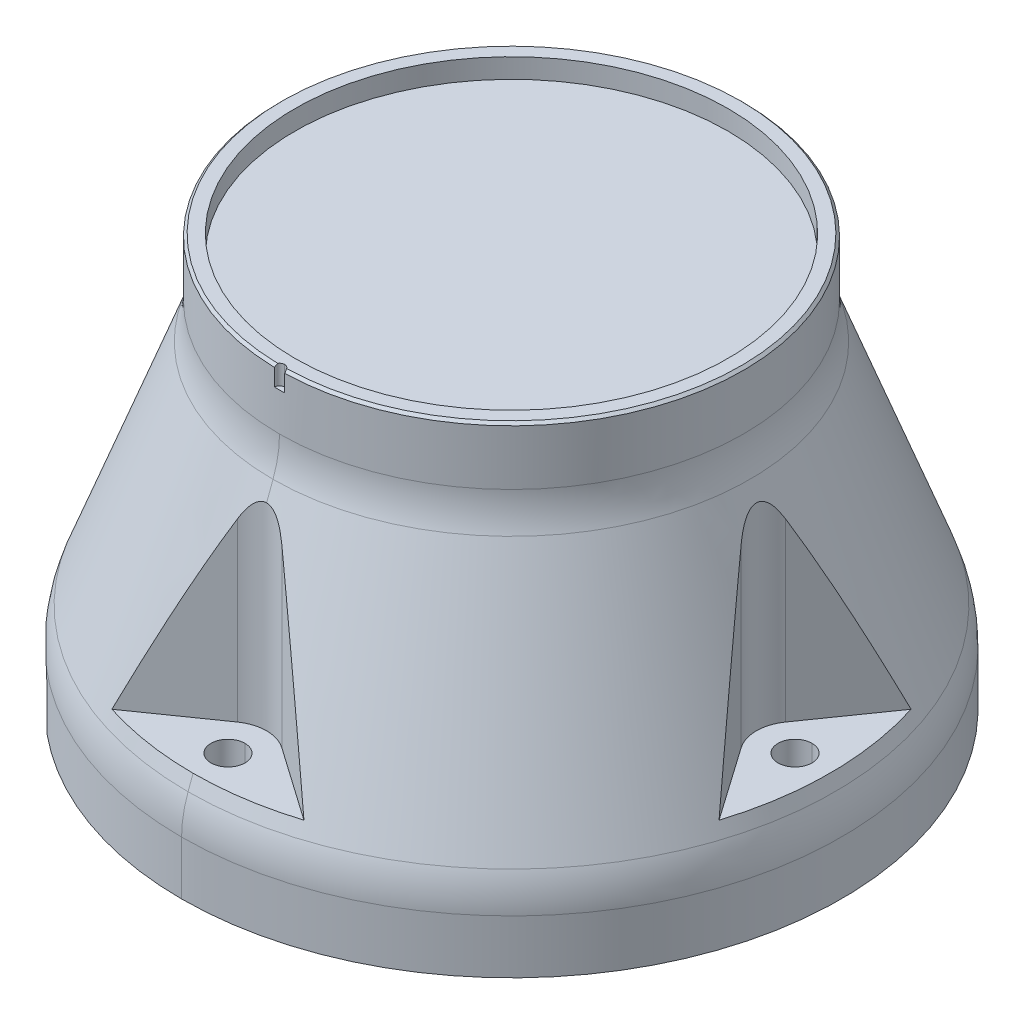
ISO-10303-21;
HEADER;
FILE_DESCRIPTION(('STEP AP214'),'2;1');
FILE_NAME('part.step','',(''),(''),'','','');
FILE_SCHEMA(('AUTOMOTIVE_DESIGN { 1 0 10303 214 1 1 1 1 }'));
ENDSEC;
DATA;
#1=APPLICATION_CONTEXT('core data for automotive mechanical design processes');
#2=APPLICATION_PROTOCOL_DEFINITION('international standard','automotive_design',2000,#1);
#3=PRODUCT_CONTEXT('',#1,'mechanical');
#4=PRODUCT('Part','Part','',(#3));
#5=PRODUCT_RELATED_PRODUCT_CATEGORY('part','',(#4));
#6=PRODUCT_DEFINITION_FORMATION('','',#4);
#7=PRODUCT_DEFINITION_CONTEXT('part definition',#1,'design');
#8=PRODUCT_DEFINITION('design','',#6,#7);
#9=PRODUCT_DEFINITION_SHAPE('','',#8);
#10=(LENGTH_UNIT() NAMED_UNIT(*) SI_UNIT(.MILLI.,.METRE.));
#11=(NAMED_UNIT(*) PLANE_ANGLE_UNIT() SI_UNIT($,.RADIAN.));
#12=(NAMED_UNIT(*) SI_UNIT($,.STERADIAN.) SOLID_ANGLE_UNIT());
#13=UNCERTAINTY_MEASURE_WITH_UNIT(LENGTH_MEASURE(1.E-05),#10,'distance_accuracy_value','');
#14=(GEOMETRIC_REPRESENTATION_CONTEXT(3) GLOBAL_UNCERTAINTY_ASSIGNED_CONTEXT((#13)) GLOBAL_UNIT_ASSIGNED_CONTEXT((#10,
#11,#12)) REPRESENTATION_CONTEXT('',''));
#15=CARTESIAN_POINT('',(0.,0.,0.));
#16=DIRECTION('',(0.,0.,1.));
#17=DIRECTION('',(1.,0.,0.));
#18=AXIS2_PLACEMENT_3D('',#15,#16,#17);
#19=CARTESIAN_POINT('',(2.50000000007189E-05,100.390423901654,0.));
#20=DIRECTION('',(0.,1.,0.));
#21=DIRECTION('',(0.,0.,-1.));
#22=AXIS2_PLACEMENT_3D('',#19,#20,#21);
#23=CYLINDRICAL_SURFACE('',#22,35.);
#24=CARTESIAN_POINT('',(2.50000000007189E-05,46.,0.));
#25=DIRECTION('',(0.,1.,0.));
#26=DIRECTION('',(0.,0.,1.));
#27=AXIS2_PLACEMENT_3D('',#24,#25,#26);
#28=CIRCLE('',#27,35.);
#29=CARTESIAN_POINT('',(2.49999997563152E-05,46.,-35.));
#30=VERTEX_POINT('',#29);
#31=CARTESIAN_POINT('',(2.50000002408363E-05,46.,35.));
#32=VERTEX_POINT('',#31);
#33=EDGE_CURVE('E1237',#30,#32,#28,.F.);
#34=ORIENTED_EDGE('',*,*,#33,.F.);
#35=DIRECTION('',(0.,1.,0.));
#36=VECTOR('',#35,1.);
#37=CARTESIAN_POINT('',(2.49999997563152E-05,100.390423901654,-35.));
#38=LINE('',#37,#36);
#39=CARTESIAN_POINT('',(2.49999997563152E-05,45.,-35.));
#40=VERTEX_POINT('',#39);
#41=EDGE_CURVE('E1219',#40,#30,#38,.T.);
#42=ORIENTED_EDGE('',*,*,#41,.F.);
#43=CARTESIAN_POINT('',(2.50000000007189E-05,45.,0.));
#44=DIRECTION('',(0.,1.,0.));
#45=DIRECTION('',(0.,0.,-1.));
#46=AXIS2_PLACEMENT_3D('',#43,#44,#45);
#47=CIRCLE('',#46,35.);
#48=CARTESIAN_POINT('',(2.50000002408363E-05,45.,35.));
#49=VERTEX_POINT('',#48);
#50=EDGE_CURVE('E1214',#49,#40,#47,.T.);
#51=ORIENTED_EDGE('',*,*,#50,.F.);
#52=DIRECTION('',(0.,1.,0.));
#53=VECTOR('',#52,1.);
#54=CARTESIAN_POINT('',(2.50000002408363E-05,100.390423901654,35.));
#55=LINE('',#54,#53);
#56=EDGE_CURVE('E974',#49,#32,#55,.T.);
#57=ORIENTED_EDGE('',*,*,#56,.T.);
#58=EDGE_LOOP('',(#34,#42,#51,#57));
#59=FACE_BOUND('',#58,.T.);
#60=ADVANCED_FACE('F42',(#59),#23,.F.);
#61=CARTESIAN_POINT('',(2.50000000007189E-05,100.390423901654,0.));
#62=DIRECTION('',(0.,1.,0.));
#63=DIRECTION('',(0.,0.,-1.));
#64=AXIS2_PLACEMENT_3D('',#61,#62,#63);
#65=CYLINDRICAL_SURFACE('',#64,35.);
#66=CARTESIAN_POINT('',(2.50000000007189E-05,46.,0.));
#67=DIRECTION('',(0.,1.,0.));
#68=DIRECTION('',(0.,0.,1.));
#69=AXIS2_PLACEMENT_3D('',#66,#67,#68);
#70=CIRCLE('',#69,35.);
#71=EDGE_CURVE('E12',#32,#30,#70,.F.);
#72=ORIENTED_EDGE('',*,*,#71,.F.);
#73=ORIENTED_EDGE('',*,*,#56,.F.);
#74=CARTESIAN_POINT('',(2.50000000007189E-05,45.,0.));
#75=DIRECTION('',(0.,1.,0.));
#76=DIRECTION('',(0.,0.,-1.));
#77=AXIS2_PLACEMENT_3D('',#74,#75,#76);
#78=CIRCLE('',#77,35.);
#79=EDGE_CURVE('E1218',#40,#49,#78,.T.);
#80=ORIENTED_EDGE('',*,*,#79,.F.);
#81=ORIENTED_EDGE('',*,*,#41,.T.);
#82=EDGE_LOOP('',(#72,#73,#80,#81));
#83=FACE_BOUND('',#82,.T.);
#84=ADVANCED_FACE('F1542',(#83),#65,.F.);
#85=CARTESIAN_POINT('',(-46.669022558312,2.5,25.455844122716));
#86=DIRECTION('',(0.,-1.,0.));
#87=DIRECTION('',(0.,0.,1.));
#88=AXIS2_PLACEMENT_3D('',#85,#86,#87);
#89=CYLINDRICAL_SURFACE('',#88,1.24999999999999);
#90=CARTESIAN_POINT('',(-46.669022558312,10.,25.455844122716));
#91=DIRECTION('',(0.,-1.,0.));
#92=DIRECTION('',(0.,0.,1.));
#93=AXIS2_PLACEMENT_3D('',#90,#91,#92);
#94=CIRCLE('',#93,1.24999999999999);
#95=CARTESIAN_POINT('',(-46.669022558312,10.,24.205844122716));
#96=VERTEX_POINT('',#95);
#97=CARTESIAN_POINT('',(-46.669022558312,10.,26.7058441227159));
#98=VERTEX_POINT('',#97);
#99=EDGE_CURVE('E68',#96,#98,#94,.T.);
#100=ORIENTED_EDGE('',*,*,#99,.F.);
#101=DIRECTION('',(0.,-1.,0.));
#102=VECTOR('',#101,1.);
#103=CARTESIAN_POINT('',(-46.669022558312,2.5,24.205844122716));
#104=LINE('',#103,#102);
#105=CARTESIAN_POINT('',(-46.669022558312,2.5,24.205844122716));
#106=VERTEX_POINT('',#105);
#107=EDGE_CURVE('E50',#96,#106,#104,.T.);
#108=ORIENTED_EDGE('',*,*,#107,.T.);
#109=CARTESIAN_POINT('',(-46.669022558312,2.5,25.455844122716));
#110=DIRECTION('',(0.,-1.,0.));
#111=DIRECTION('',(0.,0.,1.));
#112=AXIS2_PLACEMENT_3D('',#109,#110,#111);
#113=CIRCLE('',#112,1.24999999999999);
#114=CARTESIAN_POINT('',(-46.669022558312,2.5,26.7058441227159));
#115=VERTEX_POINT('',#114);
#116=EDGE_CURVE('E1223',#106,#115,#113,.T.);
#117=ORIENTED_EDGE('',*,*,#116,.T.);
#118=DIRECTION('',(0.,-1.,0.));
#119=VECTOR('',#118,1.);
#120=CARTESIAN_POINT('',(-46.669022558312,2.5,26.7058441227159));
#121=LINE('',#120,#119);
#122=EDGE_CURVE('E1211',#98,#115,#121,.T.);
#123=ORIENTED_EDGE('',*,*,#122,.F.);
#124=EDGE_LOOP('',(#100,#108,#117,#123));
#125=FACE_BOUND('',#124,.T.);
#126=ADVANCED_FACE('F1547',(#125),#89,.F.);
#127=CARTESIAN_POINT('',(-46.669022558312,10.,25.455844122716));
#128=DIRECTION('',(0.,-1.,0.));
#129=DIRECTION('',(0.,0.,1.));
#130=AXIS2_PLACEMENT_3D('',#127,#128,#129);
#131=CONICAL_SURFACE('',#130,1.24999999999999,1.02974425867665);
#132=DIRECTION('',(0.,-0.515038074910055,0.857167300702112));
#133=VECTOR('',#132,1.);
#134=CARTESIAN_POINT('',(-46.669022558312,10.,26.7058441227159));
#135=LINE('',#134,#133);
#136=CARTESIAN_POINT('',(-46.669022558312,10.7510757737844,25.455844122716));
#137=VERTEX_POINT('',#136);
#138=EDGE_CURVE('E1010',#137,#98,#135,.T.);
#139=ORIENTED_EDGE('',*,*,#138,.F.);
#140=DIRECTION('',(0.,-0.515038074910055,-0.857167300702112));
#141=VECTOR('',#140,1.);
#142=CARTESIAN_POINT('',(-46.669022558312,10.,24.205844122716));
#143=LINE('',#142,#141);
#144=EDGE_CURVE('E920',#137,#96,#143,.T.);
#145=ORIENTED_EDGE('',*,*,#144,.T.);
#146=ORIENTED_EDGE('',*,*,#99,.T.);
#147=EDGE_LOOP('',(#139,#145,#146));
#148=FACE_BOUND('',#147,.T.);
#149=ADVANCED_FACE('F652',(#148),#131,.F.);
#150=CARTESIAN_POINT('',(-25.4558191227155,2.5,46.6690475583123));
#151=DIRECTION('',(0.,-1.,0.));
#152=DIRECTION('',(0.,0.,1.));
#153=AXIS2_PLACEMENT_3D('',#150,#151,#152);
#154=CYLINDRICAL_SURFACE('',#153,1.24999999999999);
#155=CARTESIAN_POINT('',(-25.4558191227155,10.,46.6690475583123));
#156=DIRECTION('',(0.,-1.,0.));
#157=DIRECTION('',(0.,0.,1.));
#158=AXIS2_PLACEMENT_3D('',#155,#156,#157);
#159=CIRCLE('',#158,1.24999999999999);
#160=CARTESIAN_POINT('',(-25.4558191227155,10.,45.4190475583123));
#161=VERTEX_POINT('',#160);
#162=CARTESIAN_POINT('',(-25.4558191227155,10.,47.9190475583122));
#163=VERTEX_POINT('',#162);
#164=EDGE_CURVE('E866',#161,#163,#159,.T.);
#165=ORIENTED_EDGE('',*,*,#164,.F.);
#166=DIRECTION('',(0.,-1.,0.));
#167=VECTOR('',#166,1.);
#168=CARTESIAN_POINT('',(-25.4558191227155,2.5,45.4190475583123));
#169=LINE('',#168,#167);
#170=CARTESIAN_POINT('',(-25.4558191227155,2.5,45.4190475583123));
#171=VERTEX_POINT('',#170);
#172=EDGE_CURVE('E921',#161,#171,#169,.T.);
#173=ORIENTED_EDGE('',*,*,#172,.T.);
#174=CARTESIAN_POINT('',(-25.4558191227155,2.5,46.6690475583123));
#175=DIRECTION('',(0.,-1.,0.));
#176=DIRECTION('',(0.,0.,1.));
#177=AXIS2_PLACEMENT_3D('',#174,#175,#176);
#178=CIRCLE('',#177,1.24999999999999);
#179=CARTESIAN_POINT('',(-25.4558191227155,2.5,47.9190475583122));
#180=VERTEX_POINT('',#179);
#181=EDGE_CURVE('E969',#171,#180,#178,.T.);
#182=ORIENTED_EDGE('',*,*,#181,.T.);
#183=DIRECTION('',(0.,-1.,0.));
#184=VECTOR('',#183,1.);
#185=CARTESIAN_POINT('',(-25.4558191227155,2.5,47.9190475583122));
#186=LINE('',#185,#184);
#187=EDGE_CURVE('E927',#163,#180,#186,.T.);
#188=ORIENTED_EDGE('',*,*,#187,.F.);
#189=EDGE_LOOP('',(#165,#173,#182,#188));
#190=FACE_BOUND('',#189,.T.);
#191=ADVANCED_FACE('F648',(#190),#154,.F.);
#192=CARTESIAN_POINT('',(-25.4558191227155,10.,46.6690475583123));
#193=DIRECTION('',(0.,-1.,0.));
#194=DIRECTION('',(0.,0.,1.));
#195=AXIS2_PLACEMENT_3D('',#192,#193,#194);
#196=CONICAL_SURFACE('',#195,1.24999999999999,1.02974425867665);
#197=DIRECTION('',(0.,-0.515038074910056,0.857167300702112));
#198=VECTOR('',#197,1.);
#199=CARTESIAN_POINT('',(-25.4558191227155,10.,47.9190475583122));
#200=LINE('',#199,#198);
#201=CARTESIAN_POINT('',(-25.4558191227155,10.7510757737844,46.6690475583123));
#202=VERTEX_POINT('',#201);
#203=EDGE_CURVE('E926',#202,#163,#200,.T.);
#204=ORIENTED_EDGE('',*,*,#203,.F.);
#205=DIRECTION('',(0.,-0.515038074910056,-0.857167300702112));
#206=VECTOR('',#205,1.);
#207=CARTESIAN_POINT('',(-25.4558191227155,10.,45.4190475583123));
#208=LINE('',#207,#206);
#209=EDGE_CURVE('E1000',#202,#161,#208,.T.);
#210=ORIENTED_EDGE('',*,*,#209,.T.);
#211=ORIENTED_EDGE('',*,*,#164,.T.);
#212=EDGE_LOOP('',(#204,#210,#211));
#213=FACE_BOUND('',#212,.T.);
#214=ADVANCED_FACE('F651',(#213),#196,.F.);
#215=CARTESIAN_POINT('',(-44.901255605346,10.,-30.7591449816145));
#216=DIRECTION('',(0.,-1.,0.));
#217=DIRECTION('',(0.,0.,1.));
#218=AXIS2_PLACEMENT_3D('',#215,#216,#217);
#219=CYLINDRICAL_SURFACE('',#218,2.5);
#220=CARTESIAN_POINT('',(-44.901255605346,10.,-30.7591449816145));
#221=DIRECTION('',(0.,-1.,0.));
#222=DIRECTION('',(0.,0.,1.));
#223=AXIS2_PLACEMENT_3D('',#220,#221,#222);
#224=CIRCLE('',#223,2.5);
#225=CARTESIAN_POINT('',(-44.901255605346,10.,-28.2591449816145));
#226=VERTEX_POINT('',#225);
#227=CARTESIAN_POINT('',(-46.6690225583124,10.,-28.9913780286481));
#228=VERTEX_POINT('',#227);
#229=EDGE_CURVE('E1060',#226,#228,#224,.T.);
#230=ORIENTED_EDGE('',*,*,#229,.F.);
#231=DIRECTION('',(0.,-1.,0.));
#232=VECTOR('',#231,1.);
#233=CARTESIAN_POINT('',(-44.901255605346,10.,-28.2591449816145));
#234=LINE('',#233,#232);
#235=CARTESIAN_POINT('',(-44.901255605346,0.,-28.2591449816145));
#236=VERTEX_POINT('',#235);
#237=EDGE_CURVE('E889',#226,#236,#234,.T.);
#238=ORIENTED_EDGE('',*,*,#237,.T.);
#239=CARTESIAN_POINT('',(-44.901255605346,0.,-30.7591449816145));
#240=DIRECTION('',(0.,-1.,0.));
#241=DIRECTION('',(0.,0.,1.));
#242=AXIS2_PLACEMENT_3D('',#239,#240,#241);
#243=CIRCLE('',#242,2.5);
#244=CARTESIAN_POINT('',(-46.6690225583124,0.,-28.9913780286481));
#245=VERTEX_POINT('',#244);
#246=EDGE_CURVE('E885',#236,#245,#243,.T.);
#247=ORIENTED_EDGE('',*,*,#246,.T.);
#248=DIRECTION('',(0.,-1.,0.));
#249=VECTOR('',#248,1.);
#250=CARTESIAN_POINT('',(-46.6690225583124,10.,-28.9913780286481));
#251=LINE('',#250,#249);
#252=EDGE_CURVE('E989',#228,#245,#251,.T.);
#253=ORIENTED_EDGE('',*,*,#252,.F.);
#254=EDGE_LOOP('',(#230,#238,#247,#253));
#255=FACE_BOUND('',#254,.T.);
#256=ADVANCED_FACE('F646',(#255),#219,.F.);
#257=CARTESIAN_POINT('',(31.819830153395,10.,45.9619407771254));
#258=DIRECTION('',(0.,-1.,0.));
#259=DIRECTION('',(0.,0.,1.));
#260=AXIS2_PLACEMENT_3D('',#257,#258,#259);
#261=CYLINDRICAL_SURFACE('',#260,2.5);
#262=CARTESIAN_POINT('',(31.819830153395,10.,45.9619407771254));
#263=DIRECTION('',(0.,-1.,0.));
#264=DIRECTION('',(0.,0.,1.));
#265=AXIS2_PLACEMENT_3D('',#262,#263,#264);
#266=CIRCLE('',#265,2.5);
#267=CARTESIAN_POINT('',(31.819830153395,10.,43.4619407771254));
#268=VERTEX_POINT('',#267);
#269=CARTESIAN_POINT('',(31.819830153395,10.,48.4619407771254));
#270=VERTEX_POINT('',#269);
#271=EDGE_CURVE('E945',#268,#270,#266,.T.);
#272=ORIENTED_EDGE('',*,*,#271,.F.);
#273=DIRECTION('',(0.,-1.,0.));
#274=VECTOR('',#273,1.);
#275=CARTESIAN_POINT('',(31.819830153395,10.,43.4619407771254));
#276=LINE('',#275,#274);
#277=CARTESIAN_POINT('',(31.819830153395,0.,43.4619407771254));
#278=VERTEX_POINT('',#277);
#279=EDGE_CURVE('E871',#268,#278,#276,.T.);
#280=ORIENTED_EDGE('',*,*,#279,.T.);
#281=CARTESIAN_POINT('',(31.819830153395,0.,45.9619407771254));
#282=DIRECTION('',(0.,-1.,0.));
#283=DIRECTION('',(0.,0.,1.));
#284=AXIS2_PLACEMENT_3D('',#281,#282,#283);
#285=CIRCLE('',#284,2.5);
#286=CARTESIAN_POINT('',(31.819830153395,0.,48.4619407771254));
#287=VERTEX_POINT('',#286);
#288=EDGE_CURVE('E868',#278,#287,#285,.T.);
#289=ORIENTED_EDGE('',*,*,#288,.T.);
#290=DIRECTION('',(0.,-1.,0.));
#291=VECTOR('',#290,1.);
#292=CARTESIAN_POINT('',(31.819830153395,10.,48.4619407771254));
#293=LINE('',#292,#291);
#294=EDGE_CURVE('E905',#270,#287,#293,.T.);
#295=ORIENTED_EDGE('',*,*,#294,.F.);
#296=EDGE_LOOP('',(#272,#280,#289,#295));
#297=FACE_BOUND('',#296,.T.);
#298=ADVANCED_FACE('F642',(#297),#261,.F.);
#299=CARTESIAN_POINT('',(2.50000000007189E-05,10.3955165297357,0.));
#300=DIRECTION('',(0.,-1.,0.));
#301=DIRECTION('',(0.,0.,1.));
#302=AXIS2_PLACEMENT_3D('',#299,#300,#301);
#303=TOROIDAL_SURFACE('',#302,44.,20.);
#304=CARTESIAN_POINT('',(2.50000000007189E-05,17.3776969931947,0.));
#305=DIRECTION('',(0.,1.,0.));
#306=DIRECTION('',(0.,0.,-1.));
#307=AXIS2_PLACEMENT_3D('',#304,#305,#306);
#308=CIRCLE('',#307,62.741642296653);
#309=CARTESIAN_POINT('',(2.49999995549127E-05,17.3776969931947,-62.741642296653));
#310=VERTEX_POINT('',#309);
#311=CARTESIAN_POINT('',(2.50000004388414E-05,17.3776969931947,62.741642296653));
#312=VERTEX_POINT('',#311);
#313=EDGE_CURVE('E1087',#310,#312,#308,.T.);
#314=ORIENTED_EDGE('',*,*,#313,.F.);
#315=CARTESIAN_POINT('',(2.49999996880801E-05,10.3955165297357,-44.));
#316=DIRECTION('',(-1.,0.,0.));
#317=DIRECTION('',(0.,0.,1.));
#318=AXIS2_PLACEMENT_3D('',#315,#316,#317);
#319=CIRCLE('',#318,20.);
#320=CARTESIAN_POINT('',(2.49999995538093E-05,10.3955165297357,-64.));
#321=VERTEX_POINT('',#320);
#322=EDGE_CURVE('E872',#310,#321,#319,.T.);
#323=ORIENTED_EDGE('',*,*,#322,.T.);
#324=CARTESIAN_POINT('',(2.50000000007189E-05,10.3955165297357,0.));
#325=DIRECTION('',(0.,-1.,0.));
#326=DIRECTION('',(0.,0.,1.));
#327=AXIS2_PLACEMENT_3D('',#324,#325,#326);
#328=CIRCLE('',#327,64.);
#329=CARTESIAN_POINT('',(-48.6173148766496,10.3955165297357,41.6215600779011));
#330=VERTEX_POINT('',#329);
#331=EDGE_CURVE('E1105',#330,#321,#328,.T.);
#332=ORIENTED_EDGE('',*,*,#331,.F.);
#333=CARTESIAN_POINT('',(-48.6173148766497,10.3955165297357,41.6215600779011));
#334=CARTESIAN_POINT('',(-48.5949159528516,10.4455456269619,41.6477240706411));
#335=CARTESIAN_POINT('',(-48.5718717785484,10.4950656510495,41.6743098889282));
#336=CARTESIAN_POINT('',(-48.5245914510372,10.5928853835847,41.7282380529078));
#337=CARTESIAN_POINT('',(-48.5003591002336,10.6411883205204,41.7555778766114));
#338=CARTESIAN_POINT('',(-48.4507187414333,10.7365717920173,41.8110253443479));
#339=CARTESIAN_POINT('',(-48.4253133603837,10.783654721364,41.8391312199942));
#340=CARTESIAN_POINT('',(-48.3733437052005,10.876597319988,41.8961205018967));
#341=CARTESIAN_POINT('',(-48.3467809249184,10.9224584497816,41.9250028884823));
#342=CARTESIAN_POINT('',(-48.29251215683,11.0129568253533,41.9835546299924));
#343=CARTESIAN_POINT('',(-48.2648065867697,11.0575945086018,42.0132236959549));
#344=CARTESIAN_POINT('',(-48.2082672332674,11.1456458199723,42.0733576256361));
#345=CARTESIAN_POINT('',(-48.1794328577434,11.1890587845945,42.1038229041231));
#346=CARTESIAN_POINT('',(-48.1206500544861,11.2746608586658,42.1655575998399));
#347=CARTESIAN_POINT('',(-48.0907000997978,11.3168481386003,42.1968280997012));
#348=CARTESIAN_POINT('',(-48.0296995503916,11.3999993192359,42.260181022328));
#349=CARTESIAN_POINT('',(-47.9986465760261,11.4409601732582,42.2922651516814));
#350=CARTESIAN_POINT('',(-47.9353882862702,11.521741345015,42.3573186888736));
#351=CARTESIAN_POINT('',(-47.903177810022,11.5615546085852,42.3902918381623));
#352=CARTESIAN_POINT('',(-47.8378922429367,11.6396485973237,42.4568516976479));
#353=CARTESIAN_POINT('',(-47.8048200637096,11.6779335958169,42.4904362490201));
#354=CARTESIAN_POINT('',(-47.7378275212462,11.7529725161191,42.558230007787));
#355=CARTESIAN_POINT('',(-47.7039091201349,11.7897295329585,42.5924377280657));
#356=CARTESIAN_POINT('',(-47.6352394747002,11.8617143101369,42.6614882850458));
#357=CARTESIAN_POINT('',(-47.6004893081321,11.8969438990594,42.6963302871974));
#358=CARTESIAN_POINT('',(-47.5301704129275,11.9658759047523,42.7666592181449));
#359=CARTESIAN_POINT('',(-47.4946019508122,11.999578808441,42.8021459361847));
#360=CARTESIAN_POINT('',(-47.4226596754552,12.0654597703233,42.8737734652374));
#361=CARTESIAN_POINT('',(-47.3862853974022,12.0976369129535,42.9099146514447));
#362=CARTESIAN_POINT('',(-47.3127435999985,12.1604688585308,42.9828596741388));
#363=CARTESIAN_POINT('',(-47.2755749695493,12.1911212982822,43.0196644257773));
#364=CARTESIAN_POINT('',(-47.2004555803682,12.2509065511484,43.0939444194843));
#365=CARTESIAN_POINT('',(-47.1625031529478,12.2800355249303,43.1314210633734));
#366=CARTESIAN_POINT('',(-47.0858938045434,12.336726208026,43.2069853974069));
#367=CARTESIAN_POINT('',(-47.0472358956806,12.3642854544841,43.2450739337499));
#368=CARTESIAN_POINT('',(-46.9694306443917,12.4176669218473,43.3216724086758));
#369=CARTESIAN_POINT('',(-46.9302851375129,12.4434941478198,43.3601807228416));
#370=CARTESIAN_POINT('',(-46.8515166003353,12.4934146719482,43.437628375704));
#371=CARTESIAN_POINT('',(-46.811894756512,12.517511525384,43.4765666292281));
#372=CARTESIAN_POINT('',(-46.7321841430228,12.5639744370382,43.5548830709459));
#373=CARTESIAN_POINT('',(-46.6920959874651,12.5863425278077,43.594260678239));
#374=CARTESIAN_POINT('',(-46.6114621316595,12.629351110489,43.6734639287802));
#375=CARTESIAN_POINT('',(-46.570916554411,12.6499920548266,43.7132894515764));
#376=CARTESIAN_POINT('',(-46.4893760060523,12.6895495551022,43.7933958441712));
#377=CARTESIAN_POINT('',(-46.448380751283,12.7084649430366,43.833677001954));
#378=CARTESIAN_POINT('',(-46.3659477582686,12.7445744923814,43.9147012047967));
#379=CARTESIAN_POINT('',(-46.3245094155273,12.7617658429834,43.9554448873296));
#380=CARTESIAN_POINT('',(-46.2411960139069,12.7944305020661,44.0373998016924));
#381=CARTESIAN_POINT('',(-46.199320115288,12.8098993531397,44.0786119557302));
#382=CARTESIAN_POINT('',(-46.1152164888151,12.8390938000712,44.1614296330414));
#383=CARTESIAN_POINT('',(-46.0729883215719,12.852816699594,44.2030356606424));
#384=CARTESIAN_POINT('',(-45.9884097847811,12.8784242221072,44.2864289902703));
#385=CARTESIAN_POINT('',(-45.9460601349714,12.8903141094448,44.3282154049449));
#386=CARTESIAN_POINT('',(-45.8612439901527,12.9122584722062,44.4119755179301));
#387=CARTESIAN_POINT('',(-45.8187778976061,12.9223165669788,44.4539486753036));
#388=CARTESIAN_POINT('',(-45.7337329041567,12.9406000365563,44.5380874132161));
#389=CARTESIAN_POINT('',(-45.6911541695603,12.9488273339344,44.5802527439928));
#390=CARTESIAN_POINT('',(-45.6058867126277,12.9634517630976,44.6647800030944));
#391=CARTESIAN_POINT('',(-45.5631980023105,12.969849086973,44.7071419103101));
#392=CARTESIAN_POINT('',(-45.4777121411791,12.980816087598,44.792065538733));
#393=CARTESIAN_POINT('',(-45.4349149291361,12.9853842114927,44.8346273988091));
#394=CARTESIAN_POINT('',(-45.3492125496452,12.9926946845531,44.9199532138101));
#395=CARTESIAN_POINT('',(-45.3063073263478,12.9954337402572,44.9627173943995));
#396=CARTESIAN_POINT('',(-45.2203876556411,12.9990894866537,45.0484490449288));
#397=CARTESIAN_POINT('',(-45.1773732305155,13.0000011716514,45.0914167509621));
#398=CARTESIAN_POINT('',(-45.1343827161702,13.,45.1344077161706));
#399=B_SPLINE_CURVE_WITH_KNOTS('',3,(#333,#334,#335,#336,#337,#338,#339,#340,#341,#342,#343,
#344,#345,#346,#347,#348,#349,#350,#351,#352,#353,#354,#355,#356,#357,#358,#359,#360,#361,#362,
#363,#364,#365,#366,#367,#368,#369,#370,#371,#372,#373,#374,#375,#376,#377,#378,#379,#380,#381,
#382,#383,#384,#385,#386,#387,#388,#389,#390,#391,#392,#393,#394,#395,#396,#397,#398),
.UNSPECIFIED.,.F.,.F.,(4,2,2,2,2,2,2,2,2,2,2,2,2,2,2,2,2,2,2,2,2,2,2,2,2,2,2,2,2,2,2,2,4),(0.,
0.182209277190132,0.363869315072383,0.545140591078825,0.726184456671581,0.907162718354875,
1.08823721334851,1.26956938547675,1.45131986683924,1.63401728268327,1.81616179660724,
1.99791733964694,2.17944891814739,2.36092218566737,2.54250300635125,2.72435701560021,
2.90664918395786,3.08921990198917,3.27123802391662,3.4528707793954,3.63428662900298,
3.81565480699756,3.99714485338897,4.17892614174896,4.36116740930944,4.54368678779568,
4.72567179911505,4.90729323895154,5.08872304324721,5.27013379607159,5.4516982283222,
5.6335887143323,5.81597677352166),.UNSPECIFIED.);
#400=CARTESIAN_POINT('',(-45.1343827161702,13.,45.1344077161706));
#401=VERTEX_POINT('',#400);
#402=EDGE_CURVE('E1100',#330,#401,#399,.T.);
#403=ORIENTED_EDGE('',*,*,#402,.T.);
#404=CARTESIAN_POINT('',(-45.1343827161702,13.,45.1344077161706));
#405=CARTESIAN_POINT('',(-45.0914981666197,13.0000011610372,45.1772918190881));
#406=CARTESIAN_POINT('',(-45.0486367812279,12.9990938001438,45.2201997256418));
#407=CARTESIAN_POINT('',(-44.9631157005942,12.9954554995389,45.305908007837));
#408=CARTESIAN_POINT('',(-44.9204557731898,12.9927294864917,45.3487083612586));
#409=CARTESIAN_POINT('',(-44.8353363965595,12.9854538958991,45.4342026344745));
#410=CARTESIAN_POINT('',(-44.7928767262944,12.9809075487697,45.4768966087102));
#411=CARTESIAN_POINT('',(-44.7081554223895,12.9699928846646,45.5621776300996));
#412=CARTESIAN_POINT('',(-44.6658936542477,12.9636260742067,45.6047647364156));
#413=CARTESIAN_POINT('',(-44.5815646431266,12.9490714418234,45.6898306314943));
#414=CARTESIAN_POINT('',(-44.5394974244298,12.9408833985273,45.7323094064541));
#415=CARTESIAN_POINT('',(-44.4555529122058,12.9226872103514,45.8171561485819));
#416=CARTESIAN_POINT('',(-44.4136758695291,12.9126771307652,45.8595239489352));
#417=CARTESIAN_POINT('',(-44.3301060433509,12.8908375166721,45.9441452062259));
#418=CARTESIAN_POINT('',(-44.2884137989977,12.8790043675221,45.9863982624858));
#419=CARTESIAN_POINT('',(-44.2052068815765,12.8535192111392,46.0707853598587));
#420=CARTESIAN_POINT('',(-44.1636930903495,12.839861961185,46.1129186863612));
#421=CARTESIAN_POINT('',(-44.0809420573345,12.8107660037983,46.1969523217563));
#422=CARTESIAN_POINT('',(-44.0397052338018,12.7953250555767,46.2388522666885));
#423=CARTESIAN_POINT('',(-43.9576997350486,12.762713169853,46.3222154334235));
#424=CARTESIAN_POINT('',(-43.9169301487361,12.7455466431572,46.363679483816));
#425=CARTESIAN_POINT('',(-43.8358528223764,12.7094838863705,46.4461655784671));
#426=CARTESIAN_POINT('',(-43.7955444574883,12.6905904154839,46.4871882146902));
#427=CARTESIAN_POINT('',(-43.7153823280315,12.651073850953,46.5687851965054));
#428=CARTESIAN_POINT('',(-43.6755282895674,12.6304518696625,46.6093598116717));
#429=CARTESIAN_POINT('',(-43.5962666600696,12.5874783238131,46.6900534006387));
#430=CARTESIAN_POINT('',(-43.556859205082,12.5651262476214,46.7301722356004));
#431=CARTESIAN_POINT('',(-43.4784816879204,12.518692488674,46.8099458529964));
#432=CARTESIAN_POINT('',(-43.4395122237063,12.4946087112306,46.8496000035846));
#433=CARTESIAN_POINT('',(-43.3620007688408,12.4447114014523,46.9284347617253));
#434=CARTESIAN_POINT('',(-43.3234598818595,12.418894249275,46.9676141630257));
#435=CARTESIAN_POINT('',(-43.2467947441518,12.365530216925,47.0454888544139));
#436=CARTESIAN_POINT('',(-43.2086721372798,12.3379782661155,47.0841822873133));
#437=CARTESIAN_POINT('',(-43.1330959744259,12.2813414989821,47.160805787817));
#438=CARTESIAN_POINT('',(-43.0956407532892,12.252261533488,47.1987377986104));
#439=CARTESIAN_POINT('',(-43.0214011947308,12.1925745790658,47.2738194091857));
#440=CARTESIAN_POINT('',(-42.9846154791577,12.1619713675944,47.3109706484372));
#441=CARTESIAN_POINT('',(-42.9117060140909,12.0992383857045,47.3844807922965));
#442=CARTESIAN_POINT('',(-42.8755813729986,12.0671109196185,47.4208407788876));
#443=CARTESIAN_POINT('',(-42.8039844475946,12.0013297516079,47.4927575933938));
#444=CARTESIAN_POINT('',(-42.7685118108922,11.9676769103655,47.5283148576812));
#445=CARTESIAN_POINT('',(-42.6982085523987,11.8988454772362,47.5986144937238));
#446=CARTESIAN_POINT('',(-42.6633781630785,11.8636663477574,47.6333565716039));
#447=CARTESIAN_POINT('',(-42.5943483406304,11.7917829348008,47.7020131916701));
#448=CARTESIAN_POINT('',(-42.5601497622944,11.7550767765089,47.7359266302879));
#449=CARTESIAN_POINT('',(-42.4923718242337,11.6801399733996,47.8029123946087));
#450=CARTESIAN_POINT('',(-42.4587939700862,11.6419061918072,47.8359827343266));
#451=CARTESIAN_POINT('',(-42.3922449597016,11.5639151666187,47.9012678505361));
#452=CARTESIAN_POINT('',(-42.3592759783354,11.5241536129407,47.9334796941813));
#453=CARTESIAN_POINT('',(-42.2941292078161,11.4433521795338,47.9968402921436));
#454=CARTESIAN_POINT('',(-42.2619498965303,11.4023151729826,48.0279911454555));
#455=CARTESIAN_POINT('',(-42.198410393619,11.3190039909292,48.0891826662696));
#456=CARTESIAN_POINT('',(-42.1670484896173,11.2767328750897,48.1192257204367));
#457=CARTESIAN_POINT('',(-42.1051345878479,11.1909555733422,48.1781899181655));
#458=CARTESIAN_POINT('',(-42.074581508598,11.1474512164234,48.2071125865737));
#459=CARTESIAN_POINT('',(-42.0142755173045,11.0592095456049,48.2638235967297));
#460=CARTESIAN_POINT('',(-41.9845221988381,11.0144728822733,48.2916125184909));
#461=CARTESIAN_POINT('',(-41.9258053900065,10.9237689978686,48.3460429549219));
#462=CARTESIAN_POINT('',(-41.8968422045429,10.8778013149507,48.3726840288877));
#463=CARTESIAN_POINT('',(-41.8396946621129,10.7846380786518,48.4248051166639));
#464=CARTESIAN_POINT('',(-41.8115113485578,10.7374410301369,48.4502836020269));
#465=CARTESIAN_POINT('',(-41.7559122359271,10.6418218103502,48.5000648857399));
#466=CARTESIAN_POINT('',(-41.7284982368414,10.5933972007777,48.5243650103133));
#467=CARTESIAN_POINT('',(-41.6744248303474,10.4953266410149,48.5717754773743));
#468=CARTESIAN_POINT('',(-41.6477679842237,10.4456774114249,48.5948819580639));
#469=CARTESIAN_POINT('',(-41.6215350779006,10.3955165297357,48.6173398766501));
#470=B_SPLINE_CURVE_WITH_KNOTS('',3,(#404,#405,#406,#407,#408,#409,#410,#411,#412,#413,#414,
#415,#416,#417,#418,#419,#420,#421,#422,#423,#424,#425,#426,#427,#428,#429,#430,#431,#432,#433,
#434,#435,#436,#437,#438,#439,#440,#441,#442,#443,#444,#445,#446,#447,#448,#449,#450,#451,#452,
#453,#454,#455,#456,#457,#458,#459,#460,#461,#462,#463,#464,#465,#466,#467,#468,#469),
.UNSPECIFIED.,.F.,.F.,(4,2,2,2,2,2,2,2,2,2,2,2,2,2,2,2,2,2,2,2,2,2,2,2,2,2,2,2,2,2,2,2,4),(0.,
0.18193662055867,0.363382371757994,0.544507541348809,0.72548325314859,0.90648097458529,
1.08767201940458,1.26922705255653,1.45131560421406,1.63363544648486,1.81550056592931,
1.99708002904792,2.17854352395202,2.36006088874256,2.54180163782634,2.72393449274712,
2.90662692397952,3.08877081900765,3.27048357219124,3.45192986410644,3.63327502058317,
3.81468457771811,3.99632384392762,4.17835746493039,4.36094899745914,4.54315540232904,
4.7249431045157,4.90647401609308,5.08791086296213,5.26941676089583,5.45115478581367,
5.63328754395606,5.81597674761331),.UNSPECIFIED.);
#471=CARTESIAN_POINT('',(-41.6215350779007,10.3955165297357,48.6173398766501));
#472=VERTEX_POINT('',#471);
#473=EDGE_CURVE('E684',#401,#472,#470,.T.);
#474=ORIENTED_EDGE('',*,*,#473,.T.);
#475=CARTESIAN_POINT('',(2.50000000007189E-05,10.3955165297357,0.));
#476=DIRECTION('',(0.,-1.,0.));
#477=DIRECTION('',(0.,0.,1.));
#478=AXIS2_PLACEMENT_3D('',#475,#476,#477);
#479=CIRCLE('',#478,64.);
#480=CARTESIAN_POINT('',(2.50000004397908E-05,10.3955165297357,64.));
#481=VERTEX_POINT('',#480);
#482=EDGE_CURVE('E690',#481,#472,#479,.T.);
#483=ORIENTED_EDGE('',*,*,#482,.F.);
#484=CARTESIAN_POINT('',(2.50000003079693E-05,10.3955165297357,44.));
#485=DIRECTION('',(1.,0.,0.));
#486=DIRECTION('',(0.,0.,-1.));
#487=AXIS2_PLACEMENT_3D('',#484,#485,#486);
#488=CIRCLE('',#487,20.);
#489=EDGE_CURVE('E1078',#312,#481,#488,.T.);
#490=ORIENTED_EDGE('',*,*,#489,.F.);
#491=EDGE_LOOP('',(#314,#323,#332,#403,#474,#483,#490));
#492=FACE_BOUND('',#491,.T.);
#493=ADVANCED_FACE('F645',(#492),#303,.T.);
#494=CARTESIAN_POINT('',(2.49999990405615E-05,79.,-55.));
#495=DIRECTION('',(0.,-1.,0.));
#496=DIRECTION('',(0.,0.,1.));
#497=AXIS2_PLACEMENT_3D('',#494,#495,#496);
#498=CYLINDRICAL_SURFACE('',#497,7.5);
#499=CARTESIAN_POINT('',(-4.30179827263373,54.1413411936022,-48.8563596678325));
#500=CARTESIAN_POINT('',(-4.244452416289,54.2621814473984,-48.8162124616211));
#501=CARTESIAN_POINT('',(-4.18576798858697,54.3824749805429,-48.776310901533));
#502=CARTESIAN_POINT('',(-4.0678380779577,54.6169989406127,-48.6986274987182));
#503=CARTESIAN_POINT('',(-4.00870766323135,54.7312802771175,-48.6608244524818));
#504=CARTESIAN_POINT('',(-3.87864131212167,54.9750123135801,-48.5802945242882));
#505=CARTESIAN_POINT('',(-3.80724119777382,55.1042450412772,-48.537653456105));
#506=CARTESIAN_POINT('',(-3.67764749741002,55.3299677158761,-48.4632656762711));
#507=CARTESIAN_POINT('',(-3.6203612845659,55.4269216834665,-48.431344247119));
#508=CARTESIAN_POINT('',(-3.49147483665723,55.6384271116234,-48.3617919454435));
#509=CARTESIAN_POINT('',(-3.41928636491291,55.7526616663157,-48.3242821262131));
#510=CARTESIAN_POINT('',(-3.27413193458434,55.9732512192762,-48.2519517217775));
#511=CARTESIAN_POINT('',(-3.20136536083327,56.0797229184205,-48.2170879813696));
#512=CARTESIAN_POINT('',(-3.05515185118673,56.284774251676,-48.1500332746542));
#513=CARTESIAN_POINT('',(-2.98191165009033,56.3834853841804,-48.1177949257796));
#514=CARTESIAN_POINT('',(-2.83484007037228,56.5730036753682,-48.0559678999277));
#515=CARTESIAN_POINT('',(-2.76122250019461,56.6639589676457,-48.026327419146));
#516=CARTESIAN_POINT('',(-2.63817874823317,56.8088683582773,-47.9791427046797));
#517=CARTESIAN_POINT('',(-2.5900919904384,56.863848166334,-47.9612497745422));
#518=CARTESIAN_POINT('',(-2.49364967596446,56.9706277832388,-47.9265191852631));
#519=CARTESIAN_POINT('',(-2.44535033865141,57.0224732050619,-47.9096660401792));
#520=CARTESIAN_POINT('',(-2.34850654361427,57.122979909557,-47.87701416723));
#521=CARTESIAN_POINT('',(-2.30001841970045,57.1716900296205,-47.861198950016));
#522=CARTESIAN_POINT('',(-2.20281985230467,57.2659231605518,-47.8306215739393));
#523=CARTESIAN_POINT('',(-2.15416552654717,57.3114982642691,-47.8158419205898));
#524=CARTESIAN_POINT('',(-2.05665778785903,57.3994579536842,-47.7873338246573));
#525=CARTESIAN_POINT('',(-2.00785983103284,57.4418979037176,-47.7735869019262));
#526=CARTESIAN_POINT('',(-1.91008802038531,57.5235841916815,-47.7471418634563));
#527=CARTESIAN_POINT('',(-1.86116845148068,57.5628890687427,-47.7344243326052));
#528=CARTESIAN_POINT('',(-1.76317759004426,57.6383014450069,-47.7100352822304));
#529=CARTESIAN_POINT('',(-1.71415879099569,57.6744704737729,-47.6983434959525));
#530=CARTESIAN_POINT('',(-1.61599157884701,57.7436103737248,-47.6760020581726));
#531=CARTESIAN_POINT('',(-1.56689326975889,57.7766453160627,-47.6653314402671));
#532=CARTESIAN_POINT('',(-1.48594659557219,57.8284123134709,-47.6486128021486));
#533=CARTESIAN_POINT('',(-1.45458474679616,57.8478351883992,-47.6423406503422));
#534=CARTESIAN_POINT('',(-1.39179222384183,57.8854123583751,-47.6302069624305));
#535=CARTESIAN_POINT('',(-1.3603722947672,57.9035828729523,-47.6243401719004));
#536=CARTESIAN_POINT('',(-1.29747043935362,57.9386552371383,-47.6130175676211));
#537=CARTESIAN_POINT('',(-1.26599852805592,57.9555733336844,-47.6075564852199));
#538=CARTESIAN_POINT('',(-1.20299849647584,57.9881408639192,-47.5970453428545));
#539=CARTESIAN_POINT('',(-1.17147961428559,58.0038064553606,-47.5919900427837));
#540=CARTESIAN_POINT('',(-1.1083917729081,58.0338691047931,-47.5822904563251));
#541=CARTESIAN_POINT('',(-1.07683121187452,58.0482820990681,-47.577641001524));
#542=CARTESIAN_POINT('',(-1.01366611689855,58.0758398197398,-47.5687529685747));
#543=CARTESIAN_POINT('',(-0.98206909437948,58.0890001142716,-47.5645093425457));
#544=CARTESIAN_POINT('',(-0.918837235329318,58.1140528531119,-47.5564327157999));
#545=CARTESIAN_POINT('',(-0.887208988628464,58.125960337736,-47.5525948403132));
#546=CARTESIAN_POINT('',(-0.823920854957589,58.1485080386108,-47.5453293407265));
#547=CARTESIAN_POINT('',(-0.79226661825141,58.159162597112,-47.5418970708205));
#548=CARTESIAN_POINT('',(-0.728932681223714,58.1792052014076,-47.5354422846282));
#549=CARTESIAN_POINT('',(-0.697257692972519,58.1886067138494,-47.5324154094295));
#550=CARTESIAN_POINT('',(-0.633888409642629,58.2061441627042,-47.5267707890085));
#551=CARTESIAN_POINT('',(-0.602197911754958,58.2142925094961,-47.5241490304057));
#552=CARTESIAN_POINT('',(-0.538803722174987,58.2293247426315,-47.5193138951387));
#553=CARTESIAN_POINT('',(-0.507102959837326,58.2362198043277,-47.5170969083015));
#554=CARTESIAN_POINT('',(-0.443694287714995,58.2487467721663,-47.5130704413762));
#555=CARTESIAN_POINT('',(-0.411988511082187,58.2543884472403,-47.5112578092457));
#556=CARTESIAN_POINT('',(-0.348575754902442,58.2644100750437,-47.5080390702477));
#557=CARTESIAN_POINT('',(-0.316870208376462,58.2687982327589,-47.5066303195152));
#558=CARTESIAN_POINT('',(-0.253463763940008,58.2763145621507,-47.5042181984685));
#559=CARTESIAN_POINT('',(-0.221763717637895,58.2794492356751,-47.5032127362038));
#560=CARTESIAN_POINT('',(-0.158373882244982,58.2844599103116,-47.5016061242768));
#561=CARTESIAN_POINT('',(-0.126684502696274,58.2863405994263,-47.5010034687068));
#562=CARTESIAN_POINT('',(-0.0633218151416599,58.2888467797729,-47.5002006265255));
#563=CARTESIAN_POINT('',(-0.0316486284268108,58.2894750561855,-47.4999995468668));
#564=CARTESIAN_POINT('',(2.49999990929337E-05,58.2894736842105,-47.5));
#565=B_SPLINE_CURVE_WITH_KNOTS('',3,(#499,#500,#501,#502,#503,#504,#505,#506,#507,#508,#509,
#510,#511,#512,#513,#514,#515,#516,#517,#518,#519,#520,#521,#522,#523,#524,#525,#526,#527,#528,
#529,#530,#531,#532,#533,#534,#535,#536,#537,#538,#539,#540,#541,#542,#543,#544,#545,#546,#547,
#548,#549,#550,#551,#552,#553,#554,#555,#556,#557,#558,#559,#560,#561,#562,#563,#564),
.UNSPECIFIED.,.F.,.F.,(4,2,2,2,2,2,2,2,2,2,2,2,2,2,2,2,2,2,2,2,2,2,2,2,2,2,2,2,2,2,2,2,4),(0.,
0.418956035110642,0.821255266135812,1.28221668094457,1.63333323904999,2.05397469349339,
2.45465888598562,2.83577713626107,3.19778422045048,3.42335642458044,3.64182049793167,
3.85335741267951,4.05816650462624,4.25646739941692,4.44850205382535,4.63453687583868,
4.81486486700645,4.92710490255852,5.03738689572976,5.14580576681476,5.25246141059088,
5.35745875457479,5.46090777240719,5.56292344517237,5.66362566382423,5.76313906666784,
5.86159280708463,5.95912024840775,6.05585858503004,6.15194839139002,6.24753310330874,
6.34275843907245,6.43777177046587),.UNSPECIFIED.);
#566=CARTESIAN_POINT('',(-4.30179827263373,54.1413411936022,-48.8563596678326));
#567=VERTEX_POINT('',#566);
#568=CARTESIAN_POINT('',(2.499999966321E-05,58.2894736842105,-47.5));
#569=VERTEX_POINT('',#568);
#570=EDGE_CURVE('E1895',#567,#569,#565,.T.);
#571=ORIENTED_EDGE('',*,*,#570,.T.);
#572=DIRECTION('',(0.,-1.,0.));
#573=VECTOR('',#572,1.);
#574=CARTESIAN_POINT('',(2.49999990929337E-05,79.,-47.5));
#575=LINE('',#574,#573);
#576=CARTESIAN_POINT('',(2.49999990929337E-05,20.,-47.5));
#577=VERTEX_POINT('',#576);
#578=EDGE_CURVE('E1314',#569,#577,#575,.T.);
#579=ORIENTED_EDGE('',*,*,#578,.T.);
#580=CARTESIAN_POINT('',(2.49999990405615E-05,20.,-55.));
#581=DIRECTION('',(0.,-1.,0.));
#582=DIRECTION('',(-1.,0.,0.));
#583=AXIS2_PLACEMENT_3D('',#580,#581,#582);
#584=CIRCLE('',#583,7.5);
#585=CARTESIAN_POINT('',(-4.30179827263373,20.,-48.8563596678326));
#586=VERTEX_POINT('',#585);
#587=EDGE_CURVE('E1197',#577,#586,#584,.T.);
#588=ORIENTED_EDGE('',*,*,#587,.T.);
#589=DIRECTION('',(0.,-1.,0.));
#590=VECTOR('',#589,1.);
#591=CARTESIAN_POINT('',(-4.30179827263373,79.,-48.8563596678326));
#592=LINE('',#591,#590);
#593=EDGE_CURVE('E1872',#567,#586,#592,.T.);
#594=ORIENTED_EDGE('',*,*,#593,.F.);
#595=EDGE_LOOP('',(#571,#579,#588,#594));
#596=FACE_BOUND('',#595,.T.);
#597=ADVANCED_FACE('F657',(#596),#498,.F.);
#598=CARTESIAN_POINT('',(55.000025,79.,-3.84063034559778E-13));
#599=DIRECTION('',(0.,-1.,0.));
#600=DIRECTION('',(0.,0.,1.));
#601=AXIS2_PLACEMENT_3D('',#598,#599,#600);
#602=CYLINDRICAL_SURFACE('',#601,3.3);
#603=CARTESIAN_POINT('',(55.000025,20.,-3.84063034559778E-13));
#604=DIRECTION('',(0.,1.,0.));
#605=DIRECTION('',(0.,0.,1.));
#606=AXIS2_PLACEMENT_3D('',#603,#604,#605);
#607=CIRCLE('',#606,3.3);
#608=CARTESIAN_POINT('',(55.000025,20.,3.29999999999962));
#609=VERTEX_POINT('',#608);
#610=CARTESIAN_POINT('',(55.000025,20.,-3.30000000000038));
#611=VERTEX_POINT('',#610);
#612=EDGE_CURVE('E1008',#609,#611,#607,.T.);
#613=ORIENTED_EDGE('',*,*,#612,.T.);
#614=DIRECTION('',(0.,-1.,0.));
#615=VECTOR('',#614,1.);
#616=CARTESIAN_POINT('',(55.000025,79.,-3.30000000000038));
#617=LINE('',#616,#615);
#618=CARTESIAN_POINT('',(55.000025,0.,-3.30000000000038));
#619=VERTEX_POINT('',#618);
#620=EDGE_CURVE('E1004',#611,#619,#617,.T.);
#621=ORIENTED_EDGE('',*,*,#620,.T.);
#622=CARTESIAN_POINT('',(55.000025,0.,-3.84063034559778E-13));
#623=DIRECTION('',(0.,-1.,0.));
#624=DIRECTION('',(0.,0.,-1.));
#625=AXIS2_PLACEMENT_3D('',#622,#623,#624);
#626=CIRCLE('',#625,3.3);
#627=CARTESIAN_POINT('',(55.000025,0.,3.29999999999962));
#628=VERTEX_POINT('',#627);
#629=EDGE_CURVE('E1009',#619,#628,#626,.T.);
#630=ORIENTED_EDGE('',*,*,#629,.T.);
#631=DIRECTION('',(0.,-1.,0.));
#632=VECTOR('',#631,1.);
#633=CARTESIAN_POINT('',(55.000025,79.,3.29999999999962));
#634=LINE('',#633,#632);
#635=EDGE_CURVE('E1164',#609,#628,#634,.T.);
#636=ORIENTED_EDGE('',*,*,#635,.F.);
#637=EDGE_LOOP('',(#613,#621,#630,#636));
#638=FACE_BOUND('',#637,.T.);
#639=ADVANCED_FACE('F1821',(#638),#602,.F.);
#640=CARTESIAN_POINT('',(2.49999990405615E-05,79.,-55.));
#641=DIRECTION('',(0.,-1.,0.));
#642=DIRECTION('',(0.,0.,1.));
#643=AXIS2_PLACEMENT_3D('',#640,#641,#642);
#644=CYLINDRICAL_SURFACE('',#643,3.3);
#645=CARTESIAN_POINT('',(2.49999990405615E-05,20.,-55.));
#646=DIRECTION('',(0.,1.,0.));
#647=DIRECTION('',(0.,0.,1.));
#648=AXIS2_PLACEMENT_3D('',#645,#646,#647);
#649=CIRCLE('',#648,3.3);
#650=CARTESIAN_POINT('',(2.49999990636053E-05,20.,-51.7));
#651=VERTEX_POINT('',#650);
#652=CARTESIAN_POINT('',(2.49999990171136E-05,20.,-58.3));
#653=VERTEX_POINT('',#652);
#654=EDGE_CURVE('E1238',#651,#653,#649,.T.);
#655=ORIENTED_EDGE('',*,*,#654,.T.);
#656=DIRECTION('',(0.,-1.,0.));
#657=VECTOR('',#656,1.);
#658=CARTESIAN_POINT('',(2.49999990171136E-05,79.,-58.3));
#659=LINE('',#658,#657);
#660=CARTESIAN_POINT('',(2.49999990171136E-05,0.,-58.3));
#661=VERTEX_POINT('',#660);
#662=EDGE_CURVE('E1242',#653,#661,#659,.T.);
#663=ORIENTED_EDGE('',*,*,#662,.T.);
#664=CARTESIAN_POINT('',(2.49999990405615E-05,0.,-55.));
#665=DIRECTION('',(0.,-1.,0.));
#666=DIRECTION('',(-1.,0.,0.));
#667=AXIS2_PLACEMENT_3D('',#664,#665,#666);
#668=CIRCLE('',#667,3.3);
#669=CARTESIAN_POINT('',(2.49999990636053E-05,0.,-51.7));
#670=VERTEX_POINT('',#669);
#671=EDGE_CURVE('E1096',#661,#670,#668,.T.);
#672=ORIENTED_EDGE('',*,*,#671,.T.);
#673=DIRECTION('',(0.,-1.,0.));
#674=VECTOR('',#673,1.);
#675=CARTESIAN_POINT('',(2.49999990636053E-05,79.,-51.7));
#676=LINE('',#675,#674);
#677=EDGE_CURVE('E1079',#651,#670,#676,.T.);
#678=ORIENTED_EDGE('',*,*,#677,.F.);
#679=EDGE_LOOP('',(#655,#663,#672,#678));
#680=FACE_BOUND('',#679,.T.);
#681=ADVANCED_FACE('F1734',(#680),#644,.F.);
#682=CARTESIAN_POINT('',(2.50000005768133E-05,79.,55.));
#683=DIRECTION('',(0.,-1.,0.));
#684=DIRECTION('',(0.,0.,1.));
#685=AXIS2_PLACEMENT_3D('',#682,#683,#684);
#686=CYLINDRICAL_SURFACE('',#685,3.3);
#687=CARTESIAN_POINT('',(2.50000005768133E-05,20.,55.));
#688=DIRECTION('',(0.,1.,0.));
#689=DIRECTION('',(0.,0.,1.));
#690=AXIS2_PLACEMENT_3D('',#687,#688,#689);
#691=CIRCLE('',#690,3.3);
#692=CARTESIAN_POINT('',(2.50000005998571E-05,20.,58.3));
#693=VERTEX_POINT('',#692);
#694=CARTESIAN_POINT('',(2.50000005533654E-05,20.,51.7));
#695=VERTEX_POINT('',#694);
#696=EDGE_CURVE('E1092',#693,#695,#691,.T.);
#697=ORIENTED_EDGE('',*,*,#696,.T.);
#698=DIRECTION('',(0.,-1.,0.));
#699=VECTOR('',#698,1.);
#700=CARTESIAN_POINT('',(2.50000005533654E-05,79.,51.7));
#701=LINE('',#700,#699);
#702=CARTESIAN_POINT('',(2.50000005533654E-05,0.,51.7));
#703=VERTEX_POINT('',#702);
#704=EDGE_CURVE('E877',#695,#703,#701,.T.);
#705=ORIENTED_EDGE('',*,*,#704,.T.);
#706=CARTESIAN_POINT('',(2.50000005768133E-05,0.,55.));
#707=DIRECTION('',(0.,-1.,0.));
#708=DIRECTION('',(1.,0.,0.));
#709=AXIS2_PLACEMENT_3D('',#706,#707,#708);
#710=CIRCLE('',#709,3.3);
#711=CARTESIAN_POINT('',(2.50000005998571E-05,0.,58.3));
#712=VERTEX_POINT('',#711);
#713=EDGE_CURVE('E873',#703,#712,#710,.T.);
#714=ORIENTED_EDGE('',*,*,#713,.T.);
#715=DIRECTION('',(0.,-1.,0.));
#716=VECTOR('',#715,1.);
#717=CARTESIAN_POINT('',(2.50000005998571E-05,79.,58.3));
#718=LINE('',#717,#716);
#719=EDGE_CURVE('E1038',#693,#712,#718,.T.);
#720=ORIENTED_EDGE('',*,*,#719,.F.);
#721=EDGE_LOOP('',(#697,#705,#714,#720));
#722=FACE_BOUND('',#721,.T.);
#723=ADVANCED_FACE('F1731',(#722),#686,.F.);
#724=CARTESIAN_POINT('',(-54.999975,79.,3.84062859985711E-13));
#725=DIRECTION('',(0.,-1.,0.));
#726=DIRECTION('',(0.,0.,1.));
#727=AXIS2_PLACEMENT_3D('',#724,#725,#726);
#728=CYLINDRICAL_SURFACE('',#727,3.3);
#729=CARTESIAN_POINT('',(-54.999975,20.,3.84062859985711E-13));
#730=DIRECTION('',(0.,1.,0.));
#731=DIRECTION('',(0.,0.,1.));
#732=AXIS2_PLACEMENT_3D('',#729,#730,#731);
#733=CIRCLE('',#732,3.3);
#734=CARTESIAN_POINT('',(-54.999975,20.,3.30000000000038));
#735=VERTEX_POINT('',#734);
#736=CARTESIAN_POINT('',(-54.999975,20.,-3.29999999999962));
#737=VERTEX_POINT('',#736);
#738=EDGE_CURVE('E878',#735,#737,#733,.T.);
#739=ORIENTED_EDGE('',*,*,#738,.T.);
#740=DIRECTION('',(0.,-1.,0.));
#741=VECTOR('',#740,1.);
#742=CARTESIAN_POINT('',(-54.999975,79.,-3.29999999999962));
#743=LINE('',#742,#741);
#744=CARTESIAN_POINT('',(-54.999975,0.,-3.29999999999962));
#745=VERTEX_POINT('',#744);
#746=EDGE_CURVE('E1064',#737,#745,#743,.T.);
#747=ORIENTED_EDGE('',*,*,#746,.T.);
#748=CARTESIAN_POINT('',(-54.999975,0.,3.84062859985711E-13));
#749=DIRECTION('',(0.,-1.,0.));
#750=DIRECTION('',(0.,0.,1.));
#751=AXIS2_PLACEMENT_3D('',#748,#749,#750);
#752=CIRCLE('',#751,3.3);
#753=CARTESIAN_POINT('',(-54.999975,0.,3.30000000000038));
#754=VERTEX_POINT('',#753);
#755=EDGE_CURVE('E1068',#745,#754,#752,.T.);
#756=ORIENTED_EDGE('',*,*,#755,.T.);
#757=DIRECTION('',(0.,-1.,0.));
#758=VECTOR('',#757,1.);
#759=CARTESIAN_POINT('',(-54.999975,79.,3.30000000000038));
#760=LINE('',#759,#758);
#761=EDGE_CURVE('E1042',#735,#754,#760,.T.);
#762=ORIENTED_EDGE('',*,*,#761,.F.);
#763=EDGE_LOOP('',(#739,#747,#756,#762));
#764=FACE_BOUND('',#763,.T.);
#765=ADVANCED_FACE('F1675',(#764),#728,.F.);
#766=CARTESIAN_POINT('',(2.50000003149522E-05,76.,45.));
#767=DIRECTION('',(0.,1.,0.));
#768=DIRECTION('',(0.,0.,-1.));
#769=AXIS2_PLACEMENT_3D('',#766,#767,#768);
#770=CYLINDRICAL_SURFACE('',#769,1.);
#771=CARTESIAN_POINT('',(2.50000003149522E-05,76.,45.));
#772=DIRECTION('',(0.,1.,0.));
#773=DIRECTION('',(0.,0.,-1.));
#774=AXIS2_PLACEMENT_3D('',#771,#772,#773);
#775=CIRCLE('',#774,1.);
#776=CARTESIAN_POINT('',(2.50000003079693E-05,76.,44.));
#777=VERTEX_POINT('',#776);
#778=CARTESIAN_POINT('',(-0.999913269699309,76.,44.9888888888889));
#779=VERTEX_POINT('',#778);
#780=EDGE_CURVE('E1205',#777,#779,#775,.T.);
#781=ORIENTED_EDGE('',*,*,#780,.F.);
#782=DIRECTION('',(0.,1.,0.));
#783=VECTOR('',#782,1.);
#784=CARTESIAN_POINT('',(2.50000003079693E-05,76.,44.));
#785=LINE('',#784,#783);
#786=CARTESIAN_POINT('',(2.50000003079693E-05,79.8,44.));
#787=VERTEX_POINT('',#786);
#788=EDGE_CURVE('E1339',#777,#787,#785,.T.);
#789=ORIENTED_EDGE('',*,*,#788,.T.);
#790=CARTESIAN_POINT('',(2.50000003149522E-05,79.8,45.));
#791=DIRECTION('',(0.,1.,0.));
#792=DIRECTION('',(0.,0.,-1.));
#793=AXIS2_PLACEMENT_3D('',#790,#791,#792);
#794=CIRCLE('',#793,1.);
#795=CARTESIAN_POINT('',(-0.861135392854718,79.8,44.4916666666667));
#796=VERTEX_POINT('',#795);
#797=EDGE_CURVE('E507',#787,#796,#794,.T.);
#798=ORIENTED_EDGE('',*,*,#797,.T.);
#799=CARTESIAN_POINT('',(-0.861135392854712,79.8,44.4916666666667));
#800=CARTESIAN_POINT('',(-0.877426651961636,79.772075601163,44.5192806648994));
#801=CARTESIAN_POINT('',(-0.892201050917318,79.7437404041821,44.5473271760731));
#802=CARTESIAN_POINT('',(-0.918815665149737,79.6864161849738,44.6041226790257));
#803=CARTESIAN_POINT('',(-0.930656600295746,79.6574273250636,44.6328714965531));
#804=CARTESIAN_POINT('',(-0.96167122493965,79.5704624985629,44.7192022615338));
#805=CARTESIAN_POINT('',(-0.976749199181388,79.51176217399,44.777586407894));
#806=CARTESIAN_POINT('',(-0.990685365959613,79.4274325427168,44.8616296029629));
#807=CARTESIAN_POINT('',(-0.993888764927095,79.4020669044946,44.886930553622));
#808=CARTESIAN_POINT('',(-0.998364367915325,79.3511359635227,44.9377747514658));
#809=CARTESIAN_POINT('',(-0.999626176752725,79.3255703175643,44.9633185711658));
#810=CARTESIAN_POINT('',(-0.999913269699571,79.3,44.9888888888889));
#811=B_SPLINE_CURVE_WITH_KNOTS('',3,(#799,#800,#801,#802,#803,#804,#805,#806,#807,#808,#809,
#810),.UNSPECIFIED.,.F.,.F.,(4,2,2,2,2,4),(0.,0.127466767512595,0.254902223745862,
0.506497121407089,0.614368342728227,0.722815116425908),.UNSPECIFIED.);
#812=CARTESIAN_POINT('',(-0.999913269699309,79.3,44.9888888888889));
#813=VERTEX_POINT('',#812);
#814=EDGE_CURVE('E521',#796,#813,#811,.T.);
#815=ORIENTED_EDGE('',*,*,#814,.T.);
#816=DIRECTION('',(0.,-1.,0.));
#817=VECTOR('',#816,1.);
#818=CARTESIAN_POINT('',(-0.999913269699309,77.5,44.9888888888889));
#819=LINE('',#818,#817);
#820=EDGE_CURVE('E937',#813,#779,#819,.T.);
#821=ORIENTED_EDGE('',*,*,#820,.T.);
#822=EDGE_LOOP('',(#781,#789,#798,#815,#821));
#823=FACE_BOUND('',#822,.T.);
#824=ADVANCED_FACE('F1406',(#823),#770,.F.);
#825=CARTESIAN_POINT('',(2.50000000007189E-05,68.6044834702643,0.));
#826=DIRECTION('',(0.,1.,0.));
#827=DIRECTION('',(0.,0.,-1.));
#828=AXIS2_PLACEMENT_3D('',#825,#826,#827);
#829=TOROIDAL_SURFACE('',#828,65.,20.);
#830=CARTESIAN_POINT('',(2.50000000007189E-05,68.6044834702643,0.));
#831=DIRECTION('',(0.,1.,0.));
#832=DIRECTION('',(0.,0.,-1.));
#833=AXIS2_PLACEMENT_3D('',#830,#831,#832);
#834=CIRCLE('',#833,45.);
#835=CARTESIAN_POINT('',(2.50000003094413E-05,68.6044834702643,45.));
#836=VERTEX_POINT('',#835);
#837=CARTESIAN_POINT('',(2.49999996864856E-05,68.6044834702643,-45.));
#838=VERTEX_POINT('',#837);
#839=EDGE_CURVE('E949',#836,#838,#834,.T.);
#840=ORIENTED_EDGE('',*,*,#839,.F.);
#841=CARTESIAN_POINT('',(2.50000004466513E-05,68.6044834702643,65.));
#842=DIRECTION('',(-1.,0.,0.));
#843=DIRECTION('',(0.,0.,1.));
#844=AXIS2_PLACEMENT_3D('',#841,#842,#843);
#845=CIRCLE('',#844,20.);
#846=CARTESIAN_POINT('',(2.50000003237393E-05,61.6223030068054,46.258357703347));
#847=VERTEX_POINT('',#846);
#848=EDGE_CURVE('E933',#836,#847,#845,.T.);
#849=ORIENTED_EDGE('',*,*,#848,.T.);
#850=CARTESIAN_POINT('',(2.50000000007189E-05,61.6223030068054,0.));
#851=DIRECTION('',(0.,-1.,0.));
#852=DIRECTION('',(0.,0.,1.));
#853=AXIS2_PLACEMENT_3D('',#850,#851,#852);
#854=CIRCLE('',#853,46.258357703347);
#855=CARTESIAN_POINT('',(2.49999996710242E-05,61.6223030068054,-46.258357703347));
#856=VERTEX_POINT('',#855);
#857=EDGE_CURVE('E1037',#856,#847,#854,.T.);
#858=ORIENTED_EDGE('',*,*,#857,.F.);
#859=CARTESIAN_POINT('',(2.49999995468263E-05,68.6044834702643,-65.));
#860=DIRECTION('',(1.,0.,0.));
#861=DIRECTION('',(0.,0.,-1.));
#862=AXIS2_PLACEMENT_3D('',#859,#860,#861);
#863=CIRCLE('',#862,20.);
#864=EDGE_CURVE('E536',#838,#856,#863,.T.);
#865=ORIENTED_EDGE('',*,*,#864,.F.);
#866=EDGE_LOOP('',(#840,#849,#858,#865));
#867=FACE_BOUND('',#866,.T.);
#868=ADVANCED_FACE('F1674',(#867),#829,.F.);
#869=CARTESIAN_POINT('',(2.50000000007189E-05,101.190423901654,0.));
#870=DIRECTION('',(0.,1.,0.));
#871=DIRECTION('',(0.,0.,-1.));
#872=AXIS2_PLACEMENT_3D('',#869,#870,#871);
#873=CYLINDRICAL_SURFACE('',#872,42.);
#874=CARTESIAN_POINT('',(2.50000000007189E-05,76.,0.));
#875=DIRECTION('',(0.,1.,0.));
#876=DIRECTION('',(0.,0.,-1.));
#877=AXIS2_PLACEMENT_3D('',#874,#875,#876);
#878=CIRCLE('',#877,42.);
#879=CARTESIAN_POINT('',(2.50000002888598E-05,76.,42.));
#880=VERTEX_POINT('',#879);
#881=EDGE_CURVE('E1344',#880,#880,#878,.T.);
#882=ORIENTED_EDGE('',*,*,#881,.F.);
#883=DIRECTION('',(0.,1.,0.));
#884=VECTOR('',#883,1.);
#885=CARTESIAN_POINT('',(2.50000002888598E-05,101.190423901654,42.));
#886=LINE('',#885,#884);
#887=CARTESIAN_POINT('',(2.50000002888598E-05,79.8,42.));
#888=VERTEX_POINT('',#887);
#889=EDGE_CURVE('E938',#880,#888,#886,.T.);
#890=ORIENTED_EDGE('',*,*,#889,.T.);
#891=CARTESIAN_POINT('',(2.50000000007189E-05,79.8,0.));
#892=DIRECTION('',(0.,1.,0.));
#893=DIRECTION('',(0.,0.,-1.));
#894=AXIS2_PLACEMENT_3D('',#891,#892,#893);
#895=CIRCLE('',#894,42.);
#896=CARTESIAN_POINT('',(2.49999997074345E-05,79.8,-42.));
#897=VERTEX_POINT('',#896);
#898=EDGE_CURVE('E1221',#888,#897,#895,.T.);
#899=ORIENTED_EDGE('',*,*,#898,.T.);
#900=DIRECTION('',(0.,1.,0.));
#901=VECTOR('',#900,1.);
#902=CARTESIAN_POINT('',(2.49999997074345E-05,101.190423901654,-42.));
#903=LINE('',#902,#901);
#904=CARTESIAN_POINT('',(2.50000005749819E-05,78.7,-42.));
#905=VERTEX_POINT('',#904);
#906=EDGE_CURVE('E548',#905,#897,#903,.T.);
#907=ORIENTED_EDGE('',*,*,#906,.F.);
#908=ORIENTED_EDGE('',*,*,#906,.T.);
#909=CARTESIAN_POINT('',(2.50000000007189E-05,79.8,0.));
#910=DIRECTION('',(0.,1.,0.));
#911=DIRECTION('',(0.,0.,-1.));
#912=AXIS2_PLACEMENT_3D('',#909,#910,#911);
#913=CIRCLE('',#912,42.);
#914=EDGE_CURVE('E523',#897,#888,#913,.T.);
#915=ORIENTED_EDGE('',*,*,#914,.T.);
#916=ORIENTED_EDGE('',*,*,#889,.F.);
#917=EDGE_LOOP('',(#882,#890,#899,#907,#908,#915,#916));
#918=FACE_BOUND('',#917,.T.);
#919=ADVANCED_FACE('F1703',(#918),#873,.F.);
#920=CARTESIAN_POINT('',(2.50000000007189E-05,100.390423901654,0.));
#921=DIRECTION('',(0.,1.,0.));
#922=DIRECTION('',(0.,0.,-1.));
#923=AXIS2_PLACEMENT_3D('',#920,#921,#922);
#924=CYLINDRICAL_SURFACE('',#923,46.);
#925=CARTESIAN_POINT('',(2.50000000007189E-05,0.,0.));
#926=DIRECTION('',(0.,1.,0.));
#927=DIRECTION('',(0.,0.,-1.));
#928=AXIS2_PLACEMENT_3D('',#925,#926,#927);
#929=CIRCLE('',#928,46.);
#930=CARTESIAN_POINT('',(2.50000003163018E-05,0.,46.));
#931=VERTEX_POINT('',#930);
#932=CARTESIAN_POINT('',(2.49999996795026E-05,0.,-46.));
#933=VERTEX_POINT('',#932);
#934=EDGE_CURVE('E939',#931,#933,#929,.T.);
#935=ORIENTED_EDGE('',*,*,#934,.F.);
#936=DIRECTION('',(0.,1.,0.));
#937=VECTOR('',#936,1.);
#938=CARTESIAN_POINT('',(2.50000003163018E-05,100.390423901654,46.));
#939=LINE('',#938,#937);
#940=CARTESIAN_POINT('',(2.50000003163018E-05,45.,46.));
#941=VERTEX_POINT('',#940);
#942=EDGE_CURVE('E970',#931,#941,#939,.T.);
#943=ORIENTED_EDGE('',*,*,#942,.T.);
#944=CARTESIAN_POINT('',(2.50000000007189E-05,45.,0.));
#945=DIRECTION('',(0.,1.,0.));
#946=DIRECTION('',(0.,0.,-1.));
#947=AXIS2_PLACEMENT_3D('',#944,#945,#946);
#948=CIRCLE('',#947,46.);
#949=CARTESIAN_POINT('',(2.49999996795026E-05,45.,-46.));
#950=VERTEX_POINT('',#949);
#951=EDGE_CURVE('E975',#941,#950,#948,.T.);
#952=ORIENTED_EDGE('',*,*,#951,.T.);
#953=DIRECTION('',(0.,1.,0.));
#954=VECTOR('',#953,1.);
#955=CARTESIAN_POINT('',(2.49999996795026E-05,100.390423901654,-46.));
#956=LINE('',#955,#954);
#957=EDGE_CURVE('E1053',#933,#950,#956,.T.);
#958=ORIENTED_EDGE('',*,*,#957,.F.);
#959=EDGE_LOOP('',(#935,#943,#952,#958));
#960=FACE_BOUND('',#959,.T.);
#961=ADVANCED_FACE('F1499',(#960),#924,.F.);
#962=CARTESIAN_POINT('',(2.50000000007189E-05,100.390423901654,0.));
#963=DIRECTION('',(0.,1.,0.));
#964=DIRECTION('',(0.,0.,-1.));
#965=AXIS2_PLACEMENT_3D('',#962,#963,#964);
#966=CYLINDRICAL_SURFACE('',#965,64.);
#967=CARTESIAN_POINT('',(2.50000000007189E-05,0.,0.));
#968=DIRECTION('',(0.,1.,0.));
#969=DIRECTION('',(0.,0.,-1.));
#970=AXIS2_PLACEMENT_3D('',#967,#968,#969);
#971=CIRCLE('',#970,64.);
#972=CARTESIAN_POINT('',(-40.8128556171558,0.,49.2981619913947));
#973=VERTEX_POINT('',#972);
#974=CARTESIAN_POINT('',(2.50000004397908E-05,0.,64.));
#975=VERTEX_POINT('',#974);
#976=EDGE_CURVE('E911',#973,#975,#971,.T.);
#977=ORIENTED_EDGE('',*,*,#976,.T.);
#978=DIRECTION('',(0.,1.,0.));
#979=VECTOR('',#978,1.);
#980=CARTESIAN_POINT('',(2.50000004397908E-05,100.390423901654,64.));
#981=LINE('',#980,#979);
#982=EDGE_CURVE('E907',#975,#481,#981,.T.);
#983=ORIENTED_EDGE('',*,*,#982,.T.);
#984=ORIENTED_EDGE('',*,*,#482,.T.);
#985=CARTESIAN_POINT('',(-41.6215350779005,10.3955165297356,48.6173398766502));
#986=CARTESIAN_POINT('',(-41.589028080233,10.3333657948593,48.6451692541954));
#987=CARTESIAN_POINT('',(-41.557365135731,10.2704231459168,48.6722195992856));
#988=CARTESIAN_POINT('',(-41.4959354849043,10.143305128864,48.7246024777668));
#989=CARTESIAN_POINT('',(-41.4661610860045,10.0791363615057,48.7499420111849));
#990=CARTESIAN_POINT('',(-41.408517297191,9.94956617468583,48.7989144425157));
#991=CARTESIAN_POINT('',(-41.3806424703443,9.88416902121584,48.8225522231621));
#992=CARTESIAN_POINT('',(-41.3268035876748,9.75214505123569,48.8681335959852));
#993=CARTESIAN_POINT('',(-41.3008365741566,9.68552034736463,48.8900798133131));
#994=CARTESIAN_POINT('',(-41.250818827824,9.55104323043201,48.9322894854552));
#995=CARTESIAN_POINT('',(-41.2267677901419,9.48319101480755,48.9525532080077));
#996=CARTESIAN_POINT('',(-41.1805865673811,9.34626082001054,48.9914088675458));
#997=CARTESIAN_POINT('',(-41.1584588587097,9.2771813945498,49.0099986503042));
#998=CARTESIAN_POINT('',(-41.1161282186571,9.13779829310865,49.0455167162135));
#999=CARTESIAN_POINT('',(-41.0959306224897,9.0674918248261,49.0624403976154));
#1000=CARTESIAN_POINT('',(-41.05746332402,8.92565619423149,49.0946360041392));
#1001=CARTESIAN_POINT('',(-41.0392018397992,8.85412320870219,49.1099008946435));
#1002=CARTESIAN_POINT('',(-41.0046050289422,8.70981474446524,49.1387914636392));
#1003=CARTESIAN_POINT('',(-40.9882813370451,8.63703449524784,49.1524072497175));
#1004=CARTESIAN_POINT('',(-40.9578093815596,8.49104315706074,49.1778018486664));
#1005=CARTESIAN_POINT('',(-40.9436519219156,8.41783534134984,49.189588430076));
#1006=CARTESIAN_POINT('',(-40.9175142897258,8.27099064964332,49.2113327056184));
#1007=CARTESIAN_POINT('',(-40.905527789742,8.19735568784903,49.2212957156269));
#1008=CARTESIAN_POINT('',(-40.8837331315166,8.04965797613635,49.2394000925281));
#1009=CARTESIAN_POINT('',(-40.8739216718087,7.97559605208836,49.2475442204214));
#1010=CARTESIAN_POINT('',(-40.8564773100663,7.8270454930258,49.2620172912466));
#1011=CARTESIAN_POINT('',(-40.8488442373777,7.75255689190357,49.2683463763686));
#1012=CARTESIAN_POINT('',(-40.8357558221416,7.60315366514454,49.279195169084));
#1013=CARTESIAN_POINT('',(-40.8303034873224,7.52823859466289,49.2837123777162));
#1014=CARTESIAN_POINT('',(-40.8215758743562,7.37798305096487,49.2909417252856));
#1015=CARTESIAN_POINT('',(-40.8183067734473,7.30264197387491,49.293648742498));
#1016=CARTESIAN_POINT('',(-40.8139408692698,7.1515337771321,49.2972635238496));
#1017=CARTESIAN_POINT('',(-40.8128533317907,7.07576620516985,49.298163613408));
#1018=CARTESIAN_POINT('',(-40.8128556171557,6.99999999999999,49.2981619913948));
#1019=B_SPLINE_CURVE_WITH_KNOTS('',3,(#985,#986,#987,#988,#989,#990,#991,#992,#993,#994,#995,
#996,#997,#998,#999,#1000,#1001,#1002,#1003,#1004,#1005,#1006,#1007,#1008,#1009,#1010,#1011,
#1012,#1013,#1014,#1015,#1016,#1017,#1018),.UNSPECIFIED.,.F.,.F.,(4,2,2,2,2,2,2,2,2,2,2,2,2,2,2,
2,4),(0.,0.226362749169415,0.451734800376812,0.676432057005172,0.900773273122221,
1.12507872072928,1.34966882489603,1.57486279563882,1.80097728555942,2.02838722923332,
2.25480326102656,2.48054837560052,2.70594845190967,2.93133086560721,3.15702306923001,
3.38335117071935,3.61063854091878),.UNSPECIFIED.);
#1020=CARTESIAN_POINT('',(-40.8128556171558,7.,49.2981619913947));
#1021=VERTEX_POINT('',#1020);
#1022=EDGE_CURVE('E1255',#472,#1021,#1019,.T.);
#1023=ORIENTED_EDGE('',*,*,#1022,.T.);
#1024=DIRECTION('',(0.,1.,0.));
#1025=VECTOR('',#1024,1.);
#1026=CARTESIAN_POINT('',(-40.8128556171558,100.390423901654,49.2981619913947));
#1027=LINE('',#1026,#1025);
#1028=EDGE_CURVE('E717',#973,#1021,#1027,.T.);
#1029=ORIENTED_EDGE('',*,*,#1028,.F.);
#1030=EDGE_LOOP('',(#977,#983,#984,#1023,#1029));
#1031=FACE_BOUND('',#1030,.T.);
#1032=ADVANCED_FACE('F768',(#1031),#966,.T.);
#1033=CARTESIAN_POINT('',(2.50000000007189E-05,100.390423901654,0.));
#1034=DIRECTION('',(0.,1.,0.));
#1035=DIRECTION('',(0.,0.,-1.));
#1036=AXIS2_PLACEMENT_3D('',#1033,#1034,#1035);
#1037=CYLINDRICAL_SURFACE('',#1036,64.);
#1038=ORIENTED_EDGE('',*,*,#982,.F.);
#1039=CARTESIAN_POINT('',(2.50000000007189E-05,0.,0.));
#1040=DIRECTION('',(0.,1.,0.));
#1041=DIRECTION('',(0.,0.,-1.));
#1042=AXIS2_PLACEMENT_3D('',#1039,#1040,#1041);
#1043=CIRCLE('',#1042,64.);
#1044=CARTESIAN_POINT('',(2.49999995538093E-05,0.,-64.));
#1045=VERTEX_POINT('',#1044);
#1046=EDGE_CURVE('E1023',#975,#1045,#1043,.T.);
#1047=ORIENTED_EDGE('',*,*,#1046,.T.);
#1048=DIRECTION('',(0.,1.,0.));
#1049=VECTOR('',#1048,1.);
#1050=CARTESIAN_POINT('',(2.49999995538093E-05,100.390423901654,-64.));
#1051=LINE('',#1050,#1049);
#1052=EDGE_CURVE('E1019',#1045,#321,#1051,.T.);
#1053=ORIENTED_EDGE('',*,*,#1052,.T.);
#1054=CARTESIAN_POINT('',(2.50000000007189E-05,10.3955165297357,0.));
#1055=DIRECTION('',(0.,-1.,0.));
#1056=DIRECTION('',(0.,0.,1.));
#1057=AXIS2_PLACEMENT_3D('',#1054,#1055,#1056);
#1058=CIRCLE('',#1057,64.);
#1059=EDGE_CURVE('E958',#321,#481,#1058,.T.);
#1060=ORIENTED_EDGE('',*,*,#1059,.T.);
#1061=EDGE_LOOP('',(#1038,#1047,#1053,#1060));
#1062=FACE_BOUND('',#1061,.T.);
#1063=ADVANCED_FACE('F1522',(#1062),#1037,.T.);
#1064=CARTESIAN_POINT('',(2.50000000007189E-05,65.,0.));
#1065=DIRECTION('',(0.,-1.,0.));
#1066=DIRECTION('',(0.,0.,1.));
#1067=AXIS2_PLACEMENT_3D('',#1064,#1065,#1066);
#1068=CONICAL_SURFACE('',#1067,45.,0.356620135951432);
#1069=CARTESIAN_POINT('',(2.50000000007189E-05,61.6223030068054,0.));
#1070=DIRECTION('',(0.,-1.,0.));
#1071=DIRECTION('',(0.,0.,1.));
#1072=AXIS2_PLACEMENT_3D('',#1069,#1070,#1071);
#1073=CIRCLE('',#1072,46.258357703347);
#1074=EDGE_CURVE('E954',#847,#856,#1073,.T.);
#1075=ORIENTED_EDGE('',*,*,#1074,.T.);
#1076=DIRECTION('',(0.,-0.937082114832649,-0.349109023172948));
#1077=VECTOR('',#1076,1.);
#1078=CARTESIAN_POINT('',(2.49999996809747E-05,65.,-45.));
#1079=LINE('',#1078,#1077);
#1080=EDGE_CURVE('E959',#856,#569,#1079,.T.);
#1081=ORIENTED_EDGE('',*,*,#1080,.T.);
#1082=ORIENTED_EDGE('',*,*,#570,.F.);
#1083=CARTESIAN_POINT('',(-18.6289807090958,20.,-58.8883608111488));
#1084=CARTESIAN_POINT('',(-15.0030597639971,29.4330814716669,-56.3494636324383));
#1085=CARTESIAN_POINT('',(-11.7542470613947,37.2522505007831,-54.0746204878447));
#1086=CARTESIAN_POINT('',(-7.80349976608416,46.7608198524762,-51.3082774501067));
#1087=CARTESIAN_POINT('',(-4.30179827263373,54.1413411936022,-48.8563596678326));
#1088=B_SPLINE_CURVE_WITH_KNOTS('',2,(#1083,#1084,#1085,#1086,#1087),.UNSPECIFIED.,.F.,.F.,(3,2,
3),(0.,0.5,1.),.UNSPECIFIED.);
#1089=CARTESIAN_POINT('',(-18.6289807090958,20.,-58.8883608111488));
#1090=VERTEX_POINT('',#1089);
#1091=EDGE_CURVE('E1853',#1090,#567,#1088,.T.);
#1092=ORIENTED_EDGE('',*,*,#1091,.F.);
#1093=CARTESIAN_POINT('',(2.50000000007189E-05,20.,0.));
#1094=DIRECTION('',(0.,1.,0.));
#1095=DIRECTION('',(0.,0.,1.));
#1096=AXIS2_PLACEMENT_3D('',#1093,#1094,#1095);
#1097=CIRCLE('',#1096,61.7647058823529);
#1098=CARTESIAN_POINT('',(2.49999995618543E-05,20.,-61.7647058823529));
#1099=VERTEX_POINT('',#1098);
#1100=EDGE_CURVE('E1858',#1099,#1090,#1097,.T.);
#1101=ORIENTED_EDGE('',*,*,#1100,.F.);
#1102=DIRECTION('',(0.,-0.937082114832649,-0.349109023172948));
#1103=VECTOR('',#1102,1.);
#1104=CARTESIAN_POINT('',(2.49999996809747E-05,65.,-45.));
#1105=LINE('',#1104,#1103);
#1106=EDGE_CURVE('E1160',#1099,#310,#1105,.T.);
#1107=ORIENTED_EDGE('',*,*,#1106,.T.);
#1108=ORIENTED_EDGE('',*,*,#313,.T.);
#1109=DIRECTION('',(0.,-0.937082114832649,0.349109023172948));
#1110=VECTOR('',#1109,1.);
#1111=CARTESIAN_POINT('',(2.50000003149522E-05,65.,45.));
#1112=LINE('',#1111,#1110);
#1113=CARTESIAN_POINT('',(2.50000004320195E-05,20.,61.7647058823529));
#1114=VERTEX_POINT('',#1113);
#1115=EDGE_CURVE('E883',#1114,#312,#1112,.T.);
#1116=ORIENTED_EDGE('',*,*,#1115,.F.);
#1117=CARTESIAN_POINT('',(2.50000000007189E-05,20.,0.));
#1118=DIRECTION('',(0.,1.,0.));
#1119=DIRECTION('',(0.,0.,1.));
#1120=AXIS2_PLACEMENT_3D('',#1117,#1118,#1119);
#1121=CIRCLE('',#1120,61.7647058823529);
#1122=CARTESIAN_POINT('',(-18.6289807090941,20.,58.8883608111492));
#1123=VERTEX_POINT('',#1122);
#1124=EDGE_CURVE('E600',#1123,#1114,#1121,.T.);
#1125=ORIENTED_EDGE('',*,*,#1124,.F.);
#1126=CARTESIAN_POINT('',(-4.30179827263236,54.141341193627,48.8563596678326));
#1127=CARTESIAN_POINT('',(-7.80475244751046,46.7581795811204,51.3091545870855));
#1128=CARTESIAN_POINT('',(-11.7574995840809,37.244422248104,54.0768979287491));
#1129=CARTESIAN_POINT('',(-15.0046412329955,29.4289671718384,56.3505709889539));
#1130=CARTESIAN_POINT('',(-18.6289807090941,20.,58.8883608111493));
#1131=B_SPLINE_CURVE_WITH_KNOTS('',2,(#1126,#1127,#1128,#1129,#1130),.UNSPECIFIED.,.F.,.F.,(3,2,
3),(0.,0.5,1.),.UNSPECIFIED.);
#1132=CARTESIAN_POINT('',(-4.30179827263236,54.141341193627,48.8563596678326));
#1133=VERTEX_POINT('',#1132);
#1134=EDGE_CURVE('E595',#1133,#1123,#1131,.T.);
#1135=ORIENTED_EDGE('',*,*,#1134,.F.);
#1136=CARTESIAN_POINT('',(2.50000003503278E-05,58.2894736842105,47.5));
#1137=CARTESIAN_POINT('',(-0.0315318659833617,58.2894750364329,47.4999995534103));
#1138=CARTESIAN_POINT('',(-0.063088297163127,58.2888513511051,47.5001991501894));
#1139=CARTESIAN_POINT('',(-0.1262175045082,58.2863634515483,47.5009960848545));
#1140=CARTESIAN_POINT('',(-0.157790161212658,58.2844964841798,47.5015943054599));
#1141=CARTESIAN_POINT('',(-0.220946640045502,58.2795223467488,47.5031891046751));
#1142=CARTESIAN_POINT('',(-0.252530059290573,58.276410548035,47.5041871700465));
#1143=CARTESIAN_POINT('',(-0.315703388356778,58.2689490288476,47.5065815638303));
#1144=CARTESIAN_POINT('',(-0.347292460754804,58.2645928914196,47.5079799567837));
#1145=CARTESIAN_POINT('',(-0.410472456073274,58.2546443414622,47.5111750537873));
#1146=CARTESIAN_POINT('',(-0.442061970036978,58.2490438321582,47.512974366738));
#1147=CARTESIAN_POINT('',(-0.505238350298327,58.2366082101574,47.5169712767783));
#1148=CARTESIAN_POINT('',(-0.536823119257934,58.2297634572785,47.5191719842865));
#1149=CARTESIAN_POINT('',(-0.599985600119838,58.2148408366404,47.5239716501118));
#1150=CARTESIAN_POINT('',(-0.63156043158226,58.2067519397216,47.5265741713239));
#1151=CARTESIAN_POINT('',(-0.694698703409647,58.189342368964,47.5321774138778));
#1152=CARTESIAN_POINT('',(-0.72625840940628,58.1800094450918,47.5351820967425));
#1153=CARTESIAN_POINT('',(-0.789362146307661,58.1601129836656,47.5415896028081));
#1154=CARTESIAN_POINT('',(-0.82090154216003,58.1495361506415,47.5449967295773));
#1155=CARTESIAN_POINT('',(-0.883960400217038,58.1271528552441,47.5522090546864));
#1156=CARTESIAN_POINT('',(-0.915474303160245,58.1153322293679,47.5560188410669));
#1157=CARTESIAN_POINT('',(-0.978477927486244,58.0904621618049,47.5640364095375));
#1158=CARTESIAN_POINT('',(-1.00996116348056,58.0773978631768,47.568249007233));
#1159=CARTESIAN_POINT('',(-1.07289916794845,58.0500410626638,47.5770721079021));
#1160=CARTESIAN_POINT('',(-1.10434654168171,58.0357331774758,47.5816875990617));
#1161=CARTESIAN_POINT('',(-1.16720858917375,58.0058897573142,47.5913164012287));
#1162=CARTESIAN_POINT('',(-1.19861499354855,57.990338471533,47.5963348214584));
#1163=CARTESIAN_POINT('',(-1.26139049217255,57.958008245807,47.6067693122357));
#1164=CARTESIAN_POINT('',(-1.29275048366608,57.9412133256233,47.6121905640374));
#1165=CARTESIAN_POINT('',(-1.35542974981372,57.9063972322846,47.6234307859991));
#1166=CARTESIAN_POINT('',(-1.38673916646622,57.8883600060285,47.6292549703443));
#1167=CARTESIAN_POINT('',(-1.44930897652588,57.8510546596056,47.641300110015));
#1168=CARTESIAN_POINT('',(-1.48055873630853,57.8317704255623,47.6475262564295));
#1169=CARTESIAN_POINT('',(-1.56485062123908,57.7780845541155,47.6648701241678));
#1170=CARTESIAN_POINT('',(-1.61730077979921,57.7428403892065,47.6762676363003));
#1171=CARTESIAN_POINT('',(-1.72192321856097,57.6690780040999,47.700146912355));
#1172=CARTESIAN_POINT('',(-1.77404462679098,57.630494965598,47.7126503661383));
#1173=CARTESIAN_POINT('',(-1.87798755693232,57.5500427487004,47.73873120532));
#1174=CARTESIAN_POINT('',(-1.92975466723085,57.5081101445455,47.7523294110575));
#1175=CARTESIAN_POINT('',(-2.03297194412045,57.4209606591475,47.7805905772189));
#1176=CARTESIAN_POINT('',(-2.08436508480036,57.3756827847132,47.7952733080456));
#1177=CARTESIAN_POINT('',(-2.18057235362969,57.2875489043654,47.8238398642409));
#1178=CARTESIAN_POINT('',(-2.22555424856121,57.2448584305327,47.8376712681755));
#1179=CARTESIAN_POINT('',(-2.31568125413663,57.1565395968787,47.8662898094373));
#1180=CARTESIAN_POINT('',(-2.36077174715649,57.1108609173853,47.881093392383));
#1181=CARTESIAN_POINT('',(-2.45109076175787,57.0165607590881,47.9116725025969));
#1182=CARTESIAN_POINT('',(-2.49626512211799,56.9678926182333,47.9274638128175));
#1183=CARTESIAN_POINT('',(-2.58673557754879,56.8676193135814,47.9600382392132));
#1184=CARTESIAN_POINT('',(-2.63197855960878,56.8159713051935,47.976836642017));
#1185=CARTESIAN_POINT('',(-2.74766628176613,56.6801912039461,48.0210312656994));
#1186=CARTESIAN_POINT('',(-2.8169433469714,56.59516321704,48.048738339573));
#1187=CARTESIAN_POINT('',(-2.95538301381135,56.4182869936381,48.1064184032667));
#1188=CARTESIAN_POINT('',(-3.02436342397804,56.3263111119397,48.1364351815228));
#1189=CARTESIAN_POINT('',(-3.16213748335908,56.1355357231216,48.1987706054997));
#1190=CARTESIAN_POINT('',(-3.23075547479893,56.0366229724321,48.231129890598));
#1191=CARTESIAN_POINT('',(-3.36770624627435,55.831957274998,48.2981739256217));
#1192=CARTESIAN_POINT('',(-3.43586912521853,55.726103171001,48.3328959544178));
#1193=CARTESIAN_POINT('',(-3.57181528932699,55.5075442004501,48.4046883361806));
#1194=CARTESIAN_POINT('',(-3.63943490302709,55.3947490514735,48.4417929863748));
#1195=CARTESIAN_POINT('',(-3.77419496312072,55.1622966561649,48.5183695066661));
#1196=CARTESIAN_POINT('',(-3.84117777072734,55.0425585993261,48.5578728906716));
#1197=CARTESIAN_POINT('',(-3.9745664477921,54.7962143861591,48.6392613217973));
#1198=CARTESIAN_POINT('',(-4.04082069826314,54.669535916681,48.6811752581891));
#1199=CARTESIAN_POINT('',(-4.17263872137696,54.4092910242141,48.7673996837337));
#1200=CARTESIAN_POINT('',(-4.23805603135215,54.2756591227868,48.8117367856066));
#1201=CARTESIAN_POINT('',(-4.30179827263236,54.141341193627,48.8563596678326));
#1202=B_SPLINE_CURVE_WITH_KNOTS('',3,(#1136,#1137,#1138,#1139,#1140,#1141,#1142,#1143,#1144,
#1145,#1146,#1147,#1148,#1149,#1150,#1151,#1152,#1153,#1154,#1155,#1156,#1157,#1158,#1159,#1160,
#1161,#1162,#1163,#1164,#1165,#1166,#1167,#1168,#1169,#1170,#1171,#1172,#1173,#1174,#1175,#1176,
#1177,#1178,#1179,#1180,#1181,#1182,#1183,#1184,#1185,#1186,#1187,#1188,#1189,#1190,#1191,#1192,
#1193,#1194,#1195,#1196,#1197,#1198,#1199,#1200,#1201),.UNSPECIFIED.,.F.,.F.,(4,2,2,2,2,2,2,2,2,
2,2,2,2,2,2,2,2,2,2,2,2,2,2,2,2,2,2,2,2,2,2,2,4),(0.,0.0946631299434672,0.189536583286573,
0.284766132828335,0.38049592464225,0.476867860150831,0.574021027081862,0.672091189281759,
0.771210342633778,0.871506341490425,0.973102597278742,1.07611784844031,1.1806659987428,
1.28685601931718,1.39479190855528,1.50457270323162,1.6162925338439,1.80884636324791,
2.00690855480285,2.21082567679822,2.42091532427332,2.61149616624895,2.80907265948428,
3.01380581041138,3.22584032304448,3.56510469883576,3.92148938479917,4.295382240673,
4.68711912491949,5.09699203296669,5.5252558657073,5.97213405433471,6.4378232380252),.UNSPECIFIED.);
#1203=CARTESIAN_POINT('',(2.50000003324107E-05,58.2894736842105,47.5));
#1204=VERTEX_POINT('',#1203);
#1205=EDGE_CURVE('E837',#1204,#1133,#1202,.T.);
#1206=ORIENTED_EDGE('',*,*,#1205,.F.);
#1207=DIRECTION('',(0.,-0.937082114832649,0.349109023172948));
#1208=VECTOR('',#1207,1.);
#1209=CARTESIAN_POINT('',(2.50000003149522E-05,65.,45.));
#1210=LINE('',#1209,#1208);
#1211=EDGE_CURVE('E979',#847,#1204,#1210,.T.);
#1212=ORIENTED_EDGE('',*,*,#1211,.F.);
#1213=EDGE_LOOP('',(#1075,#1081,#1082,#1092,#1101,#1107,#1108,#1116,#1125,#1135,#1206,#1212));
#1214=FACE_BOUND('',#1213,.T.);
#1215=CARTESIAN_POINT('',(-48.8563346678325,54.1413411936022,4.30182327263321));
#1216=CARTESIAN_POINT('',(-48.8058968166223,54.2931616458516,4.2297668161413));
#1217=CARTESIAN_POINT('',(-48.7558218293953,54.4441141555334,4.15557778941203));
#1218=CARTESIAN_POINT('',(-48.6588240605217,54.7369859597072,4.00592532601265));
#1219=CARTESIAN_POINT('',(-48.6118620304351,54.8790020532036,3.93067634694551));
#1220=CARTESIAN_POINT('',(-48.5210735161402,55.1540116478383,3.77905507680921));
#1221=CARTESIAN_POINT('',(-48.4772040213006,55.287113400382,3.70290573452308));
#1222=CARTESIAN_POINT('',(-48.392586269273,55.5442757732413,3.54960590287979));
#1223=CARTESIAN_POINT('',(-48.351790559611,55.6684592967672,3.47268843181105));
#1224=CARTESIAN_POINT('',(-48.2732986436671,55.907771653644,3.31797568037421));
#1225=CARTESIAN_POINT('',(-48.2355502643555,56.0230399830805,3.2404235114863));
#1226=CARTESIAN_POINT('',(-48.1631281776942,56.244503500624,3.08456133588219));
#1227=CARTESIAN_POINT('',(-48.1283970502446,56.350857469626,3.00650442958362));
#1228=CARTESIAN_POINT('',(-48.0619759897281,56.554474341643,2.84974063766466));
#1229=CARTESIAN_POINT('',(-48.0302231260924,56.6519179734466,2.77129669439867));
#1230=CARTESIAN_POINT('',(-47.9785038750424,56.8107540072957,2.63671025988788));
#1231=CARTESIAN_POINT('',(-47.9581748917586,56.8732189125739,2.58197148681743));
#1232=CARTESIAN_POINT('',(-47.9188874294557,56.9940215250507,2.47214050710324));
#1233=CARTESIAN_POINT('',(-47.8999059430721,57.0524269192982,2.41713122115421));
#1234=CARTESIAN_POINT('',(-47.8633115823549,57.1651023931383,2.30679225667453));
#1235=CARTESIAN_POINT('',(-47.8456740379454,57.2194456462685,2.25154566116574));
#1236=CARTESIAN_POINT('',(-47.8117655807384,57.3239923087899,2.14076586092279));
#1237=CARTESIAN_POINT('',(-47.7954683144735,57.374274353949,2.08531516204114));
#1238=CARTESIAN_POINT('',(-47.7642377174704,57.4706920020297,1.97416246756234));
#1239=CARTESIAN_POINT('',(-47.7492764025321,57.5169117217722,1.91854146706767));
#1240=CARTESIAN_POINT('',(-47.7207129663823,57.6052023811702,1.80707907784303));
#1241=CARTESIAN_POINT('',(-47.7070814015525,57.6473624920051,1.7513162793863));
#1242=CARTESIAN_POINT('',(-47.6874805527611,57.7080108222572,1.66680274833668));
#1243=CARTESIAN_POINT('',(-47.6811693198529,57.7275431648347,1.63887653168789));
#1244=CARTESIAN_POINT('',(-47.6688811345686,57.7655801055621,1.58299304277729));
#1245=CARTESIAN_POINT('',(-47.6629002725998,57.7840966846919,1.55504480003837));
#1246=CARTESIAN_POINT('',(-47.649694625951,57.8249843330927,1.49153569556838));
#1247=CARTESIAN_POINT('',(-47.6425357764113,57.8471521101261,1.45582979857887));
#1248=CARTESIAN_POINT('',(-47.6287515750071,57.8898399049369,1.38432814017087));
#1249=CARTESIAN_POINT('',(-47.6221184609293,57.9103838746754,1.34854818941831));
#1250=CARTESIAN_POINT('',(-47.6093859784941,57.9498244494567,1.27690724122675));
#1251=CARTESIAN_POINT('',(-47.6032788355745,57.9687450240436,1.24106084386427));
#1252=CARTESIAN_POINT('',(-47.5915983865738,58.0049386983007,1.16929607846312));
#1253=CARTESIAN_POINT('',(-47.5860173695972,58.0222355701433,1.13339097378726));
#1254=CARTESIAN_POINT('',(-47.5753890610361,58.0551821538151,1.06151794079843));
#1255=CARTESIAN_POINT('',(-47.5703342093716,58.0708551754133,1.02556183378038));
#1256=CARTESIAN_POINT('',(-47.5607579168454,58.1005545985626,0.953596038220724));
#1257=CARTESIAN_POINT('',(-47.5562291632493,58.1146035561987,0.917596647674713));
#1258=CARTESIAN_POINT('',(-47.5477045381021,58.1410557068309,0.845553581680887));
#1259=CARTESIAN_POINT('',(-47.5437017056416,58.1534803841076,0.809518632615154));
#1260=CARTESIAN_POINT('',(-47.5362281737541,58.1766851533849,0.737413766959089));
#1261=CARTESIAN_POINT('',(-47.5327509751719,58.1874853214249,0.70135099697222));
#1262=CARTESIAN_POINT('',(-47.5263277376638,58.2074425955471,0.629199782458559));
#1263=CARTESIAN_POINT('',(-47.5233757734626,58.2166180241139,0.593116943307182));
#1264=CARTESIAN_POINT('',(-47.5180018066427,58.2333276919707,0.520934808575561));
#1265=CARTESIAN_POINT('',(-47.5155745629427,58.240878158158,0.484839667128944));
#1266=CARTESIAN_POINT('',(-47.5112486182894,58.254340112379,0.412642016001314));
#1267=CARTESIAN_POINT('',(-47.5093454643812,58.2602654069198,0.376542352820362));
#1268=CARTESIAN_POINT('',(-47.5060660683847,58.2704795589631,0.304344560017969));
#1269=CARTESIAN_POINT('',(-47.5046862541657,58.2747795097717,0.268248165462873));
#1270=CARTESIAN_POINT('',(-47.5024517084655,58.2817457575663,0.196065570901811));
#1271=CARTESIAN_POINT('',(-47.5015943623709,58.2844201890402,0.159980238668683));
#1272=CARTESIAN_POINT('',(-47.5004027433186,58.2881385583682,0.0878281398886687));
#1273=CARTESIAN_POINT('',(-47.5000668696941,58.2891874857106,0.0517616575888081));
#1274=CARTESIAN_POINT('',(-47.4999156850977,58.2896587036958,-0.0205101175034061));
#1275=CARTESIAN_POINT('',(-47.5001022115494,58.2890752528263,-0.0567154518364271));
#1276=CARTESIAN_POINT('',(-47.5009993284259,58.2862739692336,-0.129147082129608));
#1277=CARTESIAN_POINT('',(-47.5017112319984,58.2840520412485,-0.165373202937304));
#1278=CARTESIAN_POINT('',(-47.503659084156,58.2779772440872,-0.237839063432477));
#1279=CARTESIAN_POINT('',(-47.5048973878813,58.2741170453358,-0.274078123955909));
#1280=CARTESIAN_POINT('',(-47.5078979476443,58.2647688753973,-0.346562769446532));
#1281=CARTESIAN_POINT('',(-47.5096635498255,58.2592705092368,-0.382806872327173));
#1282=CARTESIAN_POINT('',(-47.513718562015,58.2466490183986,-0.455294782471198));
#1283=CARTESIAN_POINT('',(-47.5160122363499,58.239512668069,-0.4915360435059));
#1284=CARTESIAN_POINT('',(-47.5211232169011,58.2236179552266,-0.564011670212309));
#1285=CARTESIAN_POINT('',(-47.5239456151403,58.2148438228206,-0.600242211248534));
#1286=CARTESIAN_POINT('',(-47.5301138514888,58.1956759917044,-0.672689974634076));
#1287=CARTESIAN_POINT('',(-47.5334655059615,58.1852643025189,-0.708901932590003));
#1288=CARTESIAN_POINT('',(-47.5406920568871,58.1628234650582,-0.781306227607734));
#1289=CARTESIAN_POINT('',(-47.5445733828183,58.1507744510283,-0.817491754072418));
#1290=CARTESIAN_POINT('',(-47.552859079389,58.1250607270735,-0.889836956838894));
#1291=CARTESIAN_POINT('',(-47.5572703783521,58.1113746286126,-0.925988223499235));
#1292=CARTESIAN_POINT('',(-47.5666158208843,58.0823881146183,-0.998258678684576));
#1293=CARTESIAN_POINT('',(-47.5715572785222,58.0670651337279,-1.03436785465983));
#1294=CARTESIAN_POINT('',(-47.5819628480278,58.0348060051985,-1.1065479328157));
#1295=CARTESIAN_POINT('',(-47.5874345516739,58.0178464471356,-1.14260725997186));
#1296=CARTESIAN_POINT('',(-47.5989003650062,57.9823145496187,-1.21468114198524));
#1297=CARTESIAN_POINT('',(-47.6049022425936,57.9637182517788,-1.25068263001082));
#1298=CARTESIAN_POINT('',(-47.6174283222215,57.9249146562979,-1.32263513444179));
#1299=CARTESIAN_POINT('',(-47.623960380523,57.9046831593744,-1.35857171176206));
#1300=CARTESIAN_POINT('',(-47.6375459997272,57.8626041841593,-1.43038511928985));
#1301=CARTESIAN_POINT('',(-47.6446074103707,57.8407323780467,-1.46624619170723));
#1302=CARTESIAN_POINT('',(-47.658075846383,57.7990385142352,-1.53214947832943));
#1303=CARTESIAN_POINT('',(-47.6644338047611,57.7793651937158,-1.56229614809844));
#1304=CARTESIAN_POINT('',(-47.6775114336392,57.7389322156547,-1.62249531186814));
#1305=CARTESIAN_POINT('',(-47.68423525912,57.7181602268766,-1.65253861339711));
#1306=CARTESIAN_POINT('',(-47.6998000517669,57.6700975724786,-1.72016169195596));
#1307=CARTESIAN_POINT('',(-47.7087178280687,57.6425755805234,-1.75755954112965));
#1308=CARTESIAN_POINT('',(-47.7271096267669,57.5858339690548,-1.8321946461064));
#1309=CARTESIAN_POINT('',(-47.7365913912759,57.5565908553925,-1.86941209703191));
#1310=CARTESIAN_POINT('',(-47.7561074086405,57.4964055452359,-1.94367894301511));
#1311=CARTESIAN_POINT('',(-47.7661491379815,57.4654403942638,-1.98070775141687));
#1312=CARTESIAN_POINT('',(-47.7867814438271,57.401811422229,-2.05459032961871));
#1313=CARTESIAN_POINT('',(-47.797379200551,57.3691253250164,-2.09142288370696));
#1314=CARTESIAN_POINT('',(-47.8197501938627,57.3001028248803,-2.16703702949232));
#1315=CARTESIAN_POINT('',(-47.8315493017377,57.2636846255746,-2.2057362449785));
#1316=CARTESIAN_POINT('',(-47.8558549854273,57.1886674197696,-2.28325437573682));
#1317=CARTESIAN_POINT('',(-47.8683721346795,57.1500358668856,-2.32203840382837));
#1318=CARTESIAN_POINT('',(-47.8985717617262,57.0568677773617,-2.41312527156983));
#1319=CARTESIAN_POINT('',(-47.9164006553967,57.0018933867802,-2.46493209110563));
#1320=CARTESIAN_POINT('',(-47.9533580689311,56.88808825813,-2.56872455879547));
#1321=CARTESIAN_POINT('',(-47.9725098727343,56.8291919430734,-2.62062970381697));
#1322=CARTESIAN_POINT('',(-48.0231476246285,56.6736006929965,-2.75346520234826));
#1323=CARTESIAN_POINT('',(-48.0550483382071,56.575710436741,-2.83284091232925));
#1324=CARTESIAN_POINT('',(-48.1218220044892,56.3709962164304,-2.99146095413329));
#1325=CARTESIAN_POINT('',(-48.1567601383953,56.2639830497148,-3.07043200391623));
#1326=CARTESIAN_POINT('',(-48.22966174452,56.0410118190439,-3.22812928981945));
#1327=CARTESIAN_POINT('',(-48.2676850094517,55.9248886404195,-3.30659354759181));
#1328=CARTESIAN_POINT('',(-48.3467915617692,55.6836714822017,-3.46312746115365));
#1329=CARTESIAN_POINT('',(-48.3879290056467,55.5584324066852,-3.54094524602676));
#1330=CARTESIAN_POINT('',(-48.4732968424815,55.298964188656,-3.69603945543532));
#1331=CARTESIAN_POINT('',(-48.5175764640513,55.1646074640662,-3.77307464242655));
#1332=CARTESIAN_POINT('',(-48.609252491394,54.8868922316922,-3.92645619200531));
#1333=CARTESIAN_POINT('',(-48.6566934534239,54.7434214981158,-4.00257182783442));
#1334=CARTESIAN_POINT('',(-48.7547172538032,54.4474432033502,-4.15394039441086));
#1335=CARTESIAN_POINT('',(-48.8053407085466,54.2948354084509,-4.22897147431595));
#1336=CARTESIAN_POINT('',(-48.8563346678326,54.1413411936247,-4.30182327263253));
#1337=B_SPLINE_CURVE_WITH_KNOTS('',3,(#1215,#1216,#1217,#1218,#1219,#1220,#1221,#1222,#1223,
#1224,#1225,#1226,#1227,#1228,#1229,#1230,#1231,#1232,#1233,#1234,#1235,#1236,#1237,#1238,#1239,
#1240,#1241,#1242,#1243,#1244,#1245,#1246,#1247,#1248,#1249,#1250,#1251,#1252,#1253,#1254,#1255,
#1256,#1257,#1258,#1259,#1260,#1261,#1262,#1263,#1264,#1265,#1266,#1267,#1268,#1269,#1270,#1271,
#1272,#1273,#1274,#1275,#1276,#1277,#1278,#1279,#1280,#1281,#1282,#1283,#1284,#1285,#1286,#1287,
#1288,#1289,#1290,#1291,#1292,#1293,#1294,#1295,#1296,#1297,#1298,#1299,#1300,#1301,#1302,#1303,
#1304,#1305,#1306,#1307,#1308,#1309,#1310,#1311,#1312,#1313,#1314,#1315,#1316,#1317,#1318,#1319,
#1320,#1321,#1322,#1323,#1324,#1325,#1326,#1327,#1328,#1329,#1330,#1331,#1332,#1333,#1334,#1335,
#1336),.UNSPECIFIED.,.F.,.F.,(4,2,2,2,2,2,2,2,2,2,2,2,2,2,2,2,2,2,2,2,2,2,2,2,2,2,2,2,2,2,2,2,2,
2,2,2,2,2,2,2,2,2,2,2,2,2,2,2,2,2,2,2,2,2,2,2,2,2,2,2,4),(0.,0.526388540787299,1.02863799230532,
1.50704207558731,1.9619407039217,2.39372930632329,2.802870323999,3.18990738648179,
3.44638004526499,3.69366423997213,3.9320313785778,4.16178447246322,4.38326189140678,
4.59684134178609,4.70080741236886,4.80296092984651,4.93083374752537,5.0561718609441,
5.17911608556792,5.29981561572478,5.41842811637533,5.53511971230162,5.65006485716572,
5.76344606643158,5.87545350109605,5.98628439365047,6.09614231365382,6.20523627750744,
6.31377971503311,6.42198931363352,6.5305799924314,6.63944301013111,6.748798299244,
6.8588628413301,6.96984945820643,7.0819657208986,7.19541299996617,7.31038567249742,
7.42707049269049,7.54564612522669,7.66628283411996,7.78914231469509,7.91437765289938,
8.04213339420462,8.15178537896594,8.26318849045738,8.40500827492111,8.54980135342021,
8.69768857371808,8.84878335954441,9.01206362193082,9.18050537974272,9.41329905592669,
9.65567995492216,10.0455315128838,10.4579377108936,10.8934665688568,11.352600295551,
11.8357504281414,12.343270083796,12.8754638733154),.UNSPECIFIED.);
#1338=CARTESIAN_POINT('',(-48.8563346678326,54.1413411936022,4.30182327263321));
#1339=VERTEX_POINT('',#1338);
#1340=CARTESIAN_POINT('',(-48.8563346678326,54.1413411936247,-4.30182327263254));
#1341=VERTEX_POINT('',#1340);
#1342=EDGE_CURVE('E1769',#1339,#1341,#1337,.T.);
#1343=ORIENTED_EDGE('',*,*,#1342,.F.);
#1344=CARTESIAN_POINT('',(-58.8883358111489,20.,18.6290057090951));
#1345=CARTESIAN_POINT('',(-56.3494386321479,29.4330814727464,15.0030847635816));
#1346=CARTESIAN_POINT('',(-54.0745954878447,37.2522505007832,11.7542720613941));
#1347=CARTESIAN_POINT('',(-51.3082524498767,46.7608198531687,7.80352476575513));
#1348=CARTESIAN_POINT('',(-48.8563346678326,54.1413411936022,4.30182327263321));
#1349=B_SPLINE_CURVE_WITH_KNOTS('',2,(#1344,#1345,#1346,#1347,#1348),.UNSPECIFIED.,.F.,.F.,(3,2,
3),(0.,0.5,1.),.UNSPECIFIED.);
#1350=CARTESIAN_POINT('',(-58.888335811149,20.,18.6290057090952));
#1351=VERTEX_POINT('',#1350);
#1352=EDGE_CURVE('E785',#1351,#1339,#1349,.T.);
#1353=ORIENTED_EDGE('',*,*,#1352,.F.);
#1354=CARTESIAN_POINT('',(2.50000000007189E-05,20.,0.));
#1355=DIRECTION('',(0.,1.,0.));
#1356=DIRECTION('',(0.,0.,1.));
#1357=AXIS2_PLACEMENT_3D('',#1354,#1355,#1356);
#1358=CIRCLE('',#1357,61.7647058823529);
#1359=CARTESIAN_POINT('',(-58.8883358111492,20.,-18.6290057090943));
#1360=VERTEX_POINT('',#1359);
#1361=EDGE_CURVE('E1261',#1360,#1351,#1358,.T.);
#1362=ORIENTED_EDGE('',*,*,#1361,.F.);
#1363=CARTESIAN_POINT('',(-48.8563346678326,54.1413411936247,-4.30182327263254));
#1364=CARTESIAN_POINT('',(-51.3091295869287,46.7581795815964,-7.80477744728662));
#1365=CARTESIAN_POINT('',(-54.0768729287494,37.244422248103,-11.7575245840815));
#1366=CARTESIAN_POINT('',(-56.350545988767,29.4289671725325,-15.0046662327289));
#1367=CARTESIAN_POINT('',(-58.8883358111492,20.,-18.6290057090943));
#1368=B_SPLINE_CURVE_WITH_KNOTS('',2,(#1363,#1364,#1365,#1366,#1367),.UNSPECIFIED.,.F.,.F.,(3,2,
3),(0.,0.5,1.),.UNSPECIFIED.);
#1369=EDGE_CURVE('E1378',#1341,#1360,#1368,.T.);
#1370=ORIENTED_EDGE('',*,*,#1369,.F.);
#1371=EDGE_LOOP('',(#1343,#1353,#1362,#1370));
#1372=FACE_BOUND('',#1371,.T.);
#1373=ADVANCED_FACE('F577',(#1214,#1372),#1068,.T.);
#1374=CARTESIAN_POINT('',(2.50000000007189E-05,100.390423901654,0.));
#1375=DIRECTION('',(0.,1.,0.));
#1376=DIRECTION('',(0.,0.,-1.));
#1377=AXIS2_PLACEMENT_3D('',#1374,#1375,#1376);
#1378=CYLINDRICAL_SURFACE('',#1377,45.);
#1379=DIRECTION('',(0.,1.,0.));
#1380=VECTOR('',#1379,1.);
#1381=CARTESIAN_POINT('',(2.49999996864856E-05,100.390423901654,-45.));
#1382=LINE('',#1381,#1380);
#1383=CARTESIAN_POINT('',(2.49999996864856E-05,75.7,-45.));
#1384=VERTEX_POINT('',#1383);
#1385=EDGE_CURVE('E953',#838,#1384,#1382,.T.);
#1386=ORIENTED_EDGE('',*,*,#1385,.T.);
#1387=ORIENTED_EDGE('',*,*,#1385,.F.);
#1388=CARTESIAN_POINT('',(2.50000000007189E-05,68.6044834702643,0.));
#1389=DIRECTION('',(0.,1.,0.));
#1390=DIRECTION('',(0.,0.,-1.));
#1391=AXIS2_PLACEMENT_3D('',#1388,#1389,#1390);
#1392=CIRCLE('',#1391,45.);
#1393=EDGE_CURVE('E1031',#838,#836,#1392,.T.);
#1394=ORIENTED_EDGE('',*,*,#1393,.T.);
#1395=DIRECTION('',(0.,1.,0.));
#1396=VECTOR('',#1395,1.);
#1397=CARTESIAN_POINT('',(2.50000003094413E-05,100.390423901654,45.));
#1398=LINE('',#1397,#1396);
#1399=CARTESIAN_POINT('',(2.50000003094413E-05,76.,45.));
#1400=VERTEX_POINT('',#1399);
#1401=EDGE_CURVE('E1027',#836,#1400,#1398,.T.);
#1402=ORIENTED_EDGE('',*,*,#1401,.T.);
#1403=CARTESIAN_POINT('',(2.50000000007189E-05,76.,0.));
#1404=DIRECTION('',(0.,-1.,0.));
#1405=DIRECTION('',(0.,0.,-1.));
#1406=AXIS2_PLACEMENT_3D('',#1403,#1404,#1405);
#1407=CIRCLE('',#1406,45.);
#1408=EDGE_CURVE('E1032',#1400,#779,#1407,.T.);
#1409=ORIENTED_EDGE('',*,*,#1408,.T.);
#1410=ORIENTED_EDGE('',*,*,#820,.F.);
#1411=CARTESIAN_POINT('',(2.50000000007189E-05,79.3,0.));
#1412=DIRECTION('',(0.,-1.,0.));
#1413=DIRECTION('',(0.,0.,-1.));
#1414=AXIS2_PLACEMENT_3D('',#1411,#1412,#1413);
#1415=CIRCLE('',#1414,45.);
#1416=CARTESIAN_POINT('',(0.999963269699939,79.3,44.9888888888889));
#1417=VERTEX_POINT('',#1416);
#1418=EDGE_CURVE('E546',#813,#1417,#1415,.T.);
#1419=ORIENTED_EDGE('',*,*,#1418,.T.);
#1420=DIRECTION('',(0.,1.,0.));
#1421=VECTOR('',#1420,1.);
#1422=CARTESIAN_POINT('',(0.999963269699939,77.5,44.9888888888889));
#1423=LINE('',#1422,#1421);
#1424=CARTESIAN_POINT('',(0.999963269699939,76.,44.9888888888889));
#1425=VERTEX_POINT('',#1424);
#1426=EDGE_CURVE('E529',#1425,#1417,#1423,.T.);
#1427=ORIENTED_EDGE('',*,*,#1426,.F.);
#1428=CARTESIAN_POINT('',(2.50000000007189E-05,76.,0.));
#1429=DIRECTION('',(0.,-1.,0.));
#1430=DIRECTION('',(0.,0.,-1.));
#1431=AXIS2_PLACEMENT_3D('',#1428,#1429,#1430);
#1432=CIRCLE('',#1431,45.);
#1433=EDGE_CURVE('E1033',#1425,#1400,#1432,.T.);
#1434=ORIENTED_EDGE('',*,*,#1433,.T.);
#1435=ORIENTED_EDGE('',*,*,#1401,.F.);
#1436=ORIENTED_EDGE('',*,*,#839,.T.);
#1437=EDGE_LOOP('',(#1386,#1387,#1394,#1402,#1409,#1410,#1419,#1427,#1434,#1435,#1436));
#1438=FACE_BOUND('',#1437,.T.);
#1439=ADVANCED_FACE('F704',(#1438),#1378,.T.);
#1440=CARTESIAN_POINT('',(2.50000000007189E-05,65.,0.));
#1441=DIRECTION('',(0.,-1.,0.));
#1442=DIRECTION('',(0.,0.,1.));
#1443=AXIS2_PLACEMENT_3D('',#1440,#1441,#1442);
#1444=CONICAL_SURFACE('',#1443,45.,0.356620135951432);
#1445=ORIENTED_EDGE('',*,*,#1080,.F.);
#1446=ORIENTED_EDGE('',*,*,#857,.T.);
#1447=ORIENTED_EDGE('',*,*,#1211,.T.);
#1448=CARTESIAN_POINT('',(4.30184827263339,54.1413411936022,48.8563596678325));
#1449=CARTESIAN_POINT('',(4.24450241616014,54.2621814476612,48.8162124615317));
#1450=CARTESIAN_POINT('',(4.18581798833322,54.3824749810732,48.776310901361));
#1451=CARTESIAN_POINT('',(4.06788807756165,54.6169989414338,48.6986274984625));
#1452=CARTESIAN_POINT('',(4.00875766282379,54.7312802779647,48.660824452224));
#1453=CARTESIAN_POINT('',(3.87869131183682,54.9750123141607,48.5802945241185));
#1454=CARTESIAN_POINT('',(3.80729119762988,55.1042450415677,48.5376534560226));
#1455=CARTESIAN_POINT('',(3.67769749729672,55.3299677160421,48.4632656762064));
#1456=CARTESIAN_POINT('',(3.62041128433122,55.4269216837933,48.4313442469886));
#1457=CARTESIAN_POINT('',(3.49152483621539,55.6384271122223,48.36179194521));
#1458=CARTESIAN_POINT('',(3.41933636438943,55.7526616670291,48.324282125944));
#1459=CARTESIAN_POINT('',(3.27418193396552,55.9732512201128,48.2519517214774));
#1460=CARTESIAN_POINT('',(3.20141536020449,56.0797229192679,48.217087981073));
#1461=CARTESIAN_POINT('',(3.05520185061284,56.284774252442,48.1500332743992));
#1462=CARTESIAN_POINT('',(2.98196164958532,56.3834853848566,48.1177949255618));
#1463=CARTESIAN_POINT('',(2.83489007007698,56.5730036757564,48.0559678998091));
#1464=CARTESIAN_POINT('',(2.76127250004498,56.663958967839,48.0263274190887));
#1465=CARTESIAN_POINT('',(2.63822874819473,56.8088683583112,47.9791427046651));
#1466=CARTESIAN_POINT('',(2.59014199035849,56.8638481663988,47.9612497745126));
#1467=CARTESIAN_POINT('',(2.49369967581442,56.9706277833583,47.9265191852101));
#1468=CARTESIAN_POINT('',(2.44540033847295,57.0224732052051,47.9096660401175));
#1469=CARTESIAN_POINT('',(2.34855654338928,57.1229799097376,47.8770141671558));
#1470=CARTESIAN_POINT('',(2.30006841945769,57.1716900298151,47.8611989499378));
#1471=CARTESIAN_POINT('',(2.20286985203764,57.2659231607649,47.8306215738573));
#1472=CARTESIAN_POINT('',(2.15421552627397,57.3114982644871,47.8158419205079));
#1473=CARTESIAN_POINT('',(2.05670778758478,57.3994579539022,47.7873338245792));
#1474=CARTESIAN_POINT('',(2.00790983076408,57.4418979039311,47.7735869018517));
#1475=CARTESIAN_POINT('',(1.91013802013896,57.5235841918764,47.7471418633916));
#1476=CARTESIAN_POINT('',(1.86121845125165,57.5628890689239,47.7344243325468));
#1477=CARTESIAN_POINT('',(1.76322758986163,57.638301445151,47.7100352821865));
#1478=CARTESIAN_POINT('',(1.71420879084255,57.6744704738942,47.6983434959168));
#1479=CARTESIAN_POINT('',(1.61604157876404,57.7436103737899,47.6760020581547));
#1480=CARTESIAN_POINT('',(1.56694326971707,57.7766453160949,47.6653314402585));
#1481=CARTESIAN_POINT('',(1.48599659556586,57.8284123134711,47.6486128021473));
#1482=CARTESIAN_POINT('',(1.45463474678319,57.8478351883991,47.6423406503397));
#1483=CARTESIAN_POINT('',(1.39184222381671,57.8854123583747,47.6302069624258));
#1484=CARTESIAN_POINT('',(1.36042229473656,57.903582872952,47.6243401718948));
#1485=CARTESIAN_POINT('',(1.29752043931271,57.9386552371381,47.613017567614));
#1486=CARTESIAN_POINT('',(1.26604852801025,57.9555733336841,47.6075564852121));
#1487=CARTESIAN_POINT('',(1.20304849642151,57.9881408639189,47.5970453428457));
#1488=CARTESIAN_POINT('',(1.17152961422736,58.0038064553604,47.5919900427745));
#1489=CARTESIAN_POINT('',(1.10844177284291,58.0338691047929,47.5822904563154));
#1490=CARTESIAN_POINT('',(1.07688121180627,58.0482820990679,47.5776410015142));
#1491=CARTESIAN_POINT('',(1.01371611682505,58.0758398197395,47.5687529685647));
#1492=CARTESIAN_POINT('',(0.982119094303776,58.0890001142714,47.5645093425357));
#1493=CARTESIAN_POINT('',(0.918887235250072,58.1140528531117,47.5564327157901));
#1494=CARTESIAN_POINT('',(0.887258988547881,58.1259603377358,47.5525948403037));
#1495=CARTESIAN_POINT('',(0.823970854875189,58.1485080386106,47.5453293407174));
#1496=CARTESIAN_POINT('',(0.792316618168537,58.1591625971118,47.5418970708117));
#1497=CARTESIAN_POINT('',(0.728982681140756,58.1792052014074,47.5354422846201));
#1498=CARTESIAN_POINT('',(0.697307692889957,58.1886067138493,47.5324154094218));
#1499=CARTESIAN_POINT('',(0.633938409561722,58.2061441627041,47.5267707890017));
#1500=CARTESIAN_POINT('',(0.602247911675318,58.2142925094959,47.5241490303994));
#1501=CARTESIAN_POINT('',(0.538853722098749,58.2293247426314,47.5193138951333));
#1502=CARTESIAN_POINT('',(0.507152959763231,58.2362198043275,47.5170969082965));
#1503=CARTESIAN_POINT('',(0.443744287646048,58.2487467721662,47.5130704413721));
#1504=CARTESIAN_POINT('',(0.412038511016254,58.2543884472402,47.5112578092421));
#1505=CARTESIAN_POINT('',(0.348625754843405,58.2644100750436,47.508039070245));
#1506=CARTESIAN_POINT('',(0.316920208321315,58.2687982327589,47.5066303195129));
#1507=CARTESIAN_POINT('',(0.25351376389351,58.2763145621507,47.504218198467));
#1508=CARTESIAN_POINT('',(0.22181371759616,58.2794492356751,47.5032127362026));
#1509=CARTESIAN_POINT('',(0.158423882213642,58.2844599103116,47.5016061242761));
#1510=CARTESIAN_POINT('',(0.126734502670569,58.2863405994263,47.5010034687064));
#1511=CARTESIAN_POINT('',(0.0633718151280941,58.2888467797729,47.5002006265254));
#1512=CARTESIAN_POINT('',(0.0316986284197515,58.2894750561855,47.4999995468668));
#1513=CARTESIAN_POINT('',(2.50000003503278E-05,58.2894736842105,47.5));
#1514=B_SPLINE_CURVE_WITH_KNOTS('',3,(#1448,#1449,#1450,#1451,#1452,#1453,#1454,#1455,#1456,
#1457,#1458,#1459,#1460,#1461,#1462,#1463,#1464,#1465,#1466,#1467,#1468,#1469,#1470,#1471,#1472,
#1473,#1474,#1475,#1476,#1477,#1478,#1479,#1480,#1481,#1482,#1483,#1484,#1485,#1486,#1487,#1488,
#1489,#1490,#1491,#1492,#1493,#1494,#1495,#1496,#1497,#1498,#1499,#1500,#1501,#1502,#1503,#1504,
#1505,#1506,#1507,#1508,#1509,#1510,#1511,#1512,#1513),.UNSPECIFIED.,.F.,.F.,(4,2,2,2,2,2,2,2,2,
2,2,2,2,2,2,2,2,2,2,2,2,2,2,2,2,2,2,2,2,2,2,2,4),(0.,0.418956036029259,0.821255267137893,
1.28221668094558,1.63333323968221,2.05397469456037,2.45465888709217,2.83577713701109,
3.19778422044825,3.42335642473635,3.64182049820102,3.85335741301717,4.05816650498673,
4.25646739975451,4.44850205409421,4.63453687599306,4.81486486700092,4.92710490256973,
5.03738689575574,5.14580576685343,5.25246141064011,5.35745875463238,5.46090777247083,
5.5629234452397,5.66362566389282,5.76313906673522,5.86159280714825,5.95912024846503,
6.05585858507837,6.15194839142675,6.24753310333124,6.34275843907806,6.43777177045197),.UNSPECIFIED.);
#1515=CARTESIAN_POINT('',(4.30184827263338,54.1413411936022,48.8563596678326));
#1516=VERTEX_POINT('',#1515);
#1517=EDGE_CURVE('E807',#1516,#1204,#1514,.T.);
#1518=ORIENTED_EDGE('',*,*,#1517,.F.);
#1519=CARTESIAN_POINT('',(18.6290307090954,20.,58.8883608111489));
#1520=CARTESIAN_POINT('',(15.0031097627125,29.4330814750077,56.3494636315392));
#1521=CARTESIAN_POINT('',(11.7542970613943,37.2522505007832,54.0746204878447));
#1522=CARTESIAN_POINT('',(7.8035497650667,46.76081985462,51.3082774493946));
#1523=CARTESIAN_POINT('',(4.30184827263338,54.1413411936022,48.8563596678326));
#1524=B_SPLINE_CURVE_WITH_KNOTS('',2,(#1519,#1520,#1521,#1522,#1523),.UNSPECIFIED.,.F.,.F.,(3,2,
3),(0.,0.5,1.),.UNSPECIFIED.);
#1525=CARTESIAN_POINT('',(18.6290307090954,20.,58.8883608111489));
#1526=VERTEX_POINT('',#1525);
#1527=EDGE_CURVE('E615',#1526,#1516,#1524,.T.);
#1528=ORIENTED_EDGE('',*,*,#1527,.F.);
#1529=CARTESIAN_POINT('',(2.50000000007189E-05,20.,0.));
#1530=DIRECTION('',(0.,1.,0.));
#1531=DIRECTION('',(0.,0.,1.));
#1532=AXIS2_PLACEMENT_3D('',#1529,#1530,#1531);
#1533=CIRCLE('',#1532,61.7647058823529);
#1534=EDGE_CURVE('E609',#1114,#1526,#1533,.T.);
#1535=ORIENTED_EDGE('',*,*,#1534,.F.);
#1536=ORIENTED_EDGE('',*,*,#1115,.T.);
#1537=CARTESIAN_POINT('',(2.50000000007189E-05,17.3776969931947,0.));
#1538=DIRECTION('',(0.,1.,0.));
#1539=DIRECTION('',(0.,0.,-1.));
#1540=AXIS2_PLACEMENT_3D('',#1537,#1538,#1539);
#1541=CIRCLE('',#1540,62.741642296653);
#1542=EDGE_CURVE('E879',#312,#310,#1541,.T.);
#1543=ORIENTED_EDGE('',*,*,#1542,.T.);
#1544=ORIENTED_EDGE('',*,*,#1106,.F.);
#1545=CARTESIAN_POINT('',(2.50000000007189E-05,20.,0.));
#1546=DIRECTION('',(0.,1.,0.));
#1547=DIRECTION('',(0.,0.,1.));
#1548=AXIS2_PLACEMENT_3D('',#1545,#1546,#1547);
#1549=CIRCLE('',#1548,61.7647058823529);
#1550=CARTESIAN_POINT('',(18.6290307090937,20.,-58.8883608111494));
#1551=VERTEX_POINT('',#1550);
#1552=EDGE_CURVE('E1866',#1551,#1099,#1549,.T.);
#1553=ORIENTED_EDGE('',*,*,#1552,.F.);
#1554=CARTESIAN_POINT('',(4.30184827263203,54.1413411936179,-48.8563596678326));
#1555=CARTESIAN_POINT('',(7.80480244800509,46.7581795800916,-51.3091545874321));
#1556=CARTESIAN_POINT('',(11.7575495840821,37.2444222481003,-54.0768979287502));
#1557=CARTESIAN_POINT('',(15.0046912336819,29.4289671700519,-56.3505709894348));
#1558=CARTESIAN_POINT('',(18.6290307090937,20.,-58.8883608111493));
#1559=B_SPLINE_CURVE_WITH_KNOTS('',2,(#1554,#1555,#1556,#1557,#1558),.UNSPECIFIED.,.F.,.F.,(3,2,
3),(0.,0.5,1.),.UNSPECIFIED.);
#1560=CARTESIAN_POINT('',(4.30184827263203,54.141341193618,-48.8563596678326));
#1561=VERTEX_POINT('',#1560);
#1562=EDGE_CURVE('E900',#1561,#1551,#1559,.T.);
#1563=ORIENTED_EDGE('',*,*,#1562,.F.);
#1564=CARTESIAN_POINT('',(2.4999999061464E-05,58.2894736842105,-47.5));
#1565=CARTESIAN_POINT('',(0.0315818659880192,58.2894750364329,-47.4999995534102));
#1566=CARTESIAN_POINT('',(0.0631382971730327,58.2888513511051,-47.5001991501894));
#1567=CARTESIAN_POINT('',(0.126267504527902,58.2863634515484,-47.5009960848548));
#1568=CARTESIAN_POINT('',(0.157840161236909,58.2844964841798,-47.5015943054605));
#1569=CARTESIAN_POINT('',(0.220996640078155,58.2795223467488,-47.5031891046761));
#1570=CARTESIAN_POINT('',(0.252580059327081,58.276410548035,-47.5041871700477));
#1571=CARTESIAN_POINT('',(0.315753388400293,58.2689490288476,-47.5065815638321));
#1572=CARTESIAN_POINT('',(0.347342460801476,58.2645928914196,-47.5079799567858));
#1573=CARTESIAN_POINT('',(0.410522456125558,58.2546443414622,-47.5111750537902));
#1574=CARTESIAN_POINT('',(0.442111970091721,58.2490438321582,-47.5129743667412));
#1575=CARTESIAN_POINT('',(0.505288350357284,58.2366082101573,-47.5169712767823));
#1576=CARTESIAN_POINT('',(0.53687311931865,58.2297634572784,-47.5191719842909));
#1577=CARTESIAN_POINT('',(0.600035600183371,58.2148408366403,-47.5239716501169));
#1578=CARTESIAN_POINT('',(0.631610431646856,58.2067519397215,-47.5265741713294));
#1579=CARTESIAN_POINT('',(0.69474870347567,58.1893423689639,-47.532177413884));
#1580=CARTESIAN_POINT('',(0.726308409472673,58.1800094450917,-47.535182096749));
#1581=CARTESIAN_POINT('',(0.789412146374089,58.1601129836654,-47.5415896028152));
#1582=CARTESIAN_POINT('',(0.820951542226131,58.1495361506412,-47.5449967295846));
#1583=CARTESIAN_POINT('',(0.884010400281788,58.1271528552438,-47.5522090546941));
#1584=CARTESIAN_POINT('',(0.915524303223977,58.1153322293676,-47.5560188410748));
#1585=CARTESIAN_POINT('',(0.978527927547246,58.0904621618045,-47.5640364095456));
#1586=CARTESIAN_POINT('',(1.01001116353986,58.0773978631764,-47.5682490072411));
#1587=CARTESIAN_POINT('',(1.07294916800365,58.0500410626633,-47.5770721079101));
#1588=CARTESIAN_POINT('',(1.10439654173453,58.0357331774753,-47.5816875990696));
#1589=CARTESIAN_POINT('',(1.16725858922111,58.0058897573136,-47.5913164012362));
#1590=CARTESIAN_POINT('',(1.19866499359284,57.9903384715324,-47.5963348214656));
#1591=CARTESIAN_POINT('',(1.26144049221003,57.9580082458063,-47.6067693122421));
#1592=CARTESIAN_POINT('',(1.29280048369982,57.9412133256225,-47.6121905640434));
#1593=CARTESIAN_POINT('',(1.35547974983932,57.9063972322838,-47.6234307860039));
#1594=CARTESIAN_POINT('',(1.38678916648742,57.8883600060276,-47.6292549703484));
#1595=CARTESIAN_POINT('',(1.44935897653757,57.8510546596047,-47.6413001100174));
#1596=CARTESIAN_POINT('',(1.48060873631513,57.8317704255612,-47.647526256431));
#1597=CARTESIAN_POINT('',(1.56490062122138,57.7780845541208,-47.6648701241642));
#1598=CARTESIAN_POINT('',(1.61735077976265,57.742840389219,-47.6762676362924));
#1599=CARTESIAN_POINT('',(1.72197321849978,57.6690780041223,-47.7001469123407));
#1600=CARTESIAN_POINT('',(1.77409462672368,57.6304949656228,-47.712650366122));
#1601=CARTESIAN_POINT('',(1.87803755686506,57.5500427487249,-47.7387312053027));
#1602=CARTESIAN_POINT('',(1.9298046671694,57.5081101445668,-47.7523294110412));
#1603=CARTESIAN_POINT('',(2.03302194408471,57.4209606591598,-47.7805905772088));
#1604=CARTESIAN_POINT('',(2.08441508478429,57.3756827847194,-47.7952733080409));
#1605=CARTESIAN_POINT('',(2.18062235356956,57.2875489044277,-47.8238398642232));
#1606=CARTESIAN_POINT('',(2.22560424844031,57.2448584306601,-47.8376712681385));
#1607=CARTESIAN_POINT('',(2.31573125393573,57.1565395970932,-47.8662898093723));
#1608=CARTESIAN_POINT('',(2.36082174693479,57.1108609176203,-47.8810933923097));
#1609=CARTESIAN_POINT('',(2.45114076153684,57.0165607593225,-47.9116725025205));
#1610=CARTESIAN_POINT('',(2.49631512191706,56.9678926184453,-47.9274638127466));
#1611=CARTESIAN_POINT('',(2.5867855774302,56.8676193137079,-47.9600382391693));
#1612=CARTESIAN_POINT('',(2.63202855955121,56.8159713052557,-47.9768366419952));
#1613=CARTESIAN_POINT('',(2.74771628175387,56.6801912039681,-48.0210312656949));
#1614=CARTESIAN_POINT('',(2.81699334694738,56.5951632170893,-48.0487383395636));
#1615=CARTESIAN_POINT('',(2.95543301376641,56.4182869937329,-48.1064184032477));
#1616=CARTESIAN_POINT('',(3.02441342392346,56.3263111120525,-48.136435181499));
#1617=CARTESIAN_POINT('',(3.16218748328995,56.1355357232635,-48.1987706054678));
#1618=CARTESIAN_POINT('',(3.23080547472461,56.0366229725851,-48.2311298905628));
#1619=CARTESIAN_POINT('',(3.36775624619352,55.8319572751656,-48.2981739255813));
#1620=CARTESIAN_POINT('',(3.4359191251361,55.7261031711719,-48.3328959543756));
#1621=CARTESIAN_POINT('',(3.57186528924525,55.5075442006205,-48.4046883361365));
#1622=CARTESIAN_POINT('',(3.63948490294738,55.3947490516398,-48.4417929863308));
#1623=CARTESIAN_POINT('',(3.7742449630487,55.1622966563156,-48.5183695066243));
#1624=CARTESIAN_POINT('',(3.84122777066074,55.0425585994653,-48.557872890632));
#1625=CARTESIAN_POINT('',(3.97461644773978,54.7962143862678,-48.6392613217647));
#1626=CARTESIAN_POINT('',(4.04087069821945,54.6695359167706,-48.6811752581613));
#1627=CARTESIAN_POINT('',(4.17268872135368,54.4092910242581,-48.7673996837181));
#1628=CARTESIAN_POINT('',(4.23810603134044,54.2756591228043,-48.8117367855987));
#1629=CARTESIAN_POINT('',(4.301848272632,54.1413411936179,-48.8563596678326));
#1630=B_SPLINE_CURVE_WITH_KNOTS('',3,(#1564,#1565,#1566,#1567,#1568,#1569,#1570,#1571,#1572,
#1573,#1574,#1575,#1576,#1577,#1578,#1579,#1580,#1581,#1582,#1583,#1584,#1585,#1586,#1587,#1588,
#1589,#1590,#1591,#1592,#1593,#1594,#1595,#1596,#1597,#1598,#1599,#1600,#1601,#1602,#1603,#1604,
#1605,#1606,#1607,#1608,#1609,#1610,#1611,#1612,#1613,#1614,#1615,#1616,#1617,#1618,#1619,#1620,
#1621,#1622,#1623,#1624,#1625,#1626,#1627,#1628,#1629),.UNSPECIFIED.,.F.,.F.,(4,2,2,2,2,2,2,2,2,
2,2,2,2,2,2,2,2,2,2,2,2,2,2,2,2,2,2,2,2,2,2,2,4),(0.,0.0946631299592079,0.189536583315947,
0.284766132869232,0.380495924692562,0.476867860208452,0.574021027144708,0.672091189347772,
0.771210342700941,0.871506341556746,0.973102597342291,1.07611784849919,1.18066599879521,
1.28685601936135,1.3947919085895,1.50457270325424,1.61629253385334,1.80884636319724,
2.00690855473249,2.21082567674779,2.42091532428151,2.61149616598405,2.80907265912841,
3.01380581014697,3.22584032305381,3.56510469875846,3.92148938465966,4.29538224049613,
4.68711912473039,5.09699203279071,5.5252558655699,5.97213405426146,6.43782323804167),.UNSPECIFIED.);
#1631=EDGE_CURVE('E1646',#569,#1561,#1630,.T.);
#1632=ORIENTED_EDGE('',*,*,#1631,.F.);
#1633=EDGE_LOOP('',(#1445,#1446,#1447,#1518,#1528,#1535,#1536,#1543,#1544,#1553,#1563,#1632));
#1634=FACE_BOUND('',#1633,.T.);
#1635=CARTESIAN_POINT('',(48.8563846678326,54.1413411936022,-4.30182327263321));
#1636=CARTESIAN_POINT('',(48.8059468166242,54.293161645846,-4.22976681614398));
#1637=CARTESIAN_POINT('',(48.7558718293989,54.4441141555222,-4.15557778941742));
#1638=CARTESIAN_POINT('',(48.6588740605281,54.7369859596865,-4.00592532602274));
#1639=CARTESIAN_POINT('',(48.6119120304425,54.8790020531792,-3.9306763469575));
#1640=CARTESIAN_POINT('',(48.521123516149,55.1540116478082,-3.77905507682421));
#1641=CARTESIAN_POINT('',(48.4772540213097,55.28711340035,-3.70290573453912));
#1642=CARTESIAN_POINT('',(48.3926362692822,55.5442757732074,-3.549605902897));
#1643=CARTESIAN_POINT('',(48.35184055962,55.6684592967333,-3.47268843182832));
#1644=CARTESIAN_POINT('',(48.2733486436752,55.907771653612,-3.31797568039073));
#1645=CARTESIAN_POINT('',(48.235600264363,56.0230399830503,-3.24042351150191));
#1646=CARTESIAN_POINT('',(48.1631781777,56.2445035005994,-3.08456133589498));
#1647=CARTESIAN_POINT('',(48.1284470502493,56.3508574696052,-3.00650442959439));
#1648=CARTESIAN_POINT('',(48.0620259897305,56.5544743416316,-2.84974063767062));
#1649=CARTESIAN_POINT('',(48.0302731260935,56.6519179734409,-2.77129669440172));
#1650=CARTESIAN_POINT('',(47.9785538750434,56.8107540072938,-2.63671025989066));
#1651=CARTESIAN_POINT('',(47.9582248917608,56.8732189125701,-2.58197148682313));
#1652=CARTESIAN_POINT('',(47.9189374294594,56.9940215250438,-2.47214050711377));
#1653=CARTESIAN_POINT('',(47.8999559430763,57.05242691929,-2.41713122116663));
#1654=CARTESIAN_POINT('',(47.8633615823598,57.1651023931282,-2.30679225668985));
#1655=CARTESIAN_POINT('',(47.8457240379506,57.2194456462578,-2.25154566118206));
#1656=CARTESIAN_POINT('',(47.8118155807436,57.3239923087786,-2.14076586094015));
#1657=CARTESIAN_POINT('',(47.7955183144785,57.3742743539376,-2.08531516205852));
#1658=CARTESIAN_POINT('',(47.7642877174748,57.470692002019,-1.97416246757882));
#1659=CARTESIAN_POINT('',(47.7493264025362,57.5169117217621,-1.9185414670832));
#1660=CARTESIAN_POINT('',(47.7207629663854,57.605202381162,-1.80707907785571));
#1661=CARTESIAN_POINT('',(47.7071314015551,57.6473624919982,-1.75131627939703));
#1662=CARTESIAN_POINT('',(47.6875305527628,57.7080108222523,-1.66680274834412));
#1663=CARTESIAN_POINT('',(47.6812193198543,57.7275431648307,-1.63887653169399));
#1664=CARTESIAN_POINT('',(47.6689311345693,57.7655801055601,-1.58299304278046));
#1665=CARTESIAN_POINT('',(47.6629502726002,57.7840966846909,-1.55504480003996));
#1666=CARTESIAN_POINT('',(47.649744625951,57.8249843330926,-1.49153569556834));
#1667=CARTESIAN_POINT('',(47.6425857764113,57.8471521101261,-1.45582979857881));
#1668=CARTESIAN_POINT('',(47.6288015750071,57.889839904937,-1.38432814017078));
#1669=CARTESIAN_POINT('',(47.6221684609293,57.9103838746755,-1.34854818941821));
#1670=CARTESIAN_POINT('',(47.6094359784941,57.9498244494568,-1.27690724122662));
#1671=CARTESIAN_POINT('',(47.6033288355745,57.9687450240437,-1.24106084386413));
#1672=CARTESIAN_POINT('',(47.5916483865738,58.0049386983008,-1.16929607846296));
#1673=CARTESIAN_POINT('',(47.5860673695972,58.0222355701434,-1.13339097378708));
#1674=CARTESIAN_POINT('',(47.5754390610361,58.0551821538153,-1.06151794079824));
#1675=CARTESIAN_POINT('',(47.5703842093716,58.0708551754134,-1.02556183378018));
#1676=CARTESIAN_POINT('',(47.5608079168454,58.1005545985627,-0.95359603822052));
#1677=CARTESIAN_POINT('',(47.5562791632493,58.1146035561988,-0.917596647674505));
#1678=CARTESIAN_POINT('',(47.547754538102,58.1410557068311,-0.845553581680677));
#1679=CARTESIAN_POINT('',(47.5437517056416,58.1534803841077,-0.809518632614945));
#1680=CARTESIAN_POINT('',(47.5362781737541,58.176685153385,-0.737413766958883));
#1681=CARTESIAN_POINT('',(47.5328009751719,58.187485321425,-0.701350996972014));
#1682=CARTESIAN_POINT('',(47.5263777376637,58.2074425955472,-0.62919978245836));
#1683=CARTESIAN_POINT('',(47.5234257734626,58.216618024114,-0.593116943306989));
#1684=CARTESIAN_POINT('',(47.5180518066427,58.2333276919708,-0.520934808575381));
#1685=CARTESIAN_POINT('',(47.5156245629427,58.2408781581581,-0.484839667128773));
#1686=CARTESIAN_POINT('',(47.5112986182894,58.2543401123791,-0.412642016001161));
#1687=CARTESIAN_POINT('',(47.5093954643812,58.2602654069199,-0.376542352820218));
#1688=CARTESIAN_POINT('',(47.5061160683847,58.2704795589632,-0.304344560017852));
#1689=CARTESIAN_POINT('',(47.5047362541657,58.2747795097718,-0.268248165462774));
#1690=CARTESIAN_POINT('',(47.5025017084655,58.2817457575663,-0.196065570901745));
#1691=CARTESIAN_POINT('',(47.5016443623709,58.2844201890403,-0.159980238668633));
#1692=CARTESIAN_POINT('',(47.5004527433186,58.2881385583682,-0.0878281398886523));
#1693=CARTESIAN_POINT('',(47.5001168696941,58.2891874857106,-0.0517616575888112));
#1694=CARTESIAN_POINT('',(47.4999656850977,58.2896587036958,0.0205101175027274));
#1695=CARTESIAN_POINT('',(47.5001522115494,58.2890752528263,0.0567154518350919));
#1696=CARTESIAN_POINT('',(47.5010493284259,58.2862739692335,0.129147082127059));
#1697=CARTESIAN_POINT('',(47.5017612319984,58.2840520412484,0.165373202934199));
#1698=CARTESIAN_POINT('',(47.5037090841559,58.2779772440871,0.237839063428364));
#1699=CARTESIAN_POINT('',(47.5049473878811,58.2741170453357,0.274078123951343));
#1700=CARTESIAN_POINT('',(47.5079479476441,58.2647688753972,0.346562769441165));
#1701=CARTESIAN_POINT('',(47.5097135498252,58.2592705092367,0.382806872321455));
#1702=CARTESIAN_POINT('',(47.5137685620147,58.2466490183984,0.455294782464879));
#1703=CARTESIAN_POINT('',(47.5160622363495,58.2395126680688,0.49153604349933));
#1704=CARTESIAN_POINT('',(47.5211732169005,58.2236179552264,0.564011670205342));
#1705=CARTESIAN_POINT('',(47.5239956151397,58.2148438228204,0.600242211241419));
#1706=CARTESIAN_POINT('',(47.5301638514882,58.1956759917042,0.672689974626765));
#1707=CARTESIAN_POINT('',(47.5335155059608,58.1852643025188,0.708901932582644));
#1708=CARTESIAN_POINT('',(47.5407420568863,58.162823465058,0.781306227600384));
#1709=CARTESIAN_POINT('',(47.5446233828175,58.1507744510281,0.817491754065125));
#1710=CARTESIAN_POINT('',(47.5529090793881,58.1250607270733,0.889836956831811));
#1711=CARTESIAN_POINT('',(47.5573203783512,58.1113746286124,0.925988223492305));
#1712=CARTESIAN_POINT('',(47.5666658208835,58.0823881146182,0.998258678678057));
#1713=CARTESIAN_POINT('',(47.5716072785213,58.0670651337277,1.03436785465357));
#1714=CARTESIAN_POINT('',(47.582012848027,58.0348060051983,1.10654793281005));
#1715=CARTESIAN_POINT('',(47.587484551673,58.0178464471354,1.14260725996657));
#1716=CARTESIAN_POINT('',(47.5989503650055,57.9823145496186,1.21468114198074));
#1717=CARTESIAN_POINT('',(47.604952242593,57.9637182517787,1.25068263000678));
#1718=CARTESIAN_POINT('',(47.617478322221,57.9249146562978,1.32263513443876));
#1719=CARTESIAN_POINT('',(47.6240103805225,57.9046831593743,1.35857171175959));
#1720=CARTESIAN_POINT('',(47.6375959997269,57.8626041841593,1.43038511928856));
#1721=CARTESIAN_POINT('',(47.6446574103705,57.8407323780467,1.46624619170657));
#1722=CARTESIAN_POINT('',(47.658125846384,57.7990385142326,1.53214947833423));
#1723=CARTESIAN_POINT('',(47.6644838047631,57.7793651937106,1.56229614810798));
#1724=CARTESIAN_POINT('',(47.677561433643,57.7389322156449,1.62249531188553));
#1725=CARTESIAN_POINT('',(47.6842852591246,57.7181602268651,1.65253861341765));
#1726=CARTESIAN_POINT('',(47.6998500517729,57.6700975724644,1.72016169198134));
#1727=CARTESIAN_POINT('',(47.7087678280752,57.6425755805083,1.75755954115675));
#1728=CARTESIAN_POINT('',(47.7271596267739,57.5858339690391,1.83219464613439));
#1729=CARTESIAN_POINT('',(47.7366413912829,57.5565908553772,1.86941209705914));
#1730=CARTESIAN_POINT('',(47.7561574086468,57.4964055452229,1.94367894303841));
#1731=CARTESIAN_POINT('',(47.766199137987,57.4654403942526,1.98070775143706));
#1732=CARTESIAN_POINT('',(47.7868314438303,57.4018114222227,2.05459032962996));
#1733=CARTESIAN_POINT('',(47.7974292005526,57.3691253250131,2.09142288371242));
#1734=CARTESIAN_POINT('',(47.8198001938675,57.3001028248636,2.16703702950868));
#1735=CARTESIAN_POINT('',(47.8315993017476,57.263684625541,2.20573624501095));
#1736=CARTESIAN_POINT('',(47.855904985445,57.1886674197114,2.28325437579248));
#1737=CARTESIAN_POINT('',(47.8684221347,57.15003586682,2.32203840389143));
#1738=CARTESIAN_POINT('',(47.8986217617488,57.0568677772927,2.4131252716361));
#1739=CARTESIAN_POINT('',(47.9164506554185,57.0018933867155,2.46493209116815));
#1740=CARTESIAN_POINT('',(47.9534080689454,56.8880882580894,2.56872455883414));
#1741=CARTESIAN_POINT('',(47.9725598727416,56.8291919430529,2.62062970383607));
#1742=CARTESIAN_POINT('',(48.023197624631,56.6736006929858,2.75346520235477));
#1743=CARTESIAN_POINT('',(48.0550983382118,56.5757104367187,2.83284091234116));
#1744=CARTESIAN_POINT('',(48.1218720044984,56.3709962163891,2.99146095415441));
#1745=CARTESIAN_POINT('',(48.1568101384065,56.2639830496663,3.07043200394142));
#1746=CARTESIAN_POINT('',(48.2297117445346,56.0410118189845,3.2281292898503));
#1747=CARTESIAN_POINT('',(48.2677350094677,55.9248886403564,3.30659354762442));
#1748=CARTESIAN_POINT('',(48.3468415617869,55.6836714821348,3.46312746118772));
#1749=CARTESIAN_POINT('',(48.3879790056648,55.5584324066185,3.54094524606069));
#1750=CARTESIAN_POINT('',(48.4733468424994,55.2989641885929,3.69603945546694));
#1751=CARTESIAN_POINT('',(48.5176264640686,55.1646074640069,3.77307464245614));
#1752=CARTESIAN_POINT('',(48.6093024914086,54.886892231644,3.92645619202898));
#1753=CARTESIAN_POINT('',(48.6567434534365,54.743421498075,4.00257182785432));
#1754=CARTESIAN_POINT('',(48.7547672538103,54.4474432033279,4.15394039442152));
#1755=CARTESIAN_POINT('',(48.8053907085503,54.2948354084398,4.22897147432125));
#1756=CARTESIAN_POINT('',(48.8563846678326,54.1413411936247,4.30182327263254));
#1757=B_SPLINE_CURVE_WITH_KNOTS('',3,(#1635,#1636,#1637,#1638,#1639,#1640,#1641,#1642,#1643,
#1644,#1645,#1646,#1647,#1648,#1649,#1650,#1651,#1652,#1653,#1654,#1655,#1656,#1657,#1658,#1659,
#1660,#1661,#1662,#1663,#1664,#1665,#1666,#1667,#1668,#1669,#1670,#1671,#1672,#1673,#1674,#1675,
#1676,#1677,#1678,#1679,#1680,#1681,#1682,#1683,#1684,#1685,#1686,#1687,#1688,#1689,#1690,#1691,
#1692,#1693,#1694,#1695,#1696,#1697,#1698,#1699,#1700,#1701,#1702,#1703,#1704,#1705,#1706,#1707,
#1708,#1709,#1710,#1711,#1712,#1713,#1714,#1715,#1716,#1717,#1718,#1719,#1720,#1721,#1722,#1723,
#1724,#1725,#1726,#1727,#1728,#1729,#1730,#1731,#1732,#1733,#1734,#1735,#1736,#1737,#1738,#1739,
#1740,#1741,#1742,#1743,#1744,#1745,#1746,#1747,#1748,#1749,#1750,#1751,#1752,#1753,#1754,#1755,
#1756),.UNSPECIFIED.,.F.,.F.,(4,2,2,2,2,2,2,2,2,2,2,2,2,2,2,2,2,2,2,2,2,2,2,2,2,2,2,2,2,2,2,2,2,
2,2,2,2,2,2,2,2,2,2,2,2,2,2,2,2,2,2,2,2,2,2,2,2,2,2,2,4),(0.,0.52638854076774,1.02863799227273,
1.50704207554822,1.96194070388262,2.39372930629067,2.80287032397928,3.18990738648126,
3.44638004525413,3.69366423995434,3.93203137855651,4.16178447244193,4.38326189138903,
4.59684134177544,4.7008074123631,4.80296092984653,4.93083374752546,5.05617186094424,
5.1791160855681,5.299815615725,5.41842811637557,5.53511971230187,5.65006485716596,
5.76344606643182,5.87545350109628,5.98628439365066,6.09614231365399,6.20523627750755,
6.31377971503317,6.42198931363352,6.53057999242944,6.63944301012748,6.74879829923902,
6.85886284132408,6.96984945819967,7.08196572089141,7.19541299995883,7.31038567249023,
7.42707049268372,7.54564612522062,7.66628283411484,7.78914231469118,7.91437765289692,
8.04213339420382,8.1517853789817,8.26318849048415,8.40500827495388,8.54980135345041,
8.69768857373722,8.84878335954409,9.012063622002,9.18050537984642,9.41329905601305,
9.6556799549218,10.0455315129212,10.4579377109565,10.8934665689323,11.3526002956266,
11.8357504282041,12.3432700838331,12.875463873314),.UNSPECIFIED.);
#1758=CARTESIAN_POINT('',(48.8563846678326,54.1413411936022,-4.30182327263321));
#1759=VERTEX_POINT('',#1758);
#1760=CARTESIAN_POINT('',(48.8563846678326,54.1413411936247,4.30182327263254));
#1761=VERTEX_POINT('',#1760);
#1762=EDGE_CURVE('E1934',#1759,#1761,#1757,.T.);
#1763=ORIENTED_EDGE('',*,*,#1762,.F.);
#1764=CARTESIAN_POINT('',(58.8883858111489,20.,-18.6290057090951));
#1765=CARTESIAN_POINT('',(56.3494886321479,29.4330814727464,-15.0030847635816));
#1766=CARTESIAN_POINT('',(54.0746454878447,37.2522505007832,-11.7542720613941));
#1767=CARTESIAN_POINT('',(51.3083024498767,46.7608198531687,-7.80352476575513));
#1768=CARTESIAN_POINT('',(48.8563846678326,54.1413411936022,-4.30182327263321));
#1769=B_SPLINE_CURVE_WITH_KNOTS('',2,(#1764,#1765,#1766,#1767,#1768),.UNSPECIFIED.,.F.,.F.,(3,2,
3),(0.,0.5,1.),.UNSPECIFIED.);
#1770=CARTESIAN_POINT('',(58.888385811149,20.,-18.6290057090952));
#1771=VERTEX_POINT('',#1770);
#1772=EDGE_CURVE('E2734',#1771,#1759,#1769,.T.);
#1773=ORIENTED_EDGE('',*,*,#1772,.F.);
#1774=CARTESIAN_POINT('',(2.50000000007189E-05,20.,0.));
#1775=DIRECTION('',(0.,1.,0.));
#1776=DIRECTION('',(0.,0.,1.));
#1777=AXIS2_PLACEMENT_3D('',#1774,#1775,#1776);
#1778=CIRCLE('',#1777,61.7647058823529);
#1779=CARTESIAN_POINT('',(58.8883858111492,20.,18.6290057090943));
#1780=VERTEX_POINT('',#1779);
#1781=EDGE_CURVE('E1594',#1780,#1771,#1778,.T.);
#1782=ORIENTED_EDGE('',*,*,#1781,.F.);
#1783=CARTESIAN_POINT('',(48.8563846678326,54.1413411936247,4.30182327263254));
#1784=CARTESIAN_POINT('',(51.3091795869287,46.7581795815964,7.80477744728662));
#1785=CARTESIAN_POINT('',(54.0769229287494,37.244422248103,11.7575245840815));
#1786=CARTESIAN_POINT('',(56.350595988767,29.4289671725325,15.0046662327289));
#1787=CARTESIAN_POINT('',(58.8883858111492,20.,18.6290057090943));
#1788=B_SPLINE_CURVE_WITH_KNOTS('',2,(#1783,#1784,#1785,#1786,#1787),.UNSPECIFIED.,.F.,.F.,(3,2,
3),(0.,0.5,1.),.UNSPECIFIED.);
#1789=EDGE_CURVE('E1338',#1761,#1780,#1788,.T.);
#1790=ORIENTED_EDGE('',*,*,#1789,.F.);
#1791=EDGE_LOOP('',(#1763,#1773,#1782,#1790));
#1792=FACE_BOUND('',#1791,.T.);
#1793=ADVANCED_FACE('F756',(#1634,#1792),#1444,.T.);
#1794=CARTESIAN_POINT('',(2.50000000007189E-05,100.390423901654,0.));
#1795=DIRECTION('',(0.,1.,0.));
#1796=DIRECTION('',(0.,0.,-1.));
#1797=AXIS2_PLACEMENT_3D('',#1794,#1795,#1796);
#1798=CYLINDRICAL_SURFACE('',#1797,64.);
#1799=ORIENTED_EDGE('',*,*,#1052,.F.);
#1800=CARTESIAN_POINT('',(2.50000000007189E-05,0.,0.));
#1801=DIRECTION('',(0.,1.,0.));
#1802=DIRECTION('',(0.,0.,-1.));
#1803=AXIS2_PLACEMENT_3D('',#1800,#1801,#1802);
#1804=CIRCLE('',#1803,64.);
#1805=CARTESIAN_POINT('',(-49.2981369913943,0.,40.8128806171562));
#1806=VERTEX_POINT('',#1805);
#1807=EDGE_CURVE('E884',#1045,#1806,#1804,.T.);
#1808=ORIENTED_EDGE('',*,*,#1807,.T.);
#1809=DIRECTION('',(0.,-1.,0.));
#1810=VECTOR('',#1809,1.);
#1811=CARTESIAN_POINT('',(-49.2981369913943,100.390423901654,40.8128806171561));
#1812=LINE('',#1811,#1810);
#1813=CARTESIAN_POINT('',(-49.2981369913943,7.,40.8128806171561));
#1814=VERTEX_POINT('',#1813);
#1815=EDGE_CURVE('E1018',#1814,#1806,#1812,.T.);
#1816=ORIENTED_EDGE('',*,*,#1815,.F.);
#1817=CARTESIAN_POINT('',(-49.2981369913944,6.99999999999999,40.8128806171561));
#1818=CARTESIAN_POINT('',(-49.2981385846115,7.07539026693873,40.8128783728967));
#1819=CARTESIAN_POINT('',(-49.297246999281,7.15078185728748,40.8139556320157));
#1820=CARTESIAN_POINT('',(-49.2936666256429,7.30114659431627,40.818279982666));
#1821=CARTESIAN_POINT('',(-49.2909853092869,7.37612017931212,40.821518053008));
#1822=CARTESIAN_POINT('',(-49.2838247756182,7.52564923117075,40.8301626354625));
#1823=CARTESIAN_POINT('',(-49.279350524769,7.6002052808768,40.8355631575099));
#1824=CARTESIAN_POINT('',(-49.2686050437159,7.74889897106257,40.8485270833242));
#1825=CARTESIAN_POINT('',(-49.2623362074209,7.82303703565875,40.8560876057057));
#1826=CARTESIAN_POINT('',(-49.2480010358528,7.97089502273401,40.8733661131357));
#1827=CARTESIAN_POINT('',(-49.2399345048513,8.04461489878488,40.8830843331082));
#1828=CARTESIAN_POINT('',(-49.2220027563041,8.19163700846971,40.9046718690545));
#1829=CARTESIAN_POINT('',(-49.2121347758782,8.26493841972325,40.9165444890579));
#1830=CARTESIAN_POINT('',(-49.190597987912,8.41112447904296,40.9424339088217));
#1831=CARTESIAN_POINT('',(-49.1789239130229,8.48400723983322,40.956456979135));
#1832=CARTESIAN_POINT('',(-49.1537719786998,8.62935694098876,40.9866396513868));
#1833=CARTESIAN_POINT('',(-49.1402864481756,8.70182066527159,41.0028083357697));
#1834=CARTESIAN_POINT('',(-49.1115350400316,8.8461952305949,41.0372413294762));
#1835=CARTESIAN_POINT('',(-49.0962625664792,8.91810290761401,41.0555133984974));
#1836=CARTESIAN_POINT('',(-49.0640342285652,9.06067969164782,41.0940229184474));
#1837=CARTESIAN_POINT('',(-49.0470854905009,9.13135265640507,41.1142520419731));
#1838=CARTESIAN_POINT('',(-49.0114998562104,9.27146065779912,41.1566664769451));
#1839=CARTESIAN_POINT('',(-48.9928676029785,9.34089850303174,41.1788464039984));
#1840=CARTESIAN_POINT('',(-48.9539094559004,9.4785374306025,41.2251527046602));
#1841=CARTESIAN_POINT('',(-48.9335857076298,9.54673995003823,41.2492766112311));
#1842=CARTESIAN_POINT('',(-48.8912383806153,9.68190960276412,41.2994605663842));
#1843=CARTESIAN_POINT('',(-48.869214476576,9.74887649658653,41.3255209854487));
#1844=CARTESIAN_POINT('',(-48.8234600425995,9.88157681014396,41.3795669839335));
#1845=CARTESIAN_POINT('',(-48.7997267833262,9.9473080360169,41.4075556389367));
#1846=CARTESIAN_POINT('',(-48.7505456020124,10.0775383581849,41.4654472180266));
#1847=CARTESIAN_POINT('',(-48.7250926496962,10.1420330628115,41.4953557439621));
#1848=CARTESIAN_POINT('',(-48.6724650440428,10.269795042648,41.5570735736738));
#1849=CARTESIAN_POINT('',(-48.6452832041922,10.3330555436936,41.5888907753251));
#1850=CARTESIAN_POINT('',(-48.6173148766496,10.3955165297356,41.6215600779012));
#1851=B_SPLINE_CURVE_WITH_KNOTS('',3,(#1817,#1818,#1819,#1820,#1821,#1822,#1823,#1824,#1825,
#1826,#1827,#1828,#1829,#1830,#1831,#1832,#1833,#1834,#1835,#1836,#1837,#1838,#1839,#1840,#1841,
#1842,#1843,#1844,#1845,#1846,#1847,#1848,#1849,#1850),.UNSPECIFIED.,.F.,.F.,(4,2,2,2,2,2,2,2,2,
2,2,2,2,2,2,2,4),(0.,0.226159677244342,0.451381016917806,0.675982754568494,0.900286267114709,
1.12461421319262,1.34928914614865,1.57463212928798,1.80096138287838,2.02815410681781,
2.25441940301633,2.48007869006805,2.70545597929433,2.93087649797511,3.1566652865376,
3.38314579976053,3.61063854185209),.UNSPECIFIED.);
#1852=EDGE_CURVE('E739',#1814,#330,#1851,.T.);
#1853=ORIENTED_EDGE('',*,*,#1852,.T.);
#1854=ORIENTED_EDGE('',*,*,#331,.T.);
#1855=EDGE_LOOP('',(#1799,#1808,#1816,#1853,#1854));
#1856=FACE_BOUND('',#1855,.T.);
#1857=ADVANCED_FACE('F745',(#1856),#1798,.T.);
#1858=CARTESIAN_POINT('',(64.000025,0.,-4.46909698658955E-13));
#1859=DIRECTION('',(0.,-1.,0.));
#1860=DIRECTION('',(0.,0.,1.));
#1861=AXIS2_PLACEMENT_3D('',#1858,#1859,#1860);
#1862=PLANE('',#1861);
#1863=DIRECTION('',(-0.707106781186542,0.,0.707106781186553));
#1864=VECTOR('',#1863,1.);
#1865=CARTESIAN_POINT('',(-10.606576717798,0.,38.8908729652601));
#1866=LINE('',#1865,#1864);
#1867=CARTESIAN_POINT('',(-15.1494764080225,0.,43.4337726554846));
#1868=VERTEX_POINT('',#1867);
#1869=CARTESIAN_POINT('',(-22.6273919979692,0.,50.9116882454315));
#1870=VERTEX_POINT('',#1869);
#1871=EDGE_CURVE('E1183',#1868,#1870,#1866,.T.);
#1872=ORIENTED_EDGE('',*,*,#1871,.F.);
#1873=CARTESIAN_POINT('',(2.50000000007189E-05,0.,0.));
#1874=DIRECTION('',(0.,1.,0.));
#1875=DIRECTION('',(0.,0.,-1.));
#1876=AXIS2_PLACEMENT_3D('',#1873,#1874,#1875);
#1877=CIRCLE('',#1876,46.);
#1878=EDGE_CURVE('E943',#1868,#931,#1877,.T.);
#1879=ORIENTED_EDGE('',*,*,#1878,.T.);
#1880=ORIENTED_EDGE('',*,*,#934,.T.);
#1881=CARTESIAN_POINT('',(2.50000000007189E-05,0.,0.));
#1882=DIRECTION('',(0.,1.,0.));
#1883=DIRECTION('',(0.,0.,-1.));
#1884=AXIS2_PLACEMENT_3D('',#1881,#1882,#1883);
#1885=CIRCLE('',#1884,46.);
#1886=CARTESIAN_POINT('',(-43.4337476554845,0.,15.1495014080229));
#1887=VERTEX_POINT('',#1886);
#1888=EDGE_CURVE('E944',#933,#1887,#1885,.T.);
#1889=ORIENTED_EDGE('',*,*,#1888,.T.);
#1890=DIRECTION('',(0.707106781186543,0.,-0.707106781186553));
#1891=VECTOR('',#1890,1.);
#1892=CARTESIAN_POINT('',(-38.8908479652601,0.,10.6066017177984));
#1893=LINE('',#1892,#1891);
#1894=CARTESIAN_POINT('',(-50.9116632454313,0.,22.6274169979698));
#1895=VERTEX_POINT('',#1894);
#1896=EDGE_CURVE('E931',#1895,#1887,#1893,.T.);
#1897=ORIENTED_EDGE('',*,*,#1896,.F.);
#1898=CARTESIAN_POINT('',(-47.3761293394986,0.,26.1629509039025));
#1899=DIRECTION('',(0.,1.,0.));
#1900=DIRECTION('',(0.,0.,1.));
#1901=AXIS2_PLACEMENT_3D('',#1898,#1899,#1900);
#1902=CIRCLE('',#1901,5.);
#1903=CARTESIAN_POINT('',(-50.9116632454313,0.,29.6984848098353));
#1904=VERTEX_POINT('',#1903);
#1905=EDGE_CURVE('E1072',#1895,#1904,#1902,.T.);
#1906=ORIENTED_EDGE('',*,*,#1905,.T.);
#1907=DIRECTION('',(-0.707106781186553,0.,-0.707106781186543));
#1908=VECTOR('',#1907,1.);
#1909=CARTESIAN_POINT('',(-26.162925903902,0.,54.4472221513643));
#1910=LINE('',#1909,#1908);
#1911=CARTESIAN_POINT('',(-44.5477022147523,0.,36.0624458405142));
#1912=VERTEX_POINT('',#1911);
#1913=EDGE_CURVE('E1163',#1912,#1904,#1910,.T.);
#1914=ORIENTED_EDGE('',*,*,#1913,.F.);
#1915=DIRECTION('',(0.707106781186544,0.,-0.707106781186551));
#1916=VECTOR('',#1915,1.);
#1917=CARTESIAN_POINT('',(-36.4916466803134,0.,28.0063903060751));
#1918=LINE('',#1917,#1916);
#1919=EDGE_CURVE('E964',#1806,#1912,#1918,.T.);
#1920=ORIENTED_EDGE('',*,*,#1919,.F.);
#1921=ORIENTED_EDGE('',*,*,#1807,.F.);
#1922=ORIENTED_EDGE('',*,*,#1046,.F.);
#1923=ORIENTED_EDGE('',*,*,#976,.F.);
#1924=DIRECTION('',(-0.707106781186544,0.,0.707106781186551));
#1925=VECTOR('',#1924,1.);
#1926=CARTESIAN_POINT('',(-28.0063653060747,0.,36.4916716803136));
#1927=LINE('',#1926,#1925);
#1928=CARTESIAN_POINT('',(-36.0624208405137,0.,44.5477272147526));
#1929=VERTEX_POINT('',#1928);
#1930=EDGE_CURVE('E725',#1929,#973,#1927,.T.);
#1931=ORIENTED_EDGE('',*,*,#1930,.F.);
#1932=DIRECTION('',(-0.707106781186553,0.,-0.707106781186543));
#1933=VECTOR('',#1932,1.);
#1934=CARTESIAN_POINT('',(-26.162925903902,0.,54.4472221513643));
#1935=LINE('',#1934,#1933);
#1936=CARTESIAN_POINT('',(-29.6984598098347,0.,50.9116882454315));
#1937=VERTEX_POINT('',#1936);
#1938=EDGE_CURVE('E1156',#1937,#1929,#1935,.T.);
#1939=ORIENTED_EDGE('',*,*,#1938,.F.);
#1940=CARTESIAN_POINT('',(-26.162925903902,0.,47.3761543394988));
#1941=DIRECTION('',(0.,1.,0.));
#1942=DIRECTION('',(0.,0.,1.));
#1943=AXIS2_PLACEMENT_3D('',#1940,#1941,#1942);
#1944=CIRCLE('',#1943,5.);
#1945=EDGE_CURVE('E916',#1937,#1870,#1944,.T.);
#1946=ORIENTED_EDGE('',*,*,#1945,.T.);
#1947=EDGE_LOOP('',(#1872,#1879,#1880,#1889,#1897,#1906,#1914,#1920,#1921,#1922,#1923,#1931,
#1939,#1946));
#1948=FACE_BOUND('',#1947,.T.);
#1949=CARTESIAN_POINT('',(-47.0225759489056,0.,-32.8804653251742));
#1950=DIRECTION('',(0.,-1.,0.));
#1951=DIRECTION('',(0.,0.,1.));
#1952=AXIS2_PLACEMENT_3D('',#1949,#1950,#1951);
#1953=CIRCLE('',#1952,2.5);
#1954=CARTESIAN_POINT('',(-48.790342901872,0.,-31.1126983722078));
#1955=VERTEX_POINT('',#1954);
#1956=CARTESIAN_POINT('',(-45.2548089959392,0.,-34.6482322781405));
#1957=VERTEX_POINT('',#1956);
#1958=EDGE_CURVE('E948',#1955,#1957,#1953,.T.);
#1959=ORIENTED_EDGE('',*,*,#1958,.F.);
#1960=DIRECTION('',(-0.707106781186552,0.,-0.707106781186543));
#1961=VECTOR('',#1960,1.);
#1962=CARTESIAN_POINT('',(-48.790342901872,0.,-31.1126983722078));
#1963=LINE('',#1962,#1961);
#1964=EDGE_CURVE('E1098',#245,#1955,#1963,.T.);
#1965=ORIENTED_EDGE('',*,*,#1964,.F.);
#1966=ORIENTED_EDGE('',*,*,#246,.F.);
#1967=CARTESIAN_POINT('',(-44.901255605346,0.,-30.7591449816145));
#1968=DIRECTION('',(0.,-1.,0.));
#1969=DIRECTION('',(0.,0.,1.));
#1970=AXIS2_PLACEMENT_3D('',#1967,#1968,#1969);
#1971=CIRCLE('',#1970,2.5);
#1972=CARTESIAN_POINT('',(-43.1334886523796,0.,-32.5269119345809));
#1973=VERTEX_POINT('',#1972);
#1974=EDGE_CURVE('E980',#1973,#236,#1971,.T.);
#1975=ORIENTED_EDGE('',*,*,#1974,.F.);
#1976=DIRECTION('',(0.707106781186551,0.,0.707106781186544));
#1977=VECTOR('',#1976,1.);
#1978=CARTESIAN_POINT('',(-45.2548089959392,0.,-34.6482322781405));
#1979=LINE('',#1978,#1977);
#1980=EDGE_CURVE('E985',#1957,#1973,#1979,.T.);
#1981=ORIENTED_EDGE('',*,*,#1980,.F.);
#1982=EDGE_LOOP('',(#1959,#1965,#1966,#1975,#1981));
#1983=FACE_BOUND('',#1982,.T.);
#1984=CARTESIAN_POINT('',(31.819830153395,0.,45.9619407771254));
#1985=DIRECTION('',(0.,-1.,0.));
#1986=DIRECTION('',(0.,0.,1.));
#1987=AXIS2_PLACEMENT_3D('',#1984,#1985,#1986);
#1988=CIRCLE('',#1987,2.5);
#1989=EDGE_CURVE('E901',#287,#278,#1988,.T.);
#1990=ORIENTED_EDGE('',*,*,#1989,.F.);
#1991=ORIENTED_EDGE('',*,*,#288,.F.);
#1992=EDGE_LOOP('',(#1990,#1991));
#1993=FACE_BOUND('',#1992,.T.);
#1994=CARTESIAN_POINT('',(55.000025,0.,-3.84063034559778E-13));
#1995=DIRECTION('',(0.,-1.,0.));
#1996=DIRECTION('',(0.,0.,-1.));
#1997=AXIS2_PLACEMENT_3D('',#1994,#1995,#1996);
#1998=CIRCLE('',#1997,3.3);
#1999=EDGE_CURVE('E608',#628,#619,#1998,.T.);
#2000=ORIENTED_EDGE('',*,*,#1999,.F.);
#2001=ORIENTED_EDGE('',*,*,#629,.F.);
#2002=EDGE_LOOP('',(#2000,#2001));
#2003=FACE_BOUND('',#2002,.T.);
#2004=CARTESIAN_POINT('',(2.49999990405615E-05,0.,-55.));
#2005=DIRECTION('',(0.,-1.,0.));
#2006=DIRECTION('',(-1.,0.,0.));
#2007=AXIS2_PLACEMENT_3D('',#2004,#2005,#2006);
#2008=CIRCLE('',#2007,3.3);
#2009=EDGE_CURVE('E1083',#670,#661,#2008,.T.);
#2010=ORIENTED_EDGE('',*,*,#2009,.F.);
#2011=ORIENTED_EDGE('',*,*,#671,.F.);
#2012=EDGE_LOOP('',(#2010,#2011));
#2013=FACE_BOUND('',#2012,.T.);
#2014=CARTESIAN_POINT('',(2.50000005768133E-05,0.,55.));
#2015=DIRECTION('',(0.,-1.,0.));
#2016=DIRECTION('',(1.,0.,0.));
#2017=AXIS2_PLACEMENT_3D('',#2014,#2015,#2016);
#2018=CIRCLE('',#2017,3.3);
#2019=EDGE_CURVE('E1041',#712,#703,#2018,.T.);
#2020=ORIENTED_EDGE('',*,*,#2019,.F.);
#2021=ORIENTED_EDGE('',*,*,#713,.F.);
#2022=EDGE_LOOP('',(#2020,#2021));
#2023=FACE_BOUND('',#2022,.T.);
#2024=CARTESIAN_POINT('',(-54.999975,0.,3.84062859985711E-13));
#2025=DIRECTION('',(0.,-1.,0.));
#2026=DIRECTION('',(0.,0.,1.));
#2027=AXIS2_PLACEMENT_3D('',#2024,#2025,#2026);
#2028=CIRCLE('',#2027,3.3);
#2029=EDGE_CURVE('E1047',#754,#745,#2028,.T.);
#2030=ORIENTED_EDGE('',*,*,#2029,.F.);
#2031=ORIENTED_EDGE('',*,*,#755,.F.);
#2032=EDGE_LOOP('',(#2030,#2031));
#2033=FACE_BOUND('',#2032,.T.);
#2034=ADVANCED_FACE('F755',(#1948,#1983,#1993,#2003,#2013,#2023,#2033),#1862,.T.);
#2035=CARTESIAN_POINT('',(2.50000000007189E-05,100.390423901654,0.));
#2036=DIRECTION('',(0.,1.,0.));
#2037=DIRECTION('',(0.,0.,-1.));
#2038=AXIS2_PLACEMENT_3D('',#2035,#2036,#2037);
#2039=CYLINDRICAL_SURFACE('',#2038,46.);
#2040=ORIENTED_EDGE('',*,*,#942,.F.);
#2041=ORIENTED_EDGE('',*,*,#1878,.F.);
#2042=DIRECTION('',(0.,-1.,0.));
#2043=VECTOR('',#2042,1.);
#2044=CARTESIAN_POINT('',(-15.1494764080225,100.390423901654,43.4337726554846));
#2045=LINE('',#2044,#2043);
#2046=CARTESIAN_POINT('',(-15.1494764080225,2.5,43.4337726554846));
#2047=VERTEX_POINT('',#2046);
#2048=EDGE_CURVE('E1201',#2047,#1868,#2045,.T.);
#2049=ORIENTED_EDGE('',*,*,#2048,.F.);
#2050=CARTESIAN_POINT('',(2.50000000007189E-05,2.5,0.));
#2051=DIRECTION('',(0.,-1.,0.));
#2052=DIRECTION('',(0.,0.,1.));
#2053=AXIS2_PLACEMENT_3D('',#2050,#2051,#2052);
#2054=CIRCLE('',#2053,46.);
#2055=CARTESIAN_POINT('',(-28.0063653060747,2.5,36.4916716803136));
#2056=VERTEX_POINT('',#2055);
#2057=EDGE_CURVE('E912',#2047,#2056,#2054,.T.);
#2058=ORIENTED_EDGE('',*,*,#2057,.T.);
#2059=DIRECTION('',(0.,-1.,0.));
#2060=VECTOR('',#2059,1.);
#2061=CARTESIAN_POINT('',(-28.0063653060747,13.,36.4916716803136));
#2062=LINE('',#2061,#2060);
#2063=CARTESIAN_POINT('',(-28.0063653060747,7.,36.4916716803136));
#2064=VERTEX_POINT('',#2063);
#2065=EDGE_CURVE('E732',#2064,#2056,#2062,.T.);
#2066=ORIENTED_EDGE('',*,*,#2065,.F.);
#2067=CARTESIAN_POINT('',(-28.0063653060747,6.99999999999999,36.4916716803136));
#2068=CARTESIAN_POINT('',(-28.0063580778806,7.09822802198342,36.4916761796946));
#2069=CARTESIAN_POINT('',(-28.0082773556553,7.19645731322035,36.4902041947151));
#2070=CARTESIAN_POINT('',(-28.0159623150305,7.39245664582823,36.4843048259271));
#2071=CARTESIAN_POINT('',(-28.0217194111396,7.49022722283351,36.4798840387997));
#2072=CARTESIAN_POINT('',(-28.0370750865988,7.68530934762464,36.4680834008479));
#2073=CARTESIAN_POINT('',(-28.0466745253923,7.78262078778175,36.4607028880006));
#2074=CARTESIAN_POINT('',(-28.0696953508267,7.97678515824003,36.4429830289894));
#2075=CARTESIAN_POINT('',(-28.0831269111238,8.07363616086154,36.4326358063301));
#2076=CARTESIAN_POINT('',(-28.1137453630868,8.26656148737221,36.4090138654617));
#2077=CARTESIAN_POINT('',(-28.1309388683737,8.36263413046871,36.3957339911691));
#2078=CARTESIAN_POINT('',(-28.1690140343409,8.55339827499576,36.3662730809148));
#2079=CARTESIAN_POINT('',(-28.1898884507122,8.64809210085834,36.350097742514));
#2080=CARTESIAN_POINT('',(-28.2353008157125,8.83610052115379,36.3148344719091));
#2081=CARTESIAN_POINT('',(-28.2598406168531,8.9294143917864,36.2957450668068));
#2082=CARTESIAN_POINT('',(-28.3125565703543,9.11466628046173,36.2546389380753));
#2083=CARTESIAN_POINT('',(-28.3407432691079,9.20659940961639,36.2326137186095));
#2084=CARTESIAN_POINT('',(-28.4003675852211,9.38800112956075,36.1858967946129));
#2085=CARTESIAN_POINT('',(-28.4317823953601,9.47748202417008,36.1612237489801));
#2086=CARTESIAN_POINT('',(-28.4978909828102,9.65420717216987,36.1091477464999));
#2087=CARTESIAN_POINT('',(-28.5325784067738,9.74145535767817,36.0817500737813));
#2088=CARTESIAN_POINT('',(-28.6052002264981,9.91371924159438,36.0242034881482));
#2089=CARTESIAN_POINT('',(-28.643136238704,9.99873380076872,35.9940532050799));
#2090=CARTESIAN_POINT('',(-28.7222216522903,10.1665356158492,35.9309770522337));
#2091=CARTESIAN_POINT('',(-28.7633800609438,10.249315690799,35.8980433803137));
#2092=CARTESIAN_POINT('',(-28.8488420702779,10.4125889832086,35.829399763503));
#2093=CARTESIAN_POINT('',(-28.8931588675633,10.4930703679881,35.7936781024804));
#2094=CARTESIAN_POINT('',(-28.9845754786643,10.6509737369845,35.7196918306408));
#2095=CARTESIAN_POINT('',(-29.0316692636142,10.7284017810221,35.6814327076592));
#2096=CARTESIAN_POINT('',(-29.1286034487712,10.8802045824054,35.6023442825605));
#2097=CARTESIAN_POINT('',(-29.1784447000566,10.954578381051,35.5615141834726));
#2098=CARTESIAN_POINT('',(-29.2808358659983,11.1002801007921,35.4772545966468));
#2099=CARTESIAN_POINT('',(-29.333392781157,11.1715991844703,35.4338183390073));
#2100=CARTESIAN_POINT('',(-29.4406131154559,11.3104671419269,35.3447826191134));
#2101=CARTESIAN_POINT('',(-29.4952635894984,11.3780343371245,35.2991961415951));
#2102=CARTESIAN_POINT('',(-29.6066751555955,11.5094626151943,35.2058031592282));
#2103=CARTESIAN_POINT('',(-29.6634310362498,11.5733319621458,35.1580020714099));
#2104=CARTESIAN_POINT('',(-29.779017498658,11.6973723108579,35.0601534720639));
#2105=CARTESIAN_POINT('',(-29.8378481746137,11.7575431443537,35.010105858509));
#2106=CARTESIAN_POINT('',(-29.9575475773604,11.8741952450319,34.9077364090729));
#2107=CARTESIAN_POINT('',(-30.0184208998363,11.9306672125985,34.8554093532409));
#2108=CARTESIAN_POINT('',(-30.1420759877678,12.0398470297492,34.74853161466));
#2109=CARTESIAN_POINT('',(-30.204863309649,12.0925420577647,34.6939742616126));
#2110=CARTESIAN_POINT('',(-30.3318390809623,12.1936642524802,34.5830176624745));
#2111=CARTESIAN_POINT('',(-30.3960235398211,12.2421019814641,34.5266234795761));
#2112=CARTESIAN_POINT('',(-30.5257620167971,12.3347189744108,34.4119720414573));
#2113=CARTESIAN_POINT('',(-30.591315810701,12.3788989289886,34.353715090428));
#2114=CARTESIAN_POINT('',(-30.7237611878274,12.4630107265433,34.2353161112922));
#2115=CARTESIAN_POINT('',(-30.7906554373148,12.502932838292,34.175170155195));
#2116=CARTESIAN_POINT('',(-30.9254874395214,12.5783903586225,34.0532076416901));
#2117=CARTESIAN_POINT('',(-30.993425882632,12.6139227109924,33.9913899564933));
#2118=CARTESIAN_POINT('',(-31.1299527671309,12.6803442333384,33.8663996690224));
#2119=CARTESIAN_POINT('',(-31.1985390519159,12.7112452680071,33.8032310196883));
#2120=CARTESIAN_POINT('',(-31.3363389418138,12.7684149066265,33.6755269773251));
#2121=CARTESIAN_POINT('',(-31.4055524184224,12.7946844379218,33.6109918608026));
#2122=CARTESIAN_POINT('',(-31.5445844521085,12.8426024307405,33.4805424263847));
#2123=CARTESIAN_POINT('',(-31.6144040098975,12.8642405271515,33.4146253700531));
#2124=CARTESIAN_POINT('',(-31.7546077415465,12.9029002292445,33.2814165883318));
#2125=CARTESIAN_POINT('',(-31.8249930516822,12.9199015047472,33.2141201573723));
#2126=CARTESIAN_POINT('',(-31.9656743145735,12.9490315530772,33.0787480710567));
#2127=CARTESIAN_POINT('',(-32.0359700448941,12.9611725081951,33.0106748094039));
#2128=CARTESIAN_POINT('',(-32.1764614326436,12.9805910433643,32.8737484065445));
#2129=CARTESIAN_POINT('',(-32.2466570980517,12.9878690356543,32.8048953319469));
#2130=CARTESIAN_POINT('',(-32.3869404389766,12.9975835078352,32.6664083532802));
#2131=CARTESIAN_POINT('',(-32.4570274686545,13.000008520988,32.5967729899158));
#2132=CARTESIAN_POINT('',(-32.526886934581,12.9999999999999,32.5269119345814));
#2133=B_SPLINE_CURVE_WITH_KNOTS('',3,(#2067,#2068,#2069,#2070,#2071,#2072,#2073,#2074,#2075,
#2076,#2077,#2078,#2079,#2080,#2081,#2082,#2083,#2084,#2085,#2086,#2087,#2088,#2089,#2090,#2091,
#2092,#2093,#2094,#2095,#2096,#2097,#2098,#2099,#2100,#2101,#2102,#2103,#2104,#2105,#2106,#2107,
#2108,#2109,#2110,#2111,#2112,#2113,#2114,#2115,#2116,#2117,#2118,#2119,#2120,#2121,#2122,#2123,
#2124,#2125,#2126,#2127,#2128,#2129,#2130,#2131,#2132),.UNSPECIFIED.,.F.,.F.,(4,2,2,2,2,2,2,2,2,
2,2,2,2,2,2,2,2,2,2,2,2,2,2,2,2,2,2,2,2,2,2,2,4),(0.,0.294655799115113,0.588654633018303,
0.882719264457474,1.17757197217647,1.47294726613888,1.76774759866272,2.06269743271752,
2.35852013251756,2.65238033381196,2.9456813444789,3.23912915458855,3.53342869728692,
3.8290395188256,4.12403064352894,4.41911366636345,4.71499951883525,5.00928344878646,
5.30288207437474,5.59649404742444,5.89081792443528,6.18609776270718,6.48062302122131,
6.77510042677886,7.07023704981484,7.36557800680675,7.66014891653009,7.95466077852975,
8.24982501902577,8.54626333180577,8.84195390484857,9.13761940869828,9.43398269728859),.UNSPECIFIED.);
#2134=CARTESIAN_POINT('',(-32.526886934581,13.,32.5269119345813));
#2135=VERTEX_POINT('',#2134);
#2136=EDGE_CURVE('E917',#2064,#2135,#2133,.T.);
#2137=ORIENTED_EDGE('',*,*,#2136,.T.);
#2138=CARTESIAN_POINT('',(-32.526886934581,12.9999999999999,32.5269119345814));
#2139=CARTESIAN_POINT('',(-32.5963542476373,13.0000082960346,32.4574461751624));
#2140=CARTESIAN_POINT('',(-32.6655983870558,12.9976099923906,32.387755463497));
#2141=CARTESIAN_POINT('',(-32.8033163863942,12.9880030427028,32.2482612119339));
#2142=CARTESIAN_POINT('',(-32.8717916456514,12.9808054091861,32.1784582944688));
#2143=CARTESIAN_POINT('',(-33.0079757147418,12.9616015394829,32.0387486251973));
#2144=CARTESIAN_POINT('',(-33.0756844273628,12.9495947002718,31.9688418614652));
#2145=CARTESIAN_POINT('',(-33.2103405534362,12.9207870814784,31.828934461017));
#2146=CARTESIAN_POINT('',(-33.2772855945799,12.9039741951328,31.7589340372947));
#2147=CARTESIAN_POINT('',(-33.4102436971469,12.865615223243,31.6190334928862));
#2148=CARTESIAN_POINT('',(-33.4762543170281,12.844058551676,31.5491339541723));
#2149=CARTESIAN_POINT('',(-33.6068959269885,12.7962888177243,31.4099340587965));
#2150=CARTESIAN_POINT('',(-33.6715295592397,12.770085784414,31.3406327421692));
#2151=CARTESIAN_POINT('',(-33.7994356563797,12.7130349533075,31.2026491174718));
#2152=CARTESIAN_POINT('',(-33.8627077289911,12.6821858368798,31.1339669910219));
#2153=CARTESIAN_POINT('',(-33.9879100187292,12.6158546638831,30.9972400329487));
#2154=CARTESIAN_POINT('',(-34.049836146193,12.5803603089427,30.9291974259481));
#2155=CARTESIAN_POINT('',(-34.1716937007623,12.5051629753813,30.7945098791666));
#2156=CARTESIAN_POINT('',(-34.2316347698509,12.465486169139,30.727859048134));
#2157=CARTESIAN_POINT('',(-34.3496463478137,12.3818907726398,30.5958804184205));
#2158=CARTESIAN_POINT('',(-34.4077205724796,12.3379814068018,30.5305501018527));
#2159=CARTESIAN_POINT('',(-34.5220285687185,12.245931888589,30.4012379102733));
#2160=CARTESIAN_POINT('',(-34.5782618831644,12.1977906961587,30.337256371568));
#2161=CARTESIAN_POINT('',(-34.6889183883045,12.0972881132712,30.2106652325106));
#2162=CARTESIAN_POINT('',(-34.743336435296,12.0449159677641,30.1480596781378));
#2163=CARTESIAN_POINT('',(-34.8504079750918,11.9359443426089,30.02422447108));
#2164=CARTESIAN_POINT('',(-34.9030506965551,11.8793241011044,29.9630037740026));
#2165=CARTESIAN_POINT('',(-35.0060350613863,11.7623299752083,29.8426208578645));
#2166=CARTESIAN_POINT('',(-35.0563818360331,11.7019652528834,29.7834541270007));
#2167=CARTESIAN_POINT('',(-35.154813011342,11.5774921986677,29.6672069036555));
#2168=CARTESIAN_POINT('',(-35.2028973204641,11.5133837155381,29.6101264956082));
#2169=CARTESIAN_POINT('',(-35.2968418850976,11.3814328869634,29.4980770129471));
#2170=CARTESIAN_POINT('',(-35.34269642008,11.3135818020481,29.4431134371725));
#2171=CARTESIAN_POINT('',(-35.4317979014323,11.1748071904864,29.3358273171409));
#2172=CARTESIAN_POINT('',(-35.4750558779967,11.1038992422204,29.2834937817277));
#2173=CARTESIAN_POINT('',(-35.5589893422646,10.959038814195,29.1815155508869));
#2174=CARTESIAN_POINT('',(-35.5996712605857,10.8850947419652,29.1318642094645));
#2175=CARTESIAN_POINT('',(-35.6784933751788,10.7341708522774,29.0352752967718));
#2176=CARTESIAN_POINT('',(-35.7166341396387,10.6571917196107,28.9883371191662));
#2177=CARTESIAN_POINT('',(-35.7904133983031,10.5002058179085,28.8971964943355));
#2178=CARTESIAN_POINT('',(-35.8260462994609,10.4201928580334,28.8530001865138));
#2179=CARTESIAN_POINT('',(-35.8948281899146,10.2571884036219,28.7673867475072));
#2180=CARTESIAN_POINT('',(-35.9279667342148,10.1741863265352,28.7259813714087));
#2181=CARTESIAN_POINT('',(-35.9914358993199,10.0059071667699,28.6464190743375));
#2182=CARTESIAN_POINT('',(-36.0217740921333,9.92063707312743,28.6082534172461));
#2183=CARTESIAN_POINT('',(-36.0796804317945,9.74782909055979,28.5351892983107));
#2184=CARTESIAN_POINT('',(-36.107249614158,9.66029206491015,28.5002896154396));
#2185=CARTESIAN_POINT('',(-36.1596538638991,9.48295680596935,28.4337725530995));
#2186=CARTESIAN_POINT('',(-36.184483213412,9.39315430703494,28.4021620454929));
#2187=CARTESIAN_POINT('',(-36.2313621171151,9.21158888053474,28.3423363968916));
#2188=CARTESIAN_POINT('',(-36.2534084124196,9.11982379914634,28.3141252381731));
#2189=CARTESIAN_POINT('',(-36.2945678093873,8.93488700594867,28.2613455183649));
#2190=CARTESIAN_POINT('',(-36.3136887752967,8.84171983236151,28.2367671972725));
#2191=CARTESIAN_POINT('',(-36.3490268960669,8.65398432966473,28.1912620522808));
#2192=CARTESIAN_POINT('',(-36.3652449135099,8.5594164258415,28.170334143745));
#2193=CARTESIAN_POINT('',(-36.394803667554,8.36888386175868,28.1321352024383));
#2194=CARTESIAN_POINT('',(-36.4081381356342,8.27291663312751,28.1148721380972));
#2195=CARTESIAN_POINT('',(-36.4319494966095,8.07959427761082,28.0840099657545));
#2196=CARTESIAN_POINT('',(-36.4424132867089,7.98223485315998,28.0704276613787));
#2197=CARTESIAN_POINT('',(-36.4603321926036,7.78703321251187,28.0471490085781));
#2198=CARTESIAN_POINT('',(-36.4677949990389,7.68919288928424,28.0374427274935));
#2199=CARTESIAN_POINT('',(-36.4797275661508,7.49303291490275,28.0219156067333));
#2200=CARTESIAN_POINT('',(-36.4841976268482,7.39471331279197,28.016094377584));
#2201=CARTESIAN_POINT('',(-36.4901630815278,7.19759573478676,28.0083233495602));
#2202=CARTESIAN_POINT('',(-36.4916513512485,7.09879717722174,28.0063828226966));
#2203=CARTESIAN_POINT('',(-36.4916466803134,6.99999999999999,28.0063903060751));
#2204=B_SPLINE_CURVE_WITH_KNOTS('',3,(#2138,#2139,#2140,#2141,#2142,#2143,#2144,#2145,#2146,
#2147,#2148,#2149,#2150,#2151,#2152,#2153,#2154,#2155,#2156,#2157,#2158,#2159,#2160,#2161,#2162,
#2163,#2164,#2165,#2166,#2167,#2168,#2169,#2170,#2171,#2172,#2173,#2174,#2175,#2176,#2177,#2178,
#2179,#2180,#2181,#2182,#2183,#2184,#2185,#2186,#2187,#2188,#2189,#2190,#2191,#2192,#2193,#2194,
#2195,#2196,#2197,#2198,#2199,#2200,#2201,#2202,#2203),.UNSPECIFIED.,.F.,.F.,(4,2,2,2,2,2,2,2,2,
2,2,2,2,2,2,2,2,2,2,2,2,2,2,2,2,2,2,2,2,2,2,2,4),(0.,0.294693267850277,0.588712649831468,
0.882768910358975,1.17757254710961,1.47304084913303,1.76787898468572,2.06280095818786,
2.35852016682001,2.65248786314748,2.9458287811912,3.23924199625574,3.53342606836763,
3.82915555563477,4.12418799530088,4.4192323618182,4.71499754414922,5.00940145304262,
5.30303884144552,5.59661035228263,5.89081709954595,6.1861942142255,6.48074769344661,
6.77519060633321,7.07023682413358,7.36562539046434,7.66020534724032,7.95469762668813,
8.24982380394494,8.54627544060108,8.84196244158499,9.13761979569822,9.43398271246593),.UNSPECIFIED.);
#2205=CARTESIAN_POINT('',(-36.4916466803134,7.,28.0063903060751));
#2206=VERTEX_POINT('',#2205);
#2207=EDGE_CURVE('E1113',#2135,#2206,#2204,.T.);
#2208=ORIENTED_EDGE('',*,*,#2207,.T.);
#2209=DIRECTION('',(0.,-1.,0.));
#2210=VECTOR('',#2209,1.);
#2211=CARTESIAN_POINT('',(-36.4916466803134,13.,28.0063903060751));
#2212=LINE('',#2211,#2210);
#2213=CARTESIAN_POINT('',(-36.4916466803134,2.5,28.0063903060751));
#2214=VERTEX_POINT('',#2213);
#2215=EDGE_CURVE('E1052',#2206,#2214,#2212,.T.);
#2216=ORIENTED_EDGE('',*,*,#2215,.T.);
#2217=CARTESIAN_POINT('',(2.50000000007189E-05,2.5,0.));
#2218=DIRECTION('',(0.,-1.,0.));
#2219=DIRECTION('',(0.,0.,1.));
#2220=AXIS2_PLACEMENT_3D('',#2217,#2218,#2219);
#2221=CIRCLE('',#2220,46.);
#2222=CARTESIAN_POINT('',(-43.4337476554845,2.5,15.1495014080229));
#2223=VERTEX_POINT('',#2222);
#2224=EDGE_CURVE('E1048',#2214,#2223,#2221,.T.);
#2225=ORIENTED_EDGE('',*,*,#2224,.T.);
#2226=DIRECTION('',(0.,1.,0.));
#2227=VECTOR('',#2226,1.);
#2228=CARTESIAN_POINT('',(-43.4337476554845,100.390423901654,15.1495014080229));
#2229=LINE('',#2228,#2227);
#2230=EDGE_CURVE('E928',#1887,#2223,#2229,.T.);
#2231=ORIENTED_EDGE('',*,*,#2230,.F.);
#2232=ORIENTED_EDGE('',*,*,#1888,.F.);
#2233=ORIENTED_EDGE('',*,*,#957,.T.);
#2234=CARTESIAN_POINT('',(2.50000000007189E-05,45.,0.));
#2235=DIRECTION('',(0.,1.,0.));
#2236=DIRECTION('',(0.,0.,-1.));
#2237=AXIS2_PLACEMENT_3D('',#2234,#2235,#2236);
#2238=CIRCLE('',#2237,46.);
#2239=EDGE_CURVE('E1282',#950,#941,#2238,.T.);
#2240=ORIENTED_EDGE('',*,*,#2239,.T.);
#2241=EDGE_LOOP('',(#2040,#2041,#2049,#2058,#2066,#2137,#2208,#2216,#2225,#2231,#2232,#2233,#2240));
#2242=FACE_BOUND('',#2241,.T.);
#2243=ADVANCED_FACE('F1496',(#2242),#2039,.F.);
#2244=CARTESIAN_POINT('',(35.000025,45.,-2.44403781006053E-13));
#2245=DIRECTION('',(0.,-1.,0.));
#2246=DIRECTION('',(0.,0.,1.));
#2247=AXIS2_PLACEMENT_3D('',#2244,#2245,#2246);
#2248=PLANE('',#2247);
#2249=ORIENTED_EDGE('',*,*,#2239,.F.);
#2250=ORIENTED_EDGE('',*,*,#951,.F.);
#2251=EDGE_LOOP('',(#2249,#2250));
#2252=FACE_BOUND('',#2251,.T.);
#2253=ORIENTED_EDGE('',*,*,#79,.T.);
#2254=ORIENTED_EDGE('',*,*,#50,.T.);
#2255=EDGE_LOOP('',(#2253,#2254));
#2256=FACE_BOUND('',#2255,.T.);
#2257=ADVANCED_FACE('F1715',(#2252,#2256),#2248,.T.);
#2258=CARTESIAN_POINT('',(42.000025,76.,-2.93284519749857E-13));
#2259=DIRECTION('',(0.,1.,0.));
#2260=DIRECTION('',(-1.,0.,0.));
#2261=AXIS2_PLACEMENT_3D('',#2258,#2259,#2260);
#2262=PLANE('',#2261);
#2263=ORIENTED_EDGE('',*,*,#881,.T.);
#2264=EDGE_LOOP('',(#2263));
#2265=FACE_BOUND('',#2264,.T.);
#2266=ADVANCED_FACE('F1708',(#2265),#2262,.T.);
#2267=CARTESIAN_POINT('',(42.000025,79.8,-2.93284519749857E-13));
#2268=DIRECTION('',(0.,1.,0.));
#2269=DIRECTION('',(-1.,0.,0.));
#2270=AXIS2_PLACEMENT_3D('',#2267,#2268,#2269);
#2271=PLANE('',#2270);
#2272=CARTESIAN_POINT('',(2.50000003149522E-05,79.8,45.));
#2273=DIRECTION('',(0.,1.,0.));
#2274=DIRECTION('',(0.,0.,-1.));
#2275=AXIS2_PLACEMENT_3D('',#2272,#2273,#2274);
#2276=CIRCLE('',#2275,1.);
#2277=CARTESIAN_POINT('',(0.86118539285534,79.8,44.4916666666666));
#2278=VERTEX_POINT('',#2277);
#2279=EDGE_CURVE('E502',#2278,#787,#2276,.T.);
#2280=ORIENTED_EDGE('',*,*,#2279,.F.);
#2281=CARTESIAN_POINT('',(2.50000000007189E-05,79.8,0.));
#2282=DIRECTION('',(0.,1.,0.));
#2283=DIRECTION('',(0.,0.,-1.));
#2284=AXIS2_PLACEMENT_3D('',#2281,#2282,#2283);
#2285=CIRCLE('',#2284,44.5);
#2286=EDGE_CURVE('E505',#2278,#796,#2285,.T.);
#2287=ORIENTED_EDGE('',*,*,#2286,.T.);
#2288=ORIENTED_EDGE('',*,*,#797,.F.);
#2289=EDGE_LOOP('',(#2280,#2287,#2288));
#2290=FACE_BOUND('',#2289,.T.);
#2291=ORIENTED_EDGE('',*,*,#914,.F.);
#2292=ORIENTED_EDGE('',*,*,#898,.F.);
#2293=EDGE_LOOP('',(#2291,#2292));
#2294=FACE_BOUND('',#2293,.T.);
#2295=ADVANCED_FACE('F44',(#2290,#2294),#2271,.T.);
#2296=CARTESIAN_POINT('',(-28.0063653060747,13.,36.4916716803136));
#2297=DIRECTION('',(0.707106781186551,0.,0.707106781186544));
#2298=DIRECTION('',(0.707106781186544,0.,-0.707106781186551));
#2299=AXIS2_PLACEMENT_3D('',#2296,#2297,#2298);
#2300=PLANE('',#2299);
#2301=DIRECTION('',(0.707106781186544,0.,-0.707106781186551));
#2302=VECTOR('',#2301,1.);
#2303=CARTESIAN_POINT('',(-28.0063653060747,2.5,36.4916716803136));
#2304=LINE('',#2303,#2302);
#2305=CARTESIAN_POINT('',(-36.0624208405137,2.5,44.5477272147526));
#2306=VERTEX_POINT('',#2305);
#2307=EDGE_CURVE('E1186',#2306,#2056,#2304,.T.);
#2308=ORIENTED_EDGE('',*,*,#2307,.F.);
#2309=DIRECTION('',(0.,-1.,0.));
#2310=VECTOR('',#2309,1.);
#2311=CARTESIAN_POINT('',(-36.0624208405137,13.,44.5477272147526));
#2312=LINE('',#2311,#2310);
#2313=EDGE_CURVE('E524',#2306,#1929,#2312,.T.);
#2314=ORIENTED_EDGE('',*,*,#2313,.T.);
#2315=ORIENTED_EDGE('',*,*,#1930,.T.);
#2316=ORIENTED_EDGE('',*,*,#1028,.T.);
#2317=DIRECTION('',(0.707106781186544,0.,-0.707106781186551));
#2318=VECTOR('',#2317,1.);
#2319=CARTESIAN_POINT('',(-28.0063653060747,7.,36.4916716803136));
#2320=LINE('',#2319,#2318);
#2321=EDGE_CURVE('E726',#1021,#2064,#2320,.T.);
#2322=ORIENTED_EDGE('',*,*,#2321,.T.);
#2323=ORIENTED_EDGE('',*,*,#2065,.T.);
#2324=EDGE_LOOP('',(#2308,#2314,#2315,#2316,#2322,#2323));
#2325=FACE_BOUND('',#2324,.T.);
#2326=ADVANCED_FACE('F1529',(#2325),#2300,.F.);
#2327=CARTESIAN_POINT('',(-36.4916466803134,13.,28.0063903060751));
#2328=DIRECTION('',(-0.707106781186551,0.,-0.707106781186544));
#2329=DIRECTION('',(0.,-1.,0.));
#2330=AXIS2_PLACEMENT_3D('',#2327,#2328,#2329);
#2331=PLANE('',#2330);
#2332=ORIENTED_EDGE('',*,*,#1919,.T.);
#2333=DIRECTION('',(0.,1.,0.));
#2334=VECTOR('',#2333,1.);
#2335=CARTESIAN_POINT('',(-44.5477022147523,13.,36.0624458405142));
#2336=LINE('',#2335,#2334);
#2337=CARTESIAN_POINT('',(-44.5477022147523,2.5,36.0624458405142));
#2338=VERTEX_POINT('',#2337);
#2339=EDGE_CURVE('E960',#1912,#2338,#2336,.T.);
#2340=ORIENTED_EDGE('',*,*,#2339,.T.);
#2341=DIRECTION('',(-0.707106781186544,0.,0.707106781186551));
#2342=VECTOR('',#2341,1.);
#2343=CARTESIAN_POINT('',(-36.4916466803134,2.5,28.0063903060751));
#2344=LINE('',#2343,#2342);
#2345=EDGE_CURVE('E999',#2214,#2338,#2344,.T.);
#2346=ORIENTED_EDGE('',*,*,#2345,.F.);
#2347=ORIENTED_EDGE('',*,*,#2215,.F.);
#2348=DIRECTION('',(-0.707106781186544,0.,0.707106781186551));
#2349=VECTOR('',#2348,1.);
#2350=CARTESIAN_POINT('',(-36.4916466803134,7.,28.0063903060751));
#2351=LINE('',#2350,#2349);
#2352=EDGE_CURVE('E965',#2206,#1814,#2351,.T.);
#2353=ORIENTED_EDGE('',*,*,#2352,.T.);
#2354=ORIENTED_EDGE('',*,*,#1815,.T.);
#2355=EDGE_LOOP('',(#2332,#2340,#2346,#2347,#2353,#2354));
#2356=FACE_BOUND('',#2355,.T.);
#2357=ADVANCED_FACE('F568',(#2356),#2331,.F.);
#2358=CARTESIAN_POINT('',(2.50000000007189E-05,68.6044834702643,0.));
#2359=DIRECTION('',(0.,1.,0.));
#2360=DIRECTION('',(0.,0.,-1.));
#2361=AXIS2_PLACEMENT_3D('',#2358,#2359,#2360);
#2362=TOROIDAL_SURFACE('',#2361,65.,20.);
#2363=ORIENTED_EDGE('',*,*,#848,.F.);
#2364=ORIENTED_EDGE('',*,*,#1393,.F.);
#2365=ORIENTED_EDGE('',*,*,#864,.T.);
#2366=ORIENTED_EDGE('',*,*,#1074,.F.);
#2367=EDGE_LOOP('',(#2363,#2364,#2365,#2366));
#2368=FACE_BOUND('',#2367,.T.);
#2369=ADVANCED_FACE('F557',(#2368),#2362,.F.);
#2370=CARTESIAN_POINT('',(2.50000003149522E-05,76.,45.));
#2371=DIRECTION('',(0.,1.,0.));
#2372=DIRECTION('',(0.,0.,-1.));
#2373=AXIS2_PLACEMENT_3D('',#2370,#2371,#2372);
#2374=CYLINDRICAL_SURFACE('',#2373,1.);
#2375=ORIENTED_EDGE('',*,*,#788,.F.);
#2376=CARTESIAN_POINT('',(2.50000003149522E-05,76.,45.));
#2377=DIRECTION('',(0.,1.,0.));
#2378=DIRECTION('',(0.,0.,-1.));
#2379=AXIS2_PLACEMENT_3D('',#2376,#2377,#2378);
#2380=CIRCLE('',#2379,1.);
#2381=EDGE_CURVE('E514',#1425,#777,#2380,.T.);
#2382=ORIENTED_EDGE('',*,*,#2381,.F.);
#2383=ORIENTED_EDGE('',*,*,#1426,.T.);
#2384=CARTESIAN_POINT('',(0.999963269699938,79.3,44.9888888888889));
#2385=CARTESIAN_POINT('',(0.999472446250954,79.3427892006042,44.9460990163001));
#2386=CARTESIAN_POINT('',(0.996265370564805,79.3856010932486,44.9033488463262));
#2387=CARTESIAN_POINT('',(0.984373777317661,79.4705098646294,44.8186823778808));
#2388=CARTESIAN_POINT('',(0.975738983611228,79.5126097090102,44.7767620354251));
#2389=CARTESIAN_POINT('',(0.952938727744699,79.5961294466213,44.6937144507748));
#2390=CARTESIAN_POINT('',(0.938772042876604,79.6375491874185,44.6525873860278));
#2391=CARTESIAN_POINT('',(0.904518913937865,79.7195981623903,44.5712278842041));
#2392=CARTESIAN_POINT('',(0.884379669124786,79.7602167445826,44.5310070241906));
#2393=CARTESIAN_POINT('',(0.861185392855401,79.8,44.4916666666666));
#2394=B_SPLINE_CURVE_WITH_KNOTS('',3,(#2384,#2385,#2386,#2387,#2388,#2389,#2390,#2391,#2392,
#2393),.UNSPECIFIED.,.F.,.F.,(4,2,2,2,4),(0.,0.181498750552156,0.361358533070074,
0.541258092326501,0.722798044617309),.UNSPECIFIED.);
#2395=EDGE_CURVE('E513',#1417,#2278,#2394,.T.);
#2396=ORIENTED_EDGE('',*,*,#2395,.T.);
#2397=ORIENTED_EDGE('',*,*,#2279,.T.);
#2398=EDGE_LOOP('',(#2375,#2382,#2383,#2396,#2397));
#2399=FACE_BOUND('',#2398,.T.);
#2400=ADVANCED_FACE('F527',(#2399),#2374,.F.);
#2401=CARTESIAN_POINT('',(2.50000003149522E-05,76.,45.));
#2402=DIRECTION('',(0.,1.,0.));
#2403=DIRECTION('',(-1.,0.,0.));
#2404=AXIS2_PLACEMENT_3D('',#2401,#2402,#2403);
#2405=PLANE('',#2404);
#2406=ORIENTED_EDGE('',*,*,#2381,.T.);
#2407=ORIENTED_EDGE('',*,*,#780,.T.);
#2408=ORIENTED_EDGE('',*,*,#1408,.F.);
#2409=ORIENTED_EDGE('',*,*,#1433,.F.);
#2410=EDGE_LOOP('',(#2406,#2407,#2408,#2409));
#2411=FACE_BOUND('',#2410,.T.);
#2412=ADVANCED_FACE('F556',(#2411),#2405,.T.);
#2413=CARTESIAN_POINT('',(2.50000000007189E-05,79.8,0.));
#2414=DIRECTION('',(0.,-1.,0.));
#2415=DIRECTION('',(0.,0.,1.));
#2416=AXIS2_PLACEMENT_3D('',#2413,#2414,#2415);
#2417=CONICAL_SURFACE('',#2416,44.5,0.785398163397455);
#2418=ORIENTED_EDGE('',*,*,#2395,.F.);
#2419=ORIENTED_EDGE('',*,*,#1418,.F.);
#2420=ORIENTED_EDGE('',*,*,#814,.F.);
#2421=ORIENTED_EDGE('',*,*,#2286,.F.);
#2422=EDGE_LOOP('',(#2418,#2419,#2420,#2421));
#2423=FACE_BOUND('',#2422,.T.);
#2424=ADVANCED_FACE('F518',(#2423),#2417,.T.);
#2425=CARTESIAN_POINT('',(-54.999975,79.,3.84062859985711E-13));
#2426=DIRECTION('',(0.,-1.,0.));
#2427=DIRECTION('',(0.,0.,1.));
#2428=AXIS2_PLACEMENT_3D('',#2425,#2426,#2427);
#2429=CYLINDRICAL_SURFACE('',#2428,3.3);
#2430=ORIENTED_EDGE('',*,*,#746,.F.);
#2431=CARTESIAN_POINT('',(-54.999975,20.,3.84062859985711E-13));
#2432=DIRECTION('',(0.,1.,0.));
#2433=DIRECTION('',(0.,0.,1.));
#2434=AXIS2_PLACEMENT_3D('',#2431,#2432,#2433);
#2435=CIRCLE('',#2434,3.3);
#2436=EDGE_CURVE('E1046',#737,#735,#2435,.T.);
#2437=ORIENTED_EDGE('',*,*,#2436,.T.);
#2438=ORIENTED_EDGE('',*,*,#761,.T.);
#2439=ORIENTED_EDGE('',*,*,#2029,.T.);
#2440=EDGE_LOOP('',(#2430,#2437,#2438,#2439));
#2441=FACE_BOUND('',#2440,.T.);
#2442=ADVANCED_FACE('F1809',(#2441),#2429,.F.);
#2443=CARTESIAN_POINT('',(-54.999975,20.,3.84062859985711E-13));
#2444=DIRECTION('',(0.,-1.,0.));
#2445=DIRECTION('',(0.,0.,1.));
#2446=AXIS2_PLACEMENT_3D('',#2443,#2444,#2445);
#2447=PLANE('',#2446);
#2448=ORIENTED_EDGE('',*,*,#1361,.T.);
#2449=DIRECTION('',(-0.573576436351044,0.,0.819152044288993));
#2450=VECTOR('',#2449,1.);
#2451=CARTESIAN_POINT('',(-48.8563346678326,20.,4.30182327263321));
#2452=LINE('',#2451,#2450);
#2453=CARTESIAN_POINT('',(-48.8563346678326,20.,4.30182327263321));
#2454=VERTEX_POINT('',#2453);
#2455=EDGE_CURVE('E790',#2454,#1351,#2452,.T.);
#2456=ORIENTED_EDGE('',*,*,#2455,.F.);
#2457=CARTESIAN_POINT('',(-54.999975,20.,3.84062859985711E-13));
#2458=DIRECTION('',(0.,-1.,0.));
#2459=DIRECTION('',(0.,0.,1.));
#2460=AXIS2_PLACEMENT_3D('',#2457,#2458,#2459);
#2461=CIRCLE('',#2460,7.5);
#2462=CARTESIAN_POINT('',(-48.8563346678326,20.,-4.30182327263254));
#2463=VERTEX_POINT('',#2462);
#2464=EDGE_CURVE('E1374',#2463,#2454,#2461,.T.);
#2465=ORIENTED_EDGE('',*,*,#2464,.F.);
#2466=DIRECTION('',(0.573576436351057,0.,0.819152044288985));
#2467=VECTOR('',#2466,1.);
#2468=CARTESIAN_POINT('',(-48.8563346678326,20.,-4.30182327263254));
#2469=LINE('',#2468,#2467);
#2470=EDGE_CURVE('E1772',#1360,#2463,#2469,.T.);
#2471=ORIENTED_EDGE('',*,*,#2470,.F.);
#2472=EDGE_LOOP('',(#2448,#2456,#2465,#2471));
#2473=FACE_BOUND('',#2472,.T.);
#2474=ORIENTED_EDGE('',*,*,#738,.F.);
#2475=ORIENTED_EDGE('',*,*,#2436,.F.);
#2476=EDGE_LOOP('',(#2474,#2475));
#2477=FACE_BOUND('',#2476,.T.);
#2478=ADVANCED_FACE('F1806',(#2473,#2477),#2447,.F.);
#2479=CARTESIAN_POINT('',(-54.999975,79.,3.84062859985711E-13));
#2480=DIRECTION('',(0.,-1.,0.));
#2481=DIRECTION('',(0.,0.,1.));
#2482=AXIS2_PLACEMENT_3D('',#2479,#2480,#2481);
#2483=CYLINDRICAL_SURFACE('',#2482,7.5);
#2484=ORIENTED_EDGE('',*,*,#1342,.T.);
#2485=DIRECTION('',(0.,-1.,0.));
#2486=VECTOR('',#2485,1.);
#2487=CARTESIAN_POINT('',(-48.8563346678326,79.,-4.30182327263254));
#2488=LINE('',#2487,#2486);
#2489=EDGE_CURVE('E1377',#1341,#2463,#2488,.T.);
#2490=ORIENTED_EDGE('',*,*,#2489,.T.);
#2491=ORIENTED_EDGE('',*,*,#2464,.T.);
#2492=DIRECTION('',(0.,-1.,0.));
#2493=VECTOR('',#2492,1.);
#2494=CARTESIAN_POINT('',(-48.8563346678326,79.,4.30182327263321));
#2495=LINE('',#2494,#2493);
#2496=EDGE_CURVE('E799',#1339,#2454,#2495,.T.);
#2497=ORIENTED_EDGE('',*,*,#2496,.F.);
#2498=EDGE_LOOP('',(#2484,#2490,#2491,#2497));
#2499=FACE_BOUND('',#2498,.T.);
#2500=ADVANCED_FACE('F1742',(#2499),#2483,.F.);
#2501=CARTESIAN_POINT('',(-48.8563346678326,79.,-4.30182327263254));
#2502=DIRECTION('',(0.819152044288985,0.,-0.573576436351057));
#2503=DIRECTION('',(0.,1.,0.));
#2504=AXIS2_PLACEMENT_3D('',#2501,#2502,#2503);
#2505=PLANE('',#2504);
#2506=ORIENTED_EDGE('',*,*,#1369,.T.);
#2507=ORIENTED_EDGE('',*,*,#2470,.T.);
#2508=ORIENTED_EDGE('',*,*,#2489,.F.);
#2509=EDGE_LOOP('',(#2506,#2507,#2508));
#2510=FACE_BOUND('',#2509,.T.);
#2511=ADVANCED_FACE('F766',(#2510),#2505,.F.);
#2512=CARTESIAN_POINT('',(-48.8563346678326,79.,4.30182327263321));
#2513=DIRECTION('',(0.819152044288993,0.,0.573576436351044));
#2514=DIRECTION('',(0.573576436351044,0.,-0.819152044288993));
#2515=AXIS2_PLACEMENT_3D('',#2512,#2513,#2514);
#2516=PLANE('',#2515);
#2517=ORIENTED_EDGE('',*,*,#1352,.T.);
#2518=ORIENTED_EDGE('',*,*,#2496,.T.);
#2519=ORIENTED_EDGE('',*,*,#2455,.T.);
#2520=EDGE_LOOP('',(#2517,#2518,#2519));
#2521=FACE_BOUND('',#2520,.T.);
#2522=ADVANCED_FACE('F761',(#2521),#2516,.F.);
#2523=CARTESIAN_POINT('',(2.50000005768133E-05,79.,55.));
#2524=DIRECTION('',(0.,-1.,0.));
#2525=DIRECTION('',(0.,0.,1.));
#2526=AXIS2_PLACEMENT_3D('',#2523,#2524,#2525);
#2527=CYLINDRICAL_SURFACE('',#2526,3.3);
#2528=ORIENTED_EDGE('',*,*,#704,.F.);
#2529=CARTESIAN_POINT('',(2.50000005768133E-05,20.,55.));
#2530=DIRECTION('',(0.,1.,0.));
#2531=DIRECTION('',(0.,0.,1.));
#2532=AXIS2_PLACEMENT_3D('',#2529,#2530,#2531);
#2533=CIRCLE('',#2532,3.3);
#2534=EDGE_CURVE('E800',#695,#693,#2533,.T.);
#2535=ORIENTED_EDGE('',*,*,#2534,.T.);
#2536=ORIENTED_EDGE('',*,*,#719,.T.);
#2537=ORIENTED_EDGE('',*,*,#2019,.T.);
#2538=EDGE_LOOP('',(#2528,#2535,#2536,#2537));
#2539=FACE_BOUND('',#2538,.T.);
#2540=ADVANCED_FACE('F765',(#2539),#2527,.F.);
#2541=CARTESIAN_POINT('',(2.49999990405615E-05,79.,-55.));
#2542=DIRECTION('',(0.,-1.,0.));
#2543=DIRECTION('',(0.,0.,1.));
#2544=AXIS2_PLACEMENT_3D('',#2541,#2542,#2543);
#2545=CYLINDRICAL_SURFACE('',#2544,3.3);
#2546=ORIENTED_EDGE('',*,*,#662,.F.);
#2547=CARTESIAN_POINT('',(2.49999990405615E-05,20.,-55.));
#2548=DIRECTION('',(0.,1.,0.));
#2549=DIRECTION('',(0.,0.,1.));
#2550=AXIS2_PLACEMENT_3D('',#2547,#2548,#2549);
#2551=CIRCLE('',#2550,3.3);
#2552=EDGE_CURVE('E1082',#653,#651,#2551,.T.);
#2553=ORIENTED_EDGE('',*,*,#2552,.T.);
#2554=ORIENTED_EDGE('',*,*,#677,.T.);
#2555=ORIENTED_EDGE('',*,*,#2009,.T.);
#2556=EDGE_LOOP('',(#2546,#2553,#2554,#2555));
#2557=FACE_BOUND('',#2556,.T.);
#2558=ADVANCED_FACE('F558',(#2557),#2545,.F.);
#2559=CARTESIAN_POINT('',(55.000025,79.,-3.84063034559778E-13));
#2560=DIRECTION('',(0.,-1.,0.));
#2561=DIRECTION('',(0.,0.,1.));
#2562=AXIS2_PLACEMENT_3D('',#2559,#2560,#2561);
#2563=CYLINDRICAL_SURFACE('',#2562,3.3);
#2564=ORIENTED_EDGE('',*,*,#620,.F.);
#2565=CARTESIAN_POINT('',(55.000025,20.,-3.84063034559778E-13));
#2566=DIRECTION('',(0.,1.,0.));
#2567=DIRECTION('',(0.,0.,1.));
#2568=AXIS2_PLACEMENT_3D('',#2565,#2566,#2567);
#2569=CIRCLE('',#2568,3.3);
#2570=EDGE_CURVE('E1166',#611,#609,#2569,.T.);
#2571=ORIENTED_EDGE('',*,*,#2570,.T.);
#2572=ORIENTED_EDGE('',*,*,#635,.T.);
#2573=ORIENTED_EDGE('',*,*,#1999,.T.);
#2574=EDGE_LOOP('',(#2564,#2571,#2572,#2573));
#2575=FACE_BOUND('',#2574,.T.);
#2576=ADVANCED_FACE('F2292',(#2575),#2563,.F.);
#2577=CARTESIAN_POINT('',(2.50000005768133E-05,20.,55.));
#2578=DIRECTION('',(0.,-1.,0.));
#2579=DIRECTION('',(0.,0.,1.));
#2580=AXIS2_PLACEMENT_3D('',#2577,#2578,#2579);
#2581=PLANE('',#2580);
#2582=ORIENTED_EDGE('',*,*,#1124,.T.);
#2583=ORIENTED_EDGE('',*,*,#1534,.T.);
#2584=DIRECTION('',(0.819152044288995,0.,0.573576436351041));
#2585=VECTOR('',#2584,1.);
#2586=CARTESIAN_POINT('',(4.30184827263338,20.,48.8563596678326));
#2587=LINE('',#2586,#2585);
#2588=CARTESIAN_POINT('',(4.30184827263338,20.,48.8563596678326));
#2589=VERTEX_POINT('',#2588);
#2590=EDGE_CURVE('E1927',#2589,#1526,#2587,.T.);
#2591=ORIENTED_EDGE('',*,*,#2590,.F.);
#2592=CARTESIAN_POINT('',(2.50000005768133E-05,20.,55.));
#2593=DIRECTION('',(0.,-1.,0.));
#2594=DIRECTION('',(1.,0.,0.));
#2595=AXIS2_PLACEMENT_3D('',#2592,#2593,#2594);
#2596=CIRCLE('',#2595,7.5);
#2597=CARTESIAN_POINT('',(-4.30179827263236,20.,48.8563596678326));
#2598=VERTEX_POINT('',#2597);
#2599=EDGE_CURVE('E850',#2598,#2589,#2596,.T.);
#2600=ORIENTED_EDGE('',*,*,#2599,.F.);
#2601=DIRECTION('',(0.819152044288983,0.,-0.57357643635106));
#2602=VECTOR('',#2601,1.);
#2603=CARTESIAN_POINT('',(-4.30179827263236,20.,48.8563596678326));
#2604=LINE('',#2603,#2602);
#2605=EDGE_CURVE('E612',#1123,#2598,#2604,.T.);
#2606=ORIENTED_EDGE('',*,*,#2605,.F.);
#2607=EDGE_LOOP('',(#2582,#2583,#2591,#2600,#2606));
#2608=FACE_BOUND('',#2607,.T.);
#2609=ORIENTED_EDGE('',*,*,#696,.F.);
#2610=ORIENTED_EDGE('',*,*,#2534,.F.);
#2611=EDGE_LOOP('',(#2609,#2610));
#2612=FACE_BOUND('',#2611,.T.);
#2613=ADVANCED_FACE('F821',(#2608,#2612),#2581,.F.);
#2614=CARTESIAN_POINT('',(2.50000005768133E-05,79.,55.));
#2615=DIRECTION('',(0.,-1.,0.));
#2616=DIRECTION('',(0.,0.,1.));
#2617=AXIS2_PLACEMENT_3D('',#2614,#2615,#2616);
#2618=CYLINDRICAL_SURFACE('',#2617,7.5);
#2619=ORIENTED_EDGE('',*,*,#1517,.T.);
#2620=ORIENTED_EDGE('',*,*,#1205,.T.);
#2621=DIRECTION('',(0.,-1.,0.));
#2622=VECTOR('',#2621,1.);
#2623=CARTESIAN_POINT('',(-4.30179827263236,79.,48.8563596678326));
#2624=LINE('',#2623,#2622);
#2625=EDGE_CURVE('E842',#1133,#2598,#2624,.T.);
#2626=ORIENTED_EDGE('',*,*,#2625,.T.);
#2627=ORIENTED_EDGE('',*,*,#2599,.T.);
#2628=DIRECTION('',(0.,-1.,0.));
#2629=VECTOR('',#2628,1.);
#2630=CARTESIAN_POINT('',(4.30184827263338,79.,48.8563596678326));
#2631=LINE('',#2630,#2629);
#2632=EDGE_CURVE('E1925',#1516,#2589,#2631,.T.);
#2633=ORIENTED_EDGE('',*,*,#2632,.F.);
#2634=EDGE_LOOP('',(#2619,#2620,#2626,#2627,#2633));
#2635=FACE_BOUND('',#2634,.T.);
#2636=ADVANCED_FACE('F575',(#2635),#2618,.F.);
#2637=CARTESIAN_POINT('',(-4.30179827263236,79.,48.8563596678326));
#2638=DIRECTION('',(-0.57357643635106,0.,-0.819152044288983));
#2639=DIRECTION('',(0.,-1.,0.));
#2640=AXIS2_PLACEMENT_3D('',#2637,#2638,#2639);
#2641=PLANE('',#2640);
#2642=ORIENTED_EDGE('',*,*,#1134,.T.);
#2643=ORIENTED_EDGE('',*,*,#2605,.T.);
#2644=ORIENTED_EDGE('',*,*,#2625,.F.);
#2645=EDGE_LOOP('',(#2642,#2643,#2644));
#2646=FACE_BOUND('',#2645,.T.);
#2647=ADVANCED_FACE('F570',(#2646),#2641,.F.);
#2648=CARTESIAN_POINT('',(4.30184827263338,79.,48.8563596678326));
#2649=DIRECTION('',(0.573576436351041,0.,-0.819152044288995));
#2650=DIRECTION('',(0.,1.,0.));
#2651=AXIS2_PLACEMENT_3D('',#2648,#2649,#2650);
#2652=PLANE('',#2651);
#2653=ORIENTED_EDGE('',*,*,#1527,.T.);
#2654=ORIENTED_EDGE('',*,*,#2632,.T.);
#2655=ORIENTED_EDGE('',*,*,#2590,.T.);
#2656=EDGE_LOOP('',(#2653,#2654,#2655));
#2657=FACE_BOUND('',#2656,.T.);
#2658=ADVANCED_FACE('F574',(#2657),#2652,.F.);
#2659=CARTESIAN_POINT('',(55.000025,20.,-3.84063034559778E-13));
#2660=DIRECTION('',(0.,-1.,0.));
#2661=DIRECTION('',(0.,0.,1.));
#2662=AXIS2_PLACEMENT_3D('',#2659,#2660,#2661);
#2663=PLANE('',#2662);
#2664=ORIENTED_EDGE('',*,*,#1781,.T.);
#2665=DIRECTION('',(0.573576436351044,0.,-0.819152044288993));
#2666=VECTOR('',#2665,1.);
#2667=CARTESIAN_POINT('',(48.8563846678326,20.,-4.30182327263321));
#2668=LINE('',#2667,#2666);
#2669=CARTESIAN_POINT('',(48.8563846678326,20.,-4.30182327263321));
#2670=VERTEX_POINT('',#2669);
#2671=EDGE_CURVE('E2735',#2670,#1771,#2668,.T.);
#2672=ORIENTED_EDGE('',*,*,#2671,.F.);
#2673=CARTESIAN_POINT('',(55.000025,20.,-3.84063034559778E-13));
#2674=DIRECTION('',(0.,-1.,0.));
#2675=DIRECTION('',(0.,0.,-1.));
#2676=AXIS2_PLACEMENT_3D('',#2673,#2674,#2675);
#2677=CIRCLE('',#2676,7.5);
#2678=CARTESIAN_POINT('',(48.8563846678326,20.,4.30182327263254));
#2679=VERTEX_POINT('',#2678);
#2680=EDGE_CURVE('E1333',#2679,#2670,#2677,.T.);
#2681=ORIENTED_EDGE('',*,*,#2680,.F.);
#2682=DIRECTION('',(-0.573576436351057,0.,-0.819152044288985));
#2683=VECTOR('',#2682,1.);
#2684=CARTESIAN_POINT('',(48.8563846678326,20.,4.30182327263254));
#2685=LINE('',#2684,#2683);
#2686=EDGE_CURVE('E2770',#1780,#2679,#2685,.T.);
#2687=ORIENTED_EDGE('',*,*,#2686,.F.);
#2688=EDGE_LOOP('',(#2664,#2672,#2681,#2687));
#2689=FACE_BOUND('',#2688,.T.);
#2690=ORIENTED_EDGE('',*,*,#612,.F.);
#2691=ORIENTED_EDGE('',*,*,#2570,.F.);
#2692=EDGE_LOOP('',(#2690,#2691));
#2693=FACE_BOUND('',#2692,.T.);
#2694=ADVANCED_FACE('F635',(#2689,#2693),#2663,.F.);
#2695=CARTESIAN_POINT('',(55.000025,79.,-3.84063034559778E-13));
#2696=DIRECTION('',(0.,-1.,0.));
#2697=DIRECTION('',(0.,0.,1.));
#2698=AXIS2_PLACEMENT_3D('',#2695,#2696,#2697);
#2699=CYLINDRICAL_SURFACE('',#2698,7.5);
#2700=ORIENTED_EDGE('',*,*,#1762,.T.);
#2701=DIRECTION('',(0.,-1.,0.));
#2702=VECTOR('',#2701,1.);
#2703=CARTESIAN_POINT('',(48.8563846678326,79.,4.30182327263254));
#2704=LINE('',#2703,#2702);
#2705=EDGE_CURVE('E1337',#1761,#2679,#2704,.T.);
#2706=ORIENTED_EDGE('',*,*,#2705,.T.);
#2707=ORIENTED_EDGE('',*,*,#2680,.T.);
#2708=DIRECTION('',(0.,-1.,0.));
#2709=VECTOR('',#2708,1.);
#2710=CARTESIAN_POINT('',(48.8563846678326,79.,-4.30182327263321));
#2711=LINE('',#2710,#2709);
#2712=EDGE_CURVE('E2730',#1759,#2670,#2711,.T.);
#2713=ORIENTED_EDGE('',*,*,#2712,.F.);
#2714=EDGE_LOOP('',(#2700,#2706,#2707,#2713));
#2715=FACE_BOUND('',#2714,.T.);
#2716=ADVANCED_FACE('F1563',(#2715),#2699,.F.);
#2717=CARTESIAN_POINT('',(48.8563846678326,79.,4.30182327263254));
#2718=DIRECTION('',(-0.819152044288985,0.,0.573576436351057));
#2719=DIRECTION('',(0.,-1.,0.));
#2720=AXIS2_PLACEMENT_3D('',#2717,#2718,#2719);
#2721=PLANE('',#2720);
#2722=ORIENTED_EDGE('',*,*,#1789,.T.);
#2723=ORIENTED_EDGE('',*,*,#2686,.T.);
#2724=ORIENTED_EDGE('',*,*,#2705,.F.);
#2725=EDGE_LOOP('',(#2722,#2723,#2724));
#2726=FACE_BOUND('',#2725,.T.);
#2727=ADVANCED_FACE('F1565',(#2726),#2721,.F.);
#2728=CARTESIAN_POINT('',(48.8563846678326,79.,-4.30182327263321));
#2729=DIRECTION('',(-0.819152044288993,0.,-0.573576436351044));
#2730=DIRECTION('',(0.,-1.,0.));
#2731=AXIS2_PLACEMENT_3D('',#2728,#2729,#2730);
#2732=PLANE('',#2731);
#2733=ORIENTED_EDGE('',*,*,#1772,.T.);
#2734=ORIENTED_EDGE('',*,*,#2712,.T.);
#2735=ORIENTED_EDGE('',*,*,#2671,.T.);
#2736=EDGE_LOOP('',(#2733,#2734,#2735));
#2737=FACE_BOUND('',#2736,.T.);
#2738=ADVANCED_FACE('F1569',(#2737),#2732,.F.);
#2739=CARTESIAN_POINT('',(2.49999990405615E-05,20.,-55.));
#2740=DIRECTION('',(0.,-1.,0.));
#2741=DIRECTION('',(0.,0.,1.));
#2742=AXIS2_PLACEMENT_3D('',#2739,#2740,#2741);
#2743=PLANE('',#2742);
#2744=ORIENTED_EDGE('',*,*,#1552,.T.);
#2745=ORIENTED_EDGE('',*,*,#1100,.T.);
#2746=DIRECTION('',(-0.819152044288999,0.,-0.573576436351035));
#2747=VECTOR('',#2746,1.);
#2748=CARTESIAN_POINT('',(-4.30179827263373,20.,-48.8563596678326));
#2749=LINE('',#2748,#2747);
#2750=EDGE_CURVE('E1299',#586,#1090,#2749,.T.);
#2751=ORIENTED_EDGE('',*,*,#2750,.F.);
#2752=ORIENTED_EDGE('',*,*,#587,.F.);
#2753=CARTESIAN_POINT('',(2.49999990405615E-05,20.,-55.));
#2754=DIRECTION('',(0.,-1.,0.));
#2755=DIRECTION('',(-1.,0.,0.));
#2756=AXIS2_PLACEMENT_3D('',#2753,#2754,#2755);
#2757=CIRCLE('',#2756,7.5);
#2758=CARTESIAN_POINT('',(4.30184827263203,20.,-48.8563596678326));
#2759=VERTEX_POINT('',#2758);
#2760=EDGE_CURVE('E895',#2759,#577,#2757,.T.);
#2761=ORIENTED_EDGE('',*,*,#2760,.F.);
#2762=DIRECTION('',(-0.819152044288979,0.,0.573576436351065));
#2763=VECTOR('',#2762,1.);
#2764=CARTESIAN_POINT('',(4.30184827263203,20.,-48.8563596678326));
#2765=LINE('',#2764,#2763);
#2766=EDGE_CURVE('E1880',#1551,#2759,#2765,.T.);
#2767=ORIENTED_EDGE('',*,*,#2766,.F.);
#2768=EDGE_LOOP('',(#2744,#2745,#2751,#2752,#2761,#2767));
#2769=FACE_BOUND('',#2768,.T.);
#2770=ORIENTED_EDGE('',*,*,#654,.F.);
#2771=ORIENTED_EDGE('',*,*,#2552,.F.);
#2772=EDGE_LOOP('',(#2770,#2771));
#2773=FACE_BOUND('',#2772,.T.);
#2774=ADVANCED_FACE('F1968',(#2769,#2773),#2743,.F.);
#2775=CARTESIAN_POINT('',(2.49999990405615E-05,79.,-55.));
#2776=DIRECTION('',(0.,-1.,0.));
#2777=DIRECTION('',(0.,0.,1.));
#2778=AXIS2_PLACEMENT_3D('',#2775,#2776,#2777);
#2779=CYLINDRICAL_SURFACE('',#2778,7.5);
#2780=ORIENTED_EDGE('',*,*,#578,.F.);
#2781=ORIENTED_EDGE('',*,*,#1631,.T.);
#2782=DIRECTION('',(0.,-1.,0.));
#2783=VECTOR('',#2782,1.);
#2784=CARTESIAN_POINT('',(4.30184827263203,79.,-48.8563596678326));
#2785=LINE('',#2784,#2783);
#2786=EDGE_CURVE('E899',#1561,#2759,#2785,.T.);
#2787=ORIENTED_EDGE('',*,*,#2786,.T.);
#2788=ORIENTED_EDGE('',*,*,#2760,.T.);
#2789=EDGE_LOOP('',(#2780,#2781,#2787,#2788));
#2790=FACE_BOUND('',#2789,.T.);
#2791=ADVANCED_FACE('F1571',(#2790),#2779,.F.);
#2792=CARTESIAN_POINT('',(4.30184827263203,79.,-48.8563596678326));
#2793=DIRECTION('',(0.573576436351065,0.,0.819152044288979));
#2794=DIRECTION('',(0.819152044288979,0.,-0.573576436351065));
#2795=AXIS2_PLACEMENT_3D('',#2792,#2793,#2794);
#2796=PLANE('',#2795);
#2797=ORIENTED_EDGE('',*,*,#1562,.T.);
#2798=ORIENTED_EDGE('',*,*,#2766,.T.);
#2799=ORIENTED_EDGE('',*,*,#2786,.F.);
#2800=EDGE_LOOP('',(#2797,#2798,#2799));
#2801=FACE_BOUND('',#2800,.T.);
#2802=ADVANCED_FACE('F1658',(#2801),#2796,.F.);
#2803=CARTESIAN_POINT('',(-4.30179827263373,79.,-48.8563596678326));
#2804=DIRECTION('',(-0.573576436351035,0.,0.819152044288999));
#2805=DIRECTION('',(0.,-1.,0.));
#2806=AXIS2_PLACEMENT_3D('',#2803,#2804,#2805);
#2807=PLANE('',#2806);
#2808=ORIENTED_EDGE('',*,*,#1091,.T.);
#2809=ORIENTED_EDGE('',*,*,#593,.T.);
#2810=ORIENTED_EDGE('',*,*,#2750,.T.);
#2811=EDGE_LOOP('',(#2808,#2809,#2810));
#2812=FACE_BOUND('',#2811,.T.);
#2813=ADVANCED_FACE('F1668',(#2812),#2807,.F.);
#2814=CARTESIAN_POINT('',(2.50000000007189E-05,10.3955165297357,0.));
#2815=DIRECTION('',(0.,-1.,0.));
#2816=DIRECTION('',(0.,0.,1.));
#2817=AXIS2_PLACEMENT_3D('',#2814,#2815,#2816);
#2818=TOROIDAL_SURFACE('',#2817,44.,20.);
#2819=ORIENTED_EDGE('',*,*,#322,.F.);
#2820=ORIENTED_EDGE('',*,*,#1542,.F.);
#2821=ORIENTED_EDGE('',*,*,#489,.T.);
#2822=ORIENTED_EDGE('',*,*,#1059,.F.);
#2823=EDGE_LOOP('',(#2819,#2820,#2821,#2822));
#2824=FACE_BOUND('',#2823,.T.);
#2825=ADVANCED_FACE('F1837',(#2824),#2818,.T.);
#2826=CARTESIAN_POINT('',(31.819830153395,10.,45.9619407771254));
#2827=DIRECTION('',(0.,-1.,0.));
#2828=DIRECTION('',(0.,0.,1.));
#2829=AXIS2_PLACEMENT_3D('',#2826,#2827,#2828);
#2830=CYLINDRICAL_SURFACE('',#2829,2.5);
#2831=ORIENTED_EDGE('',*,*,#279,.F.);
#2832=CARTESIAN_POINT('',(31.819830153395,10.,45.9619407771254));
#2833=DIRECTION('',(0.,-1.,0.));
#2834=DIRECTION('',(0.,0.,1.));
#2835=AXIS2_PLACEMENT_3D('',#2832,#2833,#2834);
#2836=CIRCLE('',#2835,2.5);
#2837=EDGE_CURVE('E906',#270,#268,#2836,.T.);
#2838=ORIENTED_EDGE('',*,*,#2837,.F.);
#2839=ORIENTED_EDGE('',*,*,#294,.T.);
#2840=ORIENTED_EDGE('',*,*,#1989,.T.);
#2841=EDGE_LOOP('',(#2831,#2838,#2839,#2840));
#2842=FACE_BOUND('',#2841,.T.);
#2843=ADVANCED_FACE('F564',(#2842),#2830,.F.);
#2844=CARTESIAN_POINT('',(31.819830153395,10.,45.9619407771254));
#2845=DIRECTION('',(0.,-1.,0.));
#2846=DIRECTION('',(0.,0.,1.));
#2847=AXIS2_PLACEMENT_3D('',#2844,#2845,#2846);
#2848=PLANE('',#2847);
#2849=ORIENTED_EDGE('',*,*,#2837,.T.);
#2850=ORIENTED_EDGE('',*,*,#271,.T.);
#2851=EDGE_LOOP('',(#2849,#2850));
#2852=FACE_BOUND('',#2851,.T.);
#2853=ADVANCED_FACE('F560',(#2852),#2848,.T.);
#2854=CARTESIAN_POINT('',(-47.0225759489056,10.,-32.8804653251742));
#2855=DIRECTION('',(0.,-1.,0.));
#2856=DIRECTION('',(0.,0.,1.));
#2857=AXIS2_PLACEMENT_3D('',#2854,#2855,#2856);
#2858=CYLINDRICAL_SURFACE('',#2857,2.5);
#2859=ORIENTED_EDGE('',*,*,#1958,.T.);
#2860=DIRECTION('',(0.,-1.,0.));
#2861=VECTOR('',#2860,1.);
#2862=CARTESIAN_POINT('',(-45.2548089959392,10.,-34.6482322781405));
#2863=LINE('',#2862,#2861);
#2864=CARTESIAN_POINT('',(-45.2548089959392,10.,-34.6482322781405));
#2865=VERTEX_POINT('',#2864);
#2866=EDGE_CURVE('E893',#2865,#1957,#2863,.T.);
#2867=ORIENTED_EDGE('',*,*,#2866,.F.);
#2868=CARTESIAN_POINT('',(-47.0225759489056,10.,-32.8804653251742));
#2869=DIRECTION('',(0.,-1.,0.));
#2870=DIRECTION('',(0.,0.,1.));
#2871=AXIS2_PLACEMENT_3D('',#2868,#2869,#2870);
#2872=CIRCLE('',#2871,2.5);
#2873=CARTESIAN_POINT('',(-48.790342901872,10.,-31.1126983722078));
#2874=VERTEX_POINT('',#2873);
#2875=EDGE_CURVE('E890',#2874,#2865,#2872,.T.);
#2876=ORIENTED_EDGE('',*,*,#2875,.F.);
#2877=DIRECTION('',(0.,-1.,0.));
#2878=VECTOR('',#2877,1.);
#2879=CARTESIAN_POINT('',(-48.790342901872,10.,-31.1126983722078));
#2880=LINE('',#2879,#2878);
#2881=EDGE_CURVE('E1091',#2874,#1955,#2880,.T.);
#2882=ORIENTED_EDGE('',*,*,#2881,.T.);
#2883=EDGE_LOOP('',(#2859,#2867,#2876,#2882));
#2884=FACE_BOUND('',#2883,.T.);
#2885=ADVANCED_FACE('F563',(#2884),#2858,.F.);
#2886=CARTESIAN_POINT('',(-48.790342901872,10.,-31.1126983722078));
#2887=DIRECTION('',(-0.707106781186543,0.,0.707106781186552));
#2888=DIRECTION('',(0.,-1.,0.));
#2889=AXIS2_PLACEMENT_3D('',#2886,#2887,#2888);
#2890=PLANE('',#2889);
#2891=ORIENTED_EDGE('',*,*,#1964,.T.);
#2892=ORIENTED_EDGE('',*,*,#2881,.F.);
#2893=DIRECTION('',(-0.707106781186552,0.,-0.707106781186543));
#2894=VECTOR('',#2893,1.);
#2895=CARTESIAN_POINT('',(-48.790342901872,10.,-31.1126983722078));
#2896=LINE('',#2895,#2894);
#2897=EDGE_CURVE('E1118',#228,#2874,#2896,.T.);
#2898=ORIENTED_EDGE('',*,*,#2897,.F.);
#2899=ORIENTED_EDGE('',*,*,#252,.T.);
#2900=EDGE_LOOP('',(#2891,#2892,#2898,#2899));
#2901=FACE_BOUND('',#2900,.T.);
#2902=ADVANCED_FACE('F2011',(#2901),#2890,.F.);
#2903=CARTESIAN_POINT('',(-44.901255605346,10.,-30.7591449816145));
#2904=DIRECTION('',(0.,-1.,0.));
#2905=DIRECTION('',(0.,0.,1.));
#2906=AXIS2_PLACEMENT_3D('',#2903,#2904,#2905);
#2907=CYLINDRICAL_SURFACE('',#2906,2.5);
#2908=ORIENTED_EDGE('',*,*,#237,.F.);
#2909=CARTESIAN_POINT('',(-44.901255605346,10.,-30.7591449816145));
#2910=DIRECTION('',(0.,-1.,0.));
#2911=DIRECTION('',(0.,0.,1.));
#2912=AXIS2_PLACEMENT_3D('',#2909,#2910,#2911);
#2913=CIRCLE('',#2912,2.5);
#2914=CARTESIAN_POINT('',(-43.1334886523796,10.,-32.5269119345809));
#2915=VERTEX_POINT('',#2914);
#2916=EDGE_CURVE('E1056',#2915,#226,#2913,.T.);
#2917=ORIENTED_EDGE('',*,*,#2916,.F.);
#2918=DIRECTION('',(0.,-1.,0.));
#2919=VECTOR('',#2918,1.);
#2920=CARTESIAN_POINT('',(-43.1334886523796,10.,-32.5269119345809));
#2921=LINE('',#2920,#2919);
#2922=EDGE_CURVE('E984',#2915,#1973,#2921,.T.);
#2923=ORIENTED_EDGE('',*,*,#2922,.T.);
#2924=ORIENTED_EDGE('',*,*,#1974,.T.);
#2925=EDGE_LOOP('',(#2908,#2917,#2923,#2924));
#2926=FACE_BOUND('',#2925,.T.);
#2927=ADVANCED_FACE('F1744',(#2926),#2907,.F.);
#2928=CARTESIAN_POINT('',(-45.2548089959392,10.,-34.6482322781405));
#2929=DIRECTION('',(0.707106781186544,0.,-0.707106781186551));
#2930=DIRECTION('',(0.,1.,0.));
#2931=AXIS2_PLACEMENT_3D('',#2928,#2929,#2930);
#2932=PLANE('',#2931);
#2933=ORIENTED_EDGE('',*,*,#1980,.T.);
#2934=ORIENTED_EDGE('',*,*,#2922,.F.);
#2935=DIRECTION('',(0.707106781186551,0.,0.707106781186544));
#2936=VECTOR('',#2935,1.);
#2937=CARTESIAN_POINT('',(-45.2548089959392,10.,-34.6482322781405));
#2938=LINE('',#2937,#2936);
#2939=EDGE_CURVE('E894',#2865,#2915,#2938,.T.);
#2940=ORIENTED_EDGE('',*,*,#2939,.F.);
#2941=ORIENTED_EDGE('',*,*,#2866,.T.);
#2942=EDGE_LOOP('',(#2933,#2934,#2940,#2941));
#2943=FACE_BOUND('',#2942,.T.);
#2944=ADVANCED_FACE('F1729',(#2943),#2932,.F.);
#2945=CARTESIAN_POINT('',(-47.0225759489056,10.,-32.8804653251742));
#2946=DIRECTION('',(0.,-1.,0.));
#2947=DIRECTION('',(0.,0.,1.));
#2948=AXIS2_PLACEMENT_3D('',#2945,#2946,#2947);
#2949=PLANE('',#2948);
#2950=ORIENTED_EDGE('',*,*,#2875,.T.);
#2951=ORIENTED_EDGE('',*,*,#2939,.T.);
#2952=ORIENTED_EDGE('',*,*,#2916,.T.);
#2953=ORIENTED_EDGE('',*,*,#229,.T.);
#2954=ORIENTED_EDGE('',*,*,#2897,.T.);
#2955=EDGE_LOOP('',(#2950,#2951,#2952,#2953,#2954));
#2956=FACE_BOUND('',#2955,.T.);
#2957=ADVANCED_FACE('F703',(#2956),#2949,.T.);
#2958=CARTESIAN_POINT('',(2.49999999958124E-05,7.,0.));
#2959=DIRECTION('',(-0.707106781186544,0.,0.707106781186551));
#2960=DIRECTION('',(0.707106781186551,0.,0.707106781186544));
#2961=AXIS2_PLACEMENT_3D('',#2958,#2959,#2960);
#2962=CYLINDRICAL_SURFACE('',#2961,6.);
#2963=ORIENTED_EDGE('',*,*,#1022,.F.);
#2964=ORIENTED_EDGE('',*,*,#473,.F.);
#2965=DIRECTION('',(-0.707106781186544,0.,0.707106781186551));
#2966=VECTOR('',#2965,1.);
#2967=CARTESIAN_POINT('',(2.49999999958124E-05,13.,0.));
#2968=LINE('',#2967,#2966);
#2969=EDGE_CURVE('E1110',#2135,#401,#2968,.T.);
#2970=ORIENTED_EDGE('',*,*,#2969,.F.);
#2971=ORIENTED_EDGE('',*,*,#2136,.F.);
#2972=ORIENTED_EDGE('',*,*,#2321,.F.);
#2973=EDGE_LOOP('',(#2963,#2964,#2970,#2971,#2972));
#2974=FACE_BOUND('',#2973,.T.);
#2975=ADVANCED_FACE('F692',(#2974),#2962,.F.);
#2976=CARTESIAN_POINT('',(2.49999999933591E-05,7.,0.));
#2977=DIRECTION('',(0.707106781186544,0.,-0.707106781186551));
#2978=DIRECTION('',(-0.707106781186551,0.,-0.707106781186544));
#2979=AXIS2_PLACEMENT_3D('',#2976,#2977,#2978);
#2980=CYLINDRICAL_SURFACE('',#2979,6.);
#2981=ORIENTED_EDGE('',*,*,#1852,.F.);
#2982=ORIENTED_EDGE('',*,*,#2352,.F.);
#2983=ORIENTED_EDGE('',*,*,#2207,.F.);
#2984=ORIENTED_EDGE('',*,*,#2969,.T.);
#2985=ORIENTED_EDGE('',*,*,#402,.F.);
#2986=EDGE_LOOP('',(#2981,#2982,#2983,#2984,#2985));
#2987=FACE_BOUND('',#2986,.T.);
#2988=ADVANCED_FACE('F702',(#2987),#2980,.F.);
#2989=CARTESIAN_POINT('',(2.50000000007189E-05,2.5,0.));
#2990=DIRECTION('',(0.,-1.,0.));
#2991=DIRECTION('',(0.,0.,1.));
#2992=AXIS2_PLACEMENT_3D('',#2989,#2990,#2991);
#2993=PLANE('',#2992);
#2994=DIRECTION('',(-0.707106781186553,0.,-0.707106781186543));
#2995=VECTOR('',#2994,1.);
#2996=CARTESIAN_POINT('',(-26.162925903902,2.5,54.4472221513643));
#2997=LINE('',#2996,#2995);
#2998=CARTESIAN_POINT('',(-50.9116632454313,2.5,29.6984848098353));
#2999=VERTEX_POINT('',#2998);
#3000=EDGE_CURVE('E994',#2338,#2999,#2997,.T.);
#3001=ORIENTED_EDGE('',*,*,#3000,.T.);
#3002=CARTESIAN_POINT('',(-47.3761293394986,2.5,26.1629509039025));
#3003=DIRECTION('',(0.,-1.,0.));
#3004=DIRECTION('',(0.,0.,1.));
#3005=AXIS2_PLACEMENT_3D('',#3002,#3003,#3004);
#3006=CIRCLE('',#3005,5.);
#3007=CARTESIAN_POINT('',(-50.9116632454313,2.5,22.6274169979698));
#3008=VERTEX_POINT('',#3007);
#3009=EDGE_CURVE('E990',#2999,#3008,#3006,.T.);
#3010=ORIENTED_EDGE('',*,*,#3009,.T.);
#3011=DIRECTION('',(0.707106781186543,0.,-0.707106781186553));
#3012=VECTOR('',#3011,1.);
#3013=CARTESIAN_POINT('',(-38.8908479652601,2.5,10.6066017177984));
#3014=LINE('',#3013,#3012);
#3015=EDGE_CURVE('E995',#3008,#2223,#3014,.T.);
#3016=ORIENTED_EDGE('',*,*,#3015,.T.);
#3017=ORIENTED_EDGE('',*,*,#2224,.F.);
#3018=ORIENTED_EDGE('',*,*,#2345,.T.);
#3019=EDGE_LOOP('',(#3001,#3010,#3016,#3017,#3018));
#3020=FACE_BOUND('',#3019,.T.);
#3021=CARTESIAN_POINT('',(-46.669022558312,2.5,25.455844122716));
#3022=DIRECTION('',(0.,-1.,0.));
#3023=DIRECTION('',(0.,0.,1.));
#3024=AXIS2_PLACEMENT_3D('',#3021,#3022,#3023);
#3025=CIRCLE('',#3024,1.24999999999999);
#3026=EDGE_CURVE('E1233',#115,#106,#3025,.T.);
#3027=ORIENTED_EDGE('',*,*,#3026,.F.);
#3028=ORIENTED_EDGE('',*,*,#116,.F.);
#3029=EDGE_LOOP('',(#3027,#3028));
#3030=FACE_BOUND('',#3029,.T.);
#3031=ADVANCED_FACE('F1669',(#3020,#3030),#2993,.T.);
#3032=CARTESIAN_POINT('',(-26.162925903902,2.5,54.4472221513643));
#3033=DIRECTION('',(-0.707106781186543,0.,0.707106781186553));
#3034=DIRECTION('',(0.,-1.,0.));
#3035=AXIS2_PLACEMENT_3D('',#3032,#3033,#3034);
#3036=PLANE('',#3035);
#3037=ORIENTED_EDGE('',*,*,#1913,.T.);
#3038=DIRECTION('',(0.,1.,0.));
#3039=VECTOR('',#3038,1.);
#3040=CARTESIAN_POINT('',(-50.9116632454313,2.5,29.6984848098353));
#3041=LINE('',#3040,#3039);
#3042=EDGE_CURVE('E1248',#1904,#2999,#3041,.T.);
#3043=ORIENTED_EDGE('',*,*,#3042,.T.);
#3044=ORIENTED_EDGE('',*,*,#3000,.F.);
#3045=ORIENTED_EDGE('',*,*,#2339,.F.);
#3046=EDGE_LOOP('',(#3037,#3043,#3044,#3045));
#3047=FACE_BOUND('',#3046,.T.);
#3048=ADVANCED_FACE('F1511',(#3047),#3036,.F.);
#3049=CARTESIAN_POINT('',(-38.8908479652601,2.5,10.6066017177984));
#3050=DIRECTION('',(-0.707106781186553,0.,-0.707106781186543));
#3051=DIRECTION('',(0.,-1.,0.));
#3052=AXIS2_PLACEMENT_3D('',#3049,#3050,#3051);
#3053=PLANE('',#3052);
#3054=ORIENTED_EDGE('',*,*,#3015,.F.);
#3055=DIRECTION('',(0.,-1.,0.));
#3056=VECTOR('',#3055,1.);
#3057=CARTESIAN_POINT('',(-50.9116632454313,0.,22.6274169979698));
#3058=LINE('',#3057,#3056);
#3059=EDGE_CURVE('E1075',#3008,#1895,#3058,.T.);
#3060=ORIENTED_EDGE('',*,*,#3059,.T.);
#3061=ORIENTED_EDGE('',*,*,#1896,.T.);
#3062=ORIENTED_EDGE('',*,*,#2230,.T.);
#3063=EDGE_LOOP('',(#3054,#3060,#3061,#3062));
#3064=FACE_BOUND('',#3063,.T.);
#3065=ADVANCED_FACE('F1504',(#3064),#3053,.F.);
#3066=CARTESIAN_POINT('',(-26.162925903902,2.5,54.4472221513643));
#3067=DIRECTION('',(-0.707106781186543,0.,0.707106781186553));
#3068=DIRECTION('',(0.,-1.,0.));
#3069=AXIS2_PLACEMENT_3D('',#3066,#3067,#3068);
#3070=PLANE('',#3069);
#3071=DIRECTION('',(-0.707106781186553,0.,-0.707106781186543));
#3072=VECTOR('',#3071,1.);
#3073=CARTESIAN_POINT('',(-26.162925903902,2.5,54.4472221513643));
#3074=LINE('',#3073,#3072);
#3075=CARTESIAN_POINT('',(-29.6984598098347,2.5,50.9116882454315));
#3076=VERTEX_POINT('',#3075);
#3077=EDGE_CURVE('E1296',#3076,#2306,#3074,.T.);
#3078=ORIENTED_EDGE('',*,*,#3077,.F.);
#3079=DIRECTION('',(0.,-1.,0.));
#3080=VECTOR('',#3079,1.);
#3081=CARTESIAN_POINT('',(-29.6984598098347,0.,50.9116882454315));
#3082=LINE('',#3081,#3080);
#3083=EDGE_CURVE('E932',#3076,#1937,#3082,.T.);
#3084=ORIENTED_EDGE('',*,*,#3083,.T.);
#3085=ORIENTED_EDGE('',*,*,#1938,.T.);
#3086=ORIENTED_EDGE('',*,*,#2313,.F.);
#3087=EDGE_LOOP('',(#3078,#3084,#3085,#3086));
#3088=FACE_BOUND('',#3087,.T.);
#3089=ADVANCED_FACE('F1532',(#3088),#3070,.F.);
#3090=CARTESIAN_POINT('',(2.50000000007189E-05,2.5,0.));
#3091=DIRECTION('',(0.,-1.,0.));
#3092=DIRECTION('',(0.,0.,1.));
#3093=AXIS2_PLACEMENT_3D('',#3090,#3091,#3092);
#3094=PLANE('',#3093);
#3095=DIRECTION('',(-0.707106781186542,0.,0.707106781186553));
#3096=VECTOR('',#3095,1.);
#3097=CARTESIAN_POINT('',(-10.606576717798,2.5,38.8908729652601));
#3098=LINE('',#3097,#3096);
#3099=CARTESIAN_POINT('',(-22.6273919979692,2.5,50.9116882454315));
#3100=VERTEX_POINT('',#3099);
#3101=EDGE_CURVE('E1288',#2047,#3100,#3098,.T.);
#3102=ORIENTED_EDGE('',*,*,#3101,.T.);
#3103=CARTESIAN_POINT('',(-26.162925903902,2.5,47.3761543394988));
#3104=DIRECTION('',(0.,-1.,0.));
#3105=DIRECTION('',(0.,0.,1.));
#3106=AXIS2_PLACEMENT_3D('',#3103,#3104,#3105);
#3107=CIRCLE('',#3106,5.);
#3108=EDGE_CURVE('E1292',#3100,#3076,#3107,.T.);
#3109=ORIENTED_EDGE('',*,*,#3108,.T.);
#3110=ORIENTED_EDGE('',*,*,#3077,.T.);
#3111=ORIENTED_EDGE('',*,*,#2307,.T.);
#3112=ORIENTED_EDGE('',*,*,#2057,.F.);
#3113=EDGE_LOOP('',(#3102,#3109,#3110,#3111,#3112));
#3114=FACE_BOUND('',#3113,.T.);
#3115=CARTESIAN_POINT('',(-25.4558191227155,2.5,46.6690475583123));
#3116=DIRECTION('',(0.,-1.,0.));
#3117=DIRECTION('',(0.,0.,1.));
#3118=AXIS2_PLACEMENT_3D('',#3115,#3116,#3117);
#3119=CIRCLE('',#3118,1.24999999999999);
#3120=EDGE_CURVE('E1014',#180,#171,#3119,.T.);
#3121=ORIENTED_EDGE('',*,*,#3120,.F.);
#3122=ORIENTED_EDGE('',*,*,#181,.F.);
#3123=EDGE_LOOP('',(#3121,#3122));
#3124=FACE_BOUND('',#3123,.T.);
#3125=ADVANCED_FACE('F1492',(#3114,#3124),#3094,.T.);
#3126=CARTESIAN_POINT('',(-10.606576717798,2.5,38.8908729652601));
#3127=DIRECTION('',(0.707106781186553,0.,0.707106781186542));
#3128=DIRECTION('',(0.707106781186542,0.,-0.707106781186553));
#3129=AXIS2_PLACEMENT_3D('',#3126,#3127,#3128);
#3130=PLANE('',#3129);
#3131=ORIENTED_EDGE('',*,*,#1871,.T.);
#3132=DIRECTION('',(0.,1.,0.));
#3133=VECTOR('',#3132,1.);
#3134=CARTESIAN_POINT('',(-22.6273919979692,2.5,50.9116882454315));
#3135=LINE('',#3134,#3133);
#3136=EDGE_CURVE('E1187',#1870,#3100,#3135,.T.);
#3137=ORIENTED_EDGE('',*,*,#3136,.T.);
#3138=ORIENTED_EDGE('',*,*,#3101,.F.);
#3139=ORIENTED_EDGE('',*,*,#2048,.T.);
#3140=EDGE_LOOP('',(#3131,#3137,#3138,#3139));
#3141=FACE_BOUND('',#3140,.T.);
#3142=ADVANCED_FACE('F640',(#3141),#3130,.F.);
#3143=CARTESIAN_POINT('',(-26.162925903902,2.5,47.3761543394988));
#3144=DIRECTION('',(0.,1.,0.));
#3145=DIRECTION('',(0.,0.,-1.));
#3146=AXIS2_PLACEMENT_3D('',#3143,#3144,#3145);
#3147=CYLINDRICAL_SURFACE('',#3146,5.);
#3148=ORIENTED_EDGE('',*,*,#3108,.F.);
#3149=ORIENTED_EDGE('',*,*,#3136,.F.);
#3150=ORIENTED_EDGE('',*,*,#1945,.F.);
#3151=ORIENTED_EDGE('',*,*,#3083,.F.);
#3152=EDGE_LOOP('',(#3148,#3149,#3150,#3151));
#3153=FACE_BOUND('',#3152,.T.);
#3154=ADVANCED_FACE('F636',(#3153),#3147,.F.);
#3155=CARTESIAN_POINT('',(-47.3761293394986,2.5,26.1629509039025));
#3156=DIRECTION('',(0.,1.,0.));
#3157=DIRECTION('',(0.,0.,-1.));
#3158=AXIS2_PLACEMENT_3D('',#3155,#3156,#3157);
#3159=CYLINDRICAL_SURFACE('',#3158,5.);
#3160=ORIENTED_EDGE('',*,*,#3009,.F.);
#3161=ORIENTED_EDGE('',*,*,#3042,.F.);
#3162=ORIENTED_EDGE('',*,*,#1905,.F.);
#3163=ORIENTED_EDGE('',*,*,#3059,.F.);
#3164=EDGE_LOOP('',(#3160,#3161,#3162,#3163));
#3165=FACE_BOUND('',#3164,.T.);
#3166=ADVANCED_FACE('F639',(#3165),#3159,.F.);
#3167=CARTESIAN_POINT('',(-25.4558191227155,10.,46.6690475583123));
#3168=DIRECTION('',(0.,-1.,0.));
#3169=DIRECTION('',(0.,0.,1.));
#3170=AXIS2_PLACEMENT_3D('',#3167,#3168,#3169);
#3171=CONICAL_SURFACE('',#3170,1.24999999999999,1.02974425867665);
#3172=ORIENTED_EDGE('',*,*,#209,.F.);
#3173=ORIENTED_EDGE('',*,*,#203,.T.);
#3174=CARTESIAN_POINT('',(-25.4558191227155,10.,46.6690475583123));
#3175=DIRECTION('',(0.,-1.,0.));
#3176=DIRECTION('',(0.,0.,1.));
#3177=AXIS2_PLACEMENT_3D('',#3174,#3175,#3176);
#3178=CIRCLE('',#3177,1.24999999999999);
#3179=EDGE_CURVE('E922',#163,#161,#3178,.T.);
#3180=ORIENTED_EDGE('',*,*,#3179,.T.);
#3181=EDGE_LOOP('',(#3172,#3173,#3180));
#3182=FACE_BOUND('',#3181,.T.);
#3183=ADVANCED_FACE('F1555',(#3182),#3171,.F.);
#3184=CARTESIAN_POINT('',(-25.4558191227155,2.5,46.6690475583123));
#3185=DIRECTION('',(0.,-1.,0.));
#3186=DIRECTION('',(0.,0.,1.));
#3187=AXIS2_PLACEMENT_3D('',#3184,#3185,#3186);
#3188=CYLINDRICAL_SURFACE('',#3187,1.24999999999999);
#3189=ORIENTED_EDGE('',*,*,#172,.F.);
#3190=ORIENTED_EDGE('',*,*,#3179,.F.);
#3191=ORIENTED_EDGE('',*,*,#187,.T.);
#3192=ORIENTED_EDGE('',*,*,#3120,.T.);
#3193=EDGE_LOOP('',(#3189,#3190,#3191,#3192));
#3194=FACE_BOUND('',#3193,.T.);
#3195=ADVANCED_FACE('F1559',(#3194),#3188,.F.);
#3196=CARTESIAN_POINT('',(-46.669022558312,10.,25.455844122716));
#3197=DIRECTION('',(0.,-1.,0.));
#3198=DIRECTION('',(0.,0.,1.));
#3199=AXIS2_PLACEMENT_3D('',#3196,#3197,#3198);
#3200=CONICAL_SURFACE('',#3199,1.24999999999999,1.02974425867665);
#3201=ORIENTED_EDGE('',*,*,#144,.F.);
#3202=ORIENTED_EDGE('',*,*,#138,.T.);
#3203=CARTESIAN_POINT('',(-46.669022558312,10.,25.455844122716));
#3204=DIRECTION('',(0.,-1.,0.));
#3205=DIRECTION('',(0.,0.,1.));
#3206=AXIS2_PLACEMENT_3D('',#3203,#3204,#3205);
#3207=CIRCLE('',#3206,1.24999999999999);
#3208=EDGE_CURVE('E1015',#98,#96,#3207,.T.);
#3209=ORIENTED_EDGE('',*,*,#3208,.T.);
#3210=EDGE_LOOP('',(#3201,#3202,#3209));
#3211=FACE_BOUND('',#3210,.T.);
#3212=ADVANCED_FACE('F1556',(#3211),#3200,.F.);
#3213=CARTESIAN_POINT('',(-46.669022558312,2.5,25.455844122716));
#3214=DIRECTION('',(0.,-1.,0.));
#3215=DIRECTION('',(0.,0.,1.));
#3216=AXIS2_PLACEMENT_3D('',#3213,#3214,#3215);
#3217=CYLINDRICAL_SURFACE('',#3216,1.24999999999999);
#3218=ORIENTED_EDGE('',*,*,#107,.F.);
#3219=ORIENTED_EDGE('',*,*,#3208,.F.);
#3220=ORIENTED_EDGE('',*,*,#122,.T.);
#3221=ORIENTED_EDGE('',*,*,#3026,.T.);
#3222=EDGE_LOOP('',(#3218,#3219,#3220,#3221));
#3223=FACE_BOUND('',#3222,.T.);
#3224=ADVANCED_FACE('F659',(#3223),#3217,.F.);
#3225=CARTESIAN_POINT('',(0.,46.,0.));
#3226=DIRECTION('',(0.,1.,0.));
#3227=DIRECTION('',(0.,0.,1.));
#3228=AXIS2_PLACEMENT_3D('',#3225,#3226,#3227);
#3229=PLANE('',#3228);
#3230=ORIENTED_EDGE('',*,*,#71,.T.);
#3231=ORIENTED_EDGE('',*,*,#33,.T.);
#3232=EDGE_LOOP('',(#3230,#3231));
#3233=FACE_BOUND('',#3232,.T.);
#3234=ADVANCED_FACE('F1433',(#3233),#3229,.F.);
#3235=CLOSED_SHELL('',(#60,#84,#126,#149,#191,#214,#256,#298,#493,#597,#639,#681,#723,#765,#824,
#868,#919,#961,#1032,#1063,#1373,#1439,#1793,#1857,#2034,#2243,#2257,#2266,#2295,#2326,#2357,
#2369,#2400,#2412,#2424,#2442,#2478,#2500,#2511,#2522,#2540,#2558,#2576,#2613,#2636,#2647,#2658,
#2694,#2716,#2727,#2738,#2774,#2791,#2802,#2813,#2825,#2843,#2853,#2885,#2902,#2927,#2944,#2957,
#2975,#2988,#3031,#3048,#3065,#3089,#3125,#3142,#3154,#3166,#3183,#3195,#3212,#3224,#3234));
#3236=MANIFOLD_SOLID_BREP('B2',#3235);
#3237=ADVANCED_BREP_SHAPE_REPRESENTATION('',(#18,#3236),#14);
#3238=SHAPE_DEFINITION_REPRESENTATION(#9,#3237);
ENDSEC;
END-ISO-10303-21;
